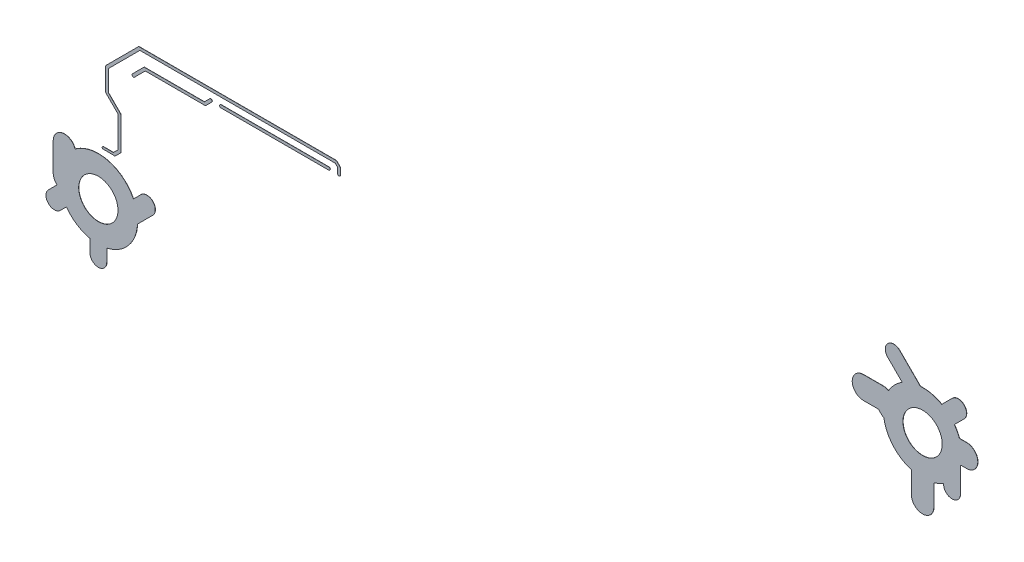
ISO-10303-21;
HEADER;
FILE_DESCRIPTION(('STEP AP214'),'2;1');
FILE_NAME('part.step','',(''),(''),'','','');
FILE_SCHEMA(('AUTOMOTIVE_DESIGN { 1 0 10303 214 1 1 1 1 }'));
ENDSEC;
DATA;
#1=APPLICATION_CONTEXT('core data for automotive mechanical design processes');
#2=APPLICATION_PROTOCOL_DEFINITION('international standard','automotive_design',2000,#1);
#3=PRODUCT_CONTEXT('',#1,'mechanical');
#4=PRODUCT('Part','Part','',(#3));
#5=PRODUCT_RELATED_PRODUCT_CATEGORY('part','',(#4));
#6=PRODUCT_DEFINITION_FORMATION('','',#4);
#7=PRODUCT_DEFINITION_CONTEXT('part definition',#1,'design');
#8=PRODUCT_DEFINITION('design','',#6,#7);
#9=PRODUCT_DEFINITION_SHAPE('','',#8);
#10=(LENGTH_UNIT() NAMED_UNIT(*) SI_UNIT(.MILLI.,.METRE.));
#11=(NAMED_UNIT(*) PLANE_ANGLE_UNIT() SI_UNIT($,.RADIAN.));
#12=(NAMED_UNIT(*) SI_UNIT($,.STERADIAN.) SOLID_ANGLE_UNIT());
#13=UNCERTAINTY_MEASURE_WITH_UNIT(LENGTH_MEASURE(1.E-05),#10,'distance_accuracy_value','');
#14=(GEOMETRIC_REPRESENTATION_CONTEXT(3) GLOBAL_UNCERTAINTY_ASSIGNED_CONTEXT((#13)) GLOBAL_UNIT_ASSIGNED_CONTEXT((#10,
#11,#12)) REPRESENTATION_CONTEXT('',''));
#15=CARTESIAN_POINT('',(0.,0.,0.));
#16=DIRECTION('',(0.,0.,1.));
#17=DIRECTION('',(1.,0.,0.));
#18=AXIS2_PLACEMENT_3D('',#15,#16,#17);
#19=CARTESIAN_POINT('',(0.,0.,1.545));
#20=DIRECTION('',(0.,0.,1.));
#21=DIRECTION('',(1.,0.,0.));
#22=AXIS2_PLACEMENT_3D('',#19,#20,#21);
#23=PLANE('',#22);
#24=CARTESIAN_POINT('',(102.94,-116.,1.545));
#25=DIRECTION('',(0.,0.,1.));
#26=DIRECTION('',(1.,0.,0.));
#27=AXIS2_PLACEMENT_3D('',#24,#25,#26);
#28=CIRCLE('',#27,3.50422);
#29=CARTESIAN_POINT('',(106.44422,-116.,1.545));
#30=VERTEX_POINT('',#29);
#31=EDGE_CURVE('P0_E28',#30,#30,#28,.T.);
#32=ORIENTED_EDGE('',*,*,#31,.F.);
#33=EDGE_LOOP('',(#32));
#34=FACE_BOUND('',#33,.T.);
#35=DIRECTION('',(0.372676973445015,-0.927961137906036,0.));
#36=VECTOR('',#35,1.);
#37=CARTESIAN_POINT('',(98.682745,-110.104423,1.545));
#38=LINE('',#37,#36);
#39=CARTESIAN_POINT('',(98.682745,-110.104423,1.545));
#40=VERTEX_POINT('',#39);
#41=CARTESIAN_POINT('',(98.788966,-110.368912,1.545));
#42=VERTEX_POINT('',#41);
#43=EDGE_CURVE('P0_E112',#40,#42,#38,.T.);
#44=ORIENTED_EDGE('',*,*,#43,.F.);
#45=CARTESIAN_POINT('',(96.888999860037,-110.9890007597,1.545));
#46=DIRECTION('',(0.,0.,-1.));
#47=DIRECTION('',(-0.999999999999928,3.79863619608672E-07,0.));
#48=AXIS2_PLACEMENT_3D('',#45,#46,#47);
#49=CIRCLE('',#48,1.999999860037);
#50=CARTESIAN_POINT('',(94.889,-110.989,1.545));
#51=VERTEX_POINT('',#50);
#52=EDGE_CURVE('P0_E124',#51,#40,#49,.T.);
#53=ORIENTED_EDGE('',*,*,#52,.F.);
#54=DIRECTION('',(0.,1.,0.));
#55=VECTOR('',#54,1.);
#56=CARTESIAN_POINT('',(94.889,-116.,1.545));
#57=LINE('',#56,#55);
#58=CARTESIAN_POINT('',(94.889,-116.,1.545));
#59=VERTEX_POINT('',#58);
#60=EDGE_CURVE('P0_E232',#59,#51,#57,.T.);
#61=ORIENTED_EDGE('',*,*,#60,.F.);
#62=DIRECTION('',(-0.0327179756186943,0.999464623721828,0.));
#63=VECTOR('',#62,1.);
#64=CARTESIAN_POINT('',(94.893282,-116.130806,1.545));
#65=LINE('',#64,#63);
#66=CARTESIAN_POINT('',(94.893282,-116.130806,1.545));
#67=VERTEX_POINT('',#66);
#68=EDGE_CURVE('P0_E405',#67,#59,#65,.T.);
#69=ORIENTED_EDGE('',*,*,#68,.F.);
#70=DIRECTION('',(-0.130524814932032,0.991445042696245,0.));
#71=VECTOR('',#70,1.);
#72=CARTESIAN_POINT('',(94.927429,-116.390181,1.545));
#73=LINE('',#72,#71);
#74=CARTESIAN_POINT('',(94.927429,-116.390181,1.545));
#75=VERTEX_POINT('',#74);
#76=EDGE_CURVE('P0_E393',#75,#67,#73,.T.);
#77=ORIENTED_EDGE('',*,*,#76,.F.);
#78=DIRECTION('',(-0.258821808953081,0.965925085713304,0.));
#79=VECTOR('',#78,1.);
#80=CARTESIAN_POINT('',(94.99514,-116.642879,1.545));
#81=LINE('',#80,#79);
#82=CARTESIAN_POINT('',(94.99514,-116.642879,1.545));
#83=VERTEX_POINT('',#82);
#84=EDGE_CURVE('P0_E257',#83,#75,#81,.T.);
#85=ORIENTED_EDGE('',*,*,#84,.F.);
#86=CARTESIAN_POINT('',(96.886184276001,-116.0013876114,1.545));
#87=DIRECTION('',(0.,0.,-1.));
#88=DIRECTION('',(-0.657634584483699,-0.753337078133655,0.));
#89=AXIS2_PLACEMENT_3D('',#86,#87,#88);
#90=CIRCLE('',#89,1.996887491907);
#91=CARTESIAN_POINT('',(95.572962,-117.505717,1.545));
#92=VERTEX_POINT('',#91);
#93=EDGE_CURVE('P0_E285',#92,#83,#90,.T.);
#94=ORIENTED_EDGE('',*,*,#93,.F.);
#95=DIRECTION('',(0.70710655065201,0.70710701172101,0.));
#96=VECTOR('',#95,1.);
#97=CARTESIAN_POINT('',(94.03934,-119.03934,1.545));
#98=LINE('',#97,#96);
#99=CARTESIAN_POINT('',(94.03934,-119.03934,1.545));
#100=VERTEX_POINT('',#99);
#101=EDGE_CURVE('P0_E373',#100,#92,#98,.T.);
#102=ORIENTED_EDGE('',*,*,#101,.F.);
#103=CARTESIAN_POINT('',(95.099999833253,-120.1000001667,1.545));
#104=DIRECTION('',(0.,0.,-1.));
#105=DIRECTION('',(0.707106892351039,-0.707106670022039,0.));
#106=AXIS2_PLACEMENT_3D('',#103,#104,#105);
#107=CIRCLE('',#106,1.499999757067);
#108=CARTESIAN_POINT('',(96.16066,-121.16066,1.545));
#109=VERTEX_POINT('',#108);
#110=EDGE_CURVE('P0_E328',#109,#100,#107,.T.);
#111=ORIENTED_EDGE('',*,*,#110,.F.);
#112=DIRECTION('',(-0.707106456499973,-0.707107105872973,0.));
#113=VECTOR('',#112,1.);
#114=CARTESIAN_POINT('',(97.249565,-120.071754,1.545));
#115=LINE('',#114,#113);
#116=CARTESIAN_POINT('',(97.249565,-120.071754,1.545));
#117=VERTEX_POINT('',#116);
#118=EDGE_CURVE('P0_E349',#117,#109,#115,.T.);
#119=ORIENTED_EDGE('',*,*,#118,.F.);
#120=DIRECTION('',(-0.599276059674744,0.800542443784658,0.));
#121=VECTOR('',#120,1.);
#122=CARTESIAN_POINT('',(97.489509,-120.392283,1.545));
#123=LINE('',#122,#121);
#124=CARTESIAN_POINT('',(97.489509,-120.392283,1.545));
#125=VERTEX_POINT('',#124);
#126=EDGE_CURVE('P0_E337',#125,#117,#123,.T.);
#127=ORIENTED_EDGE('',*,*,#126,.F.);
#128=CARTESIAN_POINT('',(102.93999894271,-116.0000012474,1.545));
#129=DIRECTION('',(0.,0.,-1.));
#130=DIRECTION('',(-0.247306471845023,-0.968937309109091,0.));
#131=AXIS2_PLACEMENT_3D('',#128,#129,#130);
#132=CIRCLE('',#131,6.999998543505);
#133=CARTESIAN_POINT('',(101.208854,-122.782561,1.545));
#134=VERTEX_POINT('',#133);
#135=EDGE_CURVE('P0_E186',#134,#125,#132,.T.);
#136=ORIENTED_EDGE('',*,*,#135,.F.);
#137=DIRECTION('',(-0.977147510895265,0.212562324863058,0.));
#138=VECTOR('',#137,1.);
#139=CARTESIAN_POINT('',(101.44,-122.832843,1.545));
#140=LINE('',#139,#138);
#141=CARTESIAN_POINT('',(101.44,-122.832843,1.545));
#142=VERTEX_POINT('',#141);
#143=EDGE_CURVE('P0_E206',#142,#134,#140,.T.);
#144=ORIENTED_EDGE('',*,*,#143,.F.);
#145=DIRECTION('',(0.,1.,0.));
#146=VECTOR('',#145,1.);
#147=CARTESIAN_POINT('',(101.44,-125.06,1.545));
#148=LINE('',#147,#146);
#149=CARTESIAN_POINT('',(101.44,-125.06,1.545));
#150=VERTEX_POINT('',#149);
#151=EDGE_CURVE('P0_E278',#150,#142,#148,.T.);
#152=ORIENTED_EDGE('',*,*,#151,.F.);
#153=CARTESIAN_POINT('',(102.94,-125.0600000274,1.545));
#154=DIRECTION('',(0.,0.,-1.));
#155=DIRECTION('',(1.,1.830018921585E-08,0.));
#156=AXIS2_PLACEMENT_3D('',#153,#154,#155);
#157=CIRCLE('',#156,1.5);
#158=CARTESIAN_POINT('',(104.44,-125.06,1.545));
#159=VERTEX_POINT('',#158);
#160=EDGE_CURVE('P0_E168',#159,#150,#157,.T.);
#161=ORIENTED_EDGE('',*,*,#160,.F.);
#162=DIRECTION('',(0.,-1.,0.));
#163=VECTOR('',#162,1.);
#164=CARTESIAN_POINT('',(104.44,-122.832843,1.545));
#165=LINE('',#164,#163);
#166=CARTESIAN_POINT('',(104.44,-122.832843,1.545));
#167=VERTEX_POINT('',#166);
#168=EDGE_CURVE('P0_E297',#167,#159,#165,.T.);
#169=ORIENTED_EDGE('',*,*,#168,.F.);
#170=DIRECTION('',(-0.977147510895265,-0.212562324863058,0.));
#171=VECTOR('',#170,1.);
#172=CARTESIAN_POINT('',(104.671146,-122.782561,1.545));
#173=LINE('',#172,#171);
#174=CARTESIAN_POINT('',(104.671146,-122.782561,1.545));
#175=VERTEX_POINT('',#174);
#176=EDGE_CURVE('P0_E245',#175,#167,#173,.T.);
#177=ORIENTED_EDGE('',*,*,#176,.F.);
#178=CARTESIAN_POINT('',(102.94000076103,-116.0000007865,1.545));
#179=DIRECTION('',(0.,0.,-1.));
#180=DIRECTION('',(0.994270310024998,-0.1068950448,0.));
#181=AXIS2_PLACEMENT_3D('',#178,#179,#180);
#182=CIRCLE('',#181,6.99999906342);
#183=CARTESIAN_POINT('',(109.899892,-116.748266,1.545));
#184=VERTEX_POINT('',#183);
#185=EDGE_CURVE('P0_E266',#184,#175,#182,.T.);
#186=ORIENTED_EDGE('',*,*,#185,.F.);
#187=DIRECTION('',(-0.0713392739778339,-0.997452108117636,0.));
#188=VECTOR('',#187,1.);
#189=CARTESIAN_POINT('',(109.925839,-116.38548,1.545));
#190=LINE('',#189,#188);
#191=CARTESIAN_POINT('',(109.925839,-116.38548,1.545));
#192=VERTEX_POINT('',#191);
#193=EDGE_CURVE('P0_E212',#192,#184,#190,.T.);
#194=ORIENTED_EDGE('',*,*,#193,.F.);
#195=DIRECTION('',(-0.707106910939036,-0.707106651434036,0.));
#196=VECTOR('',#195,1.);
#197=CARTESIAN_POINT('',(112.65066,-113.66066,1.545));
#198=LINE('',#197,#196);
#199=CARTESIAN_POINT('',(112.65066,-113.66066,1.545));
#200=VERTEX_POINT('',#199);
#201=EDGE_CURVE('P0_E165',#200,#192,#198,.T.);
#202=ORIENTED_EDGE('',*,*,#201,.F.);
#203=CARTESIAN_POINT('',(111.59000016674,-112.5999998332,1.545));
#204=DIRECTION('',(0.,0.,-1.));
#205=DIRECTION('',(-0.707106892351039,0.707106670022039,0.));
#206=AXIS2_PLACEMENT_3D('',#203,#204,#205);
#207=CIRCLE('',#206,1.499999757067);
#208=CARTESIAN_POINT('',(110.52934,-111.53934,1.545));
#209=VERTEX_POINT('',#208);
#210=EDGE_CURVE('P0_E221',#209,#200,#207,.T.);
#211=ORIENTED_EDGE('',*,*,#210,.F.);
#212=DIRECTION('',(0.707107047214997,0.707106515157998,0.));
#213=VECTOR('',#212,1.);
#214=CARTESIAN_POINT('',(109.200336,-112.868343,1.545));
#215=LINE('',#214,#213);
#216=CARTESIAN_POINT('',(109.200336,-112.868343,1.545));
#217=VERTEX_POINT('',#216);
#218=EDGE_CURVE('P0_E179',#217,#209,#215,.T.);
#219=ORIENTED_EDGE('',*,*,#218,.F.);
#220=CARTESIAN_POINT('',(102.93998209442,-115.999896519,1.545));
#221=DIRECTION('',(0.,0.,-1.));
#222=DIRECTION('',(-0.570327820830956,0.821417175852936,0.));
#223=AXIS2_PLACEMENT_3D('',#220,#221,#222);
#224=CIRCLE('',#223,6.999904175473);
#225=CARTESIAN_POINT('',(98.947742,-110.250055,1.545));
#226=VERTEX_POINT('',#225);
#227=EDGE_CURVE('P0_E148',#226,#217,#224,.T.);
#228=ORIENTED_EDGE('',*,*,#227,.F.);
#229=DIRECTION('',(0.800544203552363,0.599273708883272,0.));
#230=VECTOR('',#229,1.);
#231=CARTESIAN_POINT('',(98.788966,-110.368912,1.545));
#232=LINE('',#231,#230);
#233=EDGE_CURVE('P0_E145',#42,#226,#232,.T.);
#234=ORIENTED_EDGE('',*,*,#233,.F.);
#235=EDGE_LOOP('',(#44,#53,#61,#69,#77,#85,#94,#102,#111,#119,#127,#136,#144,#152,#161,#169,
#177,#186,#194,#202,#211,#219,#228,#234));
#236=FACE_BOUND('',#235,.T.);
#237=ADVANCED_FACE('P0_F17',(#34,#236),#23,.T.);
#238=CARTESIAN_POINT('',(0.,0.,1.51));
#239=DIRECTION('',(0.,0.,1.));
#240=DIRECTION('',(1.,0.,0.));
#241=AXIS2_PLACEMENT_3D('',#238,#239,#240);
#242=PLANE('',#241);
#243=CARTESIAN_POINT('',(102.94,-116.,1.51));
#244=DIRECTION('',(0.,0.,1.));
#245=DIRECTION('',(1.,0.,0.));
#246=AXIS2_PLACEMENT_3D('',#243,#244,#245);
#247=CIRCLE('',#246,3.50422);
#248=CARTESIAN_POINT('',(106.44422,-116.,1.51));
#249=VERTEX_POINT('',#248);
#250=EDGE_CURVE('P0_E11',#249,#249,#247,.T.);
#251=ORIENTED_EDGE('',*,*,#250,.T.);
#252=EDGE_LOOP('',(#251));
#253=FACE_BOUND('',#252,.T.);
#254=DIRECTION('',(0.800544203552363,0.599273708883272,0.));
#255=VECTOR('',#254,1.);
#256=CARTESIAN_POINT('',(98.788966,-110.368912,1.51));
#257=LINE('',#256,#255);
#258=CARTESIAN_POINT('',(98.788966,-110.368912,1.51));
#259=VERTEX_POINT('',#258);
#260=CARTESIAN_POINT('',(98.947742,-110.250055,1.51));
#261=VERTEX_POINT('',#260);
#262=EDGE_CURVE('P0_E156',#259,#261,#257,.T.);
#263=ORIENTED_EDGE('',*,*,#262,.T.);
#264=CARTESIAN_POINT('',(102.93998209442,-115.999896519,1.51));
#265=DIRECTION('',(0.,0.,-1.));
#266=DIRECTION('',(-0.570327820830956,0.821417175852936,0.));
#267=AXIS2_PLACEMENT_3D('',#264,#265,#266);
#268=CIRCLE('',#267,6.999904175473);
#269=CARTESIAN_POINT('',(109.200336,-112.868343,1.51));
#270=VERTEX_POINT('',#269);
#271=EDGE_CURVE('P0_E178',#261,#270,#268,.T.);
#272=ORIENTED_EDGE('',*,*,#271,.T.);
#273=DIRECTION('',(0.707107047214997,0.707106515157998,0.));
#274=VECTOR('',#273,1.);
#275=CARTESIAN_POINT('',(109.200336,-112.868343,1.51));
#276=LINE('',#275,#274);
#277=CARTESIAN_POINT('',(110.52934,-111.53934,1.51));
#278=VERTEX_POINT('',#277);
#279=EDGE_CURVE('P0_E217',#270,#278,#276,.T.);
#280=ORIENTED_EDGE('',*,*,#279,.T.);
#281=CARTESIAN_POINT('',(111.59000016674,-112.5999998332,1.51));
#282=DIRECTION('',(0.,0.,-1.));
#283=DIRECTION('',(-0.707106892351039,0.707106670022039,0.));
#284=AXIS2_PLACEMENT_3D('',#281,#282,#283);
#285=CIRCLE('',#284,1.499999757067);
#286=CARTESIAN_POINT('',(112.65066,-113.66066,1.51));
#287=VERTEX_POINT('',#286);
#288=EDGE_CURVE('P0_E162',#278,#287,#285,.T.);
#289=ORIENTED_EDGE('',*,*,#288,.T.);
#290=DIRECTION('',(-0.707106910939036,-0.707106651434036,0.));
#291=VECTOR('',#290,1.);
#292=CARTESIAN_POINT('',(112.65066,-113.66066,1.51));
#293=LINE('',#292,#291);
#294=CARTESIAN_POINT('',(109.925839,-116.38548,1.51));
#295=VERTEX_POINT('',#294);
#296=EDGE_CURVE('P0_E208',#287,#295,#293,.T.);
#297=ORIENTED_EDGE('',*,*,#296,.T.);
#298=DIRECTION('',(-0.0713392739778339,-0.997452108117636,0.));
#299=VECTOR('',#298,1.);
#300=CARTESIAN_POINT('',(109.925839,-116.38548,1.51));
#301=LINE('',#300,#299);
#302=CARTESIAN_POINT('',(109.899892,-116.748266,1.51));
#303=VERTEX_POINT('',#302);
#304=EDGE_CURVE('P0_E262',#295,#303,#301,.T.);
#305=ORIENTED_EDGE('',*,*,#304,.T.);
#306=CARTESIAN_POINT('',(102.94000076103,-116.0000007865,1.51));
#307=DIRECTION('',(0.,0.,-1.));
#308=DIRECTION('',(0.994270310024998,-0.1068950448,0.));
#309=AXIS2_PLACEMENT_3D('',#306,#307,#308);
#310=CIRCLE('',#309,6.99999906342);
#311=CARTESIAN_POINT('',(104.671146,-122.782561,1.51));
#312=VERTEX_POINT('',#311);
#313=EDGE_CURVE('P0_E274',#303,#312,#310,.T.);
#314=ORIENTED_EDGE('',*,*,#313,.T.);
#315=DIRECTION('',(-0.977147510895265,-0.212562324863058,0.));
#316=VECTOR('',#315,1.);
#317=CARTESIAN_POINT('',(104.671146,-122.782561,1.51));
#318=LINE('',#317,#316);
#319=CARTESIAN_POINT('',(104.44,-122.832843,1.51));
#320=VERTEX_POINT('',#319);
#321=EDGE_CURVE('P0_E244',#312,#320,#318,.T.);
#322=ORIENTED_EDGE('',*,*,#321,.T.);
#323=DIRECTION('',(0.,-1.,0.));
#324=VECTOR('',#323,1.);
#325=CARTESIAN_POINT('',(104.44,-122.832843,1.51));
#326=LINE('',#325,#324);
#327=CARTESIAN_POINT('',(104.44,-125.06,1.51));
#328=VERTEX_POINT('',#327);
#329=EDGE_CURVE('P0_E173',#320,#328,#326,.T.);
#330=ORIENTED_EDGE('',*,*,#329,.T.);
#331=CARTESIAN_POINT('',(102.94,-125.0600000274,1.51));
#332=DIRECTION('',(0.,0.,-1.));
#333=DIRECTION('',(1.,1.830018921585E-08,0.));
#334=AXIS2_PLACEMENT_3D('',#331,#332,#333);
#335=CIRCLE('',#334,1.5);
#336=CARTESIAN_POINT('',(101.44,-125.06,1.51));
#337=VERTEX_POINT('',#336);
#338=EDGE_CURVE('P0_E307',#328,#337,#335,.T.);
#339=ORIENTED_EDGE('',*,*,#338,.T.);
#340=DIRECTION('',(0.,1.,0.));
#341=VECTOR('',#340,1.);
#342=CARTESIAN_POINT('',(101.44,-125.06,1.51));
#343=LINE('',#342,#341);
#344=CARTESIAN_POINT('',(101.44,-122.832843,1.51));
#345=VERTEX_POINT('',#344);
#346=EDGE_CURVE('P0_E202',#337,#345,#343,.T.);
#347=ORIENTED_EDGE('',*,*,#346,.T.);
#348=DIRECTION('',(-0.977147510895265,0.212562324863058,0.));
#349=VECTOR('',#348,1.);
#350=CARTESIAN_POINT('',(101.44,-122.832843,1.51));
#351=LINE('',#350,#349);
#352=CARTESIAN_POINT('',(101.208854,-122.782561,1.51));
#353=VERTEX_POINT('',#352);
#354=EDGE_CURVE('P0_E191',#345,#353,#351,.T.);
#355=ORIENTED_EDGE('',*,*,#354,.T.);
#356=CARTESIAN_POINT('',(102.93999894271,-116.0000012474,1.51));
#357=DIRECTION('',(0.,0.,-1.));
#358=DIRECTION('',(-0.247306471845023,-0.968937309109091,0.));
#359=AXIS2_PLACEMENT_3D('',#356,#357,#358);
#360=CIRCLE('',#359,6.999998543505);
#361=CARTESIAN_POINT('',(97.489509,-120.392283,1.51));
#362=VERTEX_POINT('',#361);
#363=EDGE_CURVE('P0_E327',#353,#362,#360,.T.);
#364=ORIENTED_EDGE('',*,*,#363,.T.);
#365=DIRECTION('',(-0.599276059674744,0.800542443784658,0.));
#366=VECTOR('',#365,1.);
#367=CARTESIAN_POINT('',(97.489509,-120.392283,1.51));
#368=LINE('',#367,#366);
#369=CARTESIAN_POINT('',(97.249565,-120.071754,1.51));
#370=VERTEX_POINT('',#369);
#371=EDGE_CURVE('P0_E345',#362,#370,#368,.T.);
#372=ORIENTED_EDGE('',*,*,#371,.T.);
#373=DIRECTION('',(-0.707106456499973,-0.707107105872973,0.));
#374=VECTOR('',#373,1.);
#375=CARTESIAN_POINT('',(97.249565,-120.071754,1.51));
#376=LINE('',#375,#374);
#377=CARTESIAN_POINT('',(96.16066,-121.16066,1.51));
#378=VERTEX_POINT('',#377);
#379=EDGE_CURVE('P0_E333',#370,#378,#376,.T.);
#380=ORIENTED_EDGE('',*,*,#379,.T.);
#381=CARTESIAN_POINT('',(95.099999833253,-120.1000001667,1.51));
#382=DIRECTION('',(0.,0.,-1.));
#383=DIRECTION('',(0.707106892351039,-0.707106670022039,0.));
#384=AXIS2_PLACEMENT_3D('',#381,#382,#383);
#385=CIRCLE('',#384,1.499999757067);
#386=CARTESIAN_POINT('',(94.03934,-119.03934,1.51));
#387=VERTEX_POINT('',#386);
#388=EDGE_CURVE('P0_E369',#378,#387,#385,.T.);
#389=ORIENTED_EDGE('',*,*,#388,.T.);
#390=DIRECTION('',(0.70710655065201,0.70710701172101,0.));
#391=VECTOR('',#390,1.);
#392=CARTESIAN_POINT('',(94.03934,-119.03934,1.51));
#393=LINE('',#392,#391);
#394=CARTESIAN_POINT('',(95.572962,-117.505717,1.51));
#395=VERTEX_POINT('',#394);
#396=EDGE_CURVE('P0_E286',#387,#395,#393,.T.);
#397=ORIENTED_EDGE('',*,*,#396,.T.);
#398=CARTESIAN_POINT('',(96.886184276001,-116.0013876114,1.51));
#399=DIRECTION('',(0.,0.,-1.));
#400=DIRECTION('',(-0.657634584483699,-0.753337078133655,0.));
#401=AXIS2_PLACEMENT_3D('',#398,#399,#400);
#402=CIRCLE('',#401,1.996887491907);
#403=CARTESIAN_POINT('',(94.99514,-116.642879,1.51));
#404=VERTEX_POINT('',#403);
#405=EDGE_CURVE('P0_E253',#395,#404,#402,.T.);
#406=ORIENTED_EDGE('',*,*,#405,.T.);
#407=DIRECTION('',(-0.258821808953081,0.965925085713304,0.));
#408=VECTOR('',#407,1.);
#409=CARTESIAN_POINT('',(94.99514,-116.642879,1.51));
#410=LINE('',#409,#408);
#411=CARTESIAN_POINT('',(94.927429,-116.390181,1.51));
#412=VERTEX_POINT('',#411);
#413=EDGE_CURVE('P0_E389',#404,#412,#410,.T.);
#414=ORIENTED_EDGE('',*,*,#413,.T.);
#415=DIRECTION('',(-0.130524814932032,0.991445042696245,0.));
#416=VECTOR('',#415,1.);
#417=CARTESIAN_POINT('',(94.927429,-116.390181,1.51));
#418=LINE('',#417,#416);
#419=CARTESIAN_POINT('',(94.893282,-116.130806,1.51));
#420=VERTEX_POINT('',#419);
#421=EDGE_CURVE('P0_E401',#412,#420,#418,.T.);
#422=ORIENTED_EDGE('',*,*,#421,.T.);
#423=DIRECTION('',(-0.0327179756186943,0.999464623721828,0.));
#424=VECTOR('',#423,1.);
#425=CARTESIAN_POINT('',(94.893282,-116.130806,1.51));
#426=LINE('',#425,#424);
#427=CARTESIAN_POINT('',(94.889,-116.,1.51));
#428=VERTEX_POINT('',#427);
#429=EDGE_CURVE('P0_E236',#420,#428,#426,.T.);
#430=ORIENTED_EDGE('',*,*,#429,.T.);
#431=DIRECTION('',(0.,1.,0.));
#432=VECTOR('',#431,1.);
#433=CARTESIAN_POINT('',(94.889,-116.,1.51));
#434=LINE('',#433,#432);
#435=CARTESIAN_POINT('',(94.889,-110.989,1.51));
#436=VERTEX_POINT('',#435);
#437=EDGE_CURVE('P0_E117',#428,#436,#434,.T.);
#438=ORIENTED_EDGE('',*,*,#437,.T.);
#439=CARTESIAN_POINT('',(96.888999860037,-110.9890007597,1.51));
#440=DIRECTION('',(0.,0.,-1.));
#441=DIRECTION('',(-0.999999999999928,3.79863619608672E-07,0.));
#442=AXIS2_PLACEMENT_3D('',#439,#440,#441);
#443=CIRCLE('',#442,1.999999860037);
#444=CARTESIAN_POINT('',(98.682745,-110.104423,1.51));
#445=VERTEX_POINT('',#444);
#446=EDGE_CURVE('P0_E114',#436,#445,#443,.T.);
#447=ORIENTED_EDGE('',*,*,#446,.T.);
#448=DIRECTION('',(0.372676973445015,-0.927961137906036,0.));
#449=VECTOR('',#448,1.);
#450=CARTESIAN_POINT('',(98.682745,-110.104423,1.51));
#451=LINE('',#450,#449);
#452=EDGE_CURVE('P0_E98',#445,#259,#451,.T.);
#453=ORIENTED_EDGE('',*,*,#452,.T.);
#454=EDGE_LOOP('',(#263,#272,#280,#289,#297,#305,#314,#322,#330,#339,#347,#355,#364,#372,#380,
#389,#397,#406,#414,#422,#430,#438,#447,#453));
#455=FACE_BOUND('',#454,.T.);
#456=ADVANCED_FACE('P0_F19',(#253,#455),#242,.F.);
#457=CARTESIAN_POINT('',(102.94,-116.,1.51));
#458=DIRECTION('',(0.,0.,-1.));
#459=DIRECTION('',(1.,0.,0.));
#460=AXIS2_PLACEMENT_3D('',#457,#458,#459);
#461=CYLINDRICAL_SURFACE('',#460,3.50422);
#462=DIRECTION('',(0.,0.,1.));
#463=VECTOR('',#462,1.);
#464=CARTESIAN_POINT('',(106.44422,-116.,1.51));
#465=LINE('',#464,#463);
#466=EDGE_CURVE('P0_E21',#249,#30,#465,.T.);
#467=ORIENTED_EDGE('',*,*,#466,.T.);
#468=ORIENTED_EDGE('',*,*,#31,.T.);
#469=ORIENTED_EDGE('',*,*,#466,.F.);
#470=ORIENTED_EDGE('',*,*,#250,.F.);
#471=EDGE_LOOP('',(#467,#468,#469,#470));
#472=FACE_BOUND('',#471,.T.);
#473=ADVANCED_FACE('P0_F629',(#472),#461,.F.);
#474=CARTESIAN_POINT('',(98.682745,-110.104423,1.51));
#475=DIRECTION('',(0.927961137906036,0.372676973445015,0.));
#476=DIRECTION('',(0.,0.,-1.));
#477=AXIS2_PLACEMENT_3D('',#474,#475,#476);
#478=PLANE('',#477);
#479=DIRECTION('',(0.,0.,1.));
#480=VECTOR('',#479,1.);
#481=CARTESIAN_POINT('',(98.682745,-110.104423,1.51));
#482=LINE('',#481,#480);
#483=EDGE_CURVE('P0_E103',#445,#40,#482,.T.);
#484=ORIENTED_EDGE('',*,*,#483,.T.);
#485=ORIENTED_EDGE('',*,*,#43,.T.);
#486=DIRECTION('',(0.,0.,1.));
#487=VECTOR('',#486,1.);
#488=CARTESIAN_POINT('',(98.788966,-110.368912,1.51));
#489=LINE('',#488,#487);
#490=EDGE_CURVE('P0_E107',#259,#42,#489,.T.);
#491=ORIENTED_EDGE('',*,*,#490,.F.);
#492=ORIENTED_EDGE('',*,*,#452,.F.);
#493=EDGE_LOOP('',(#484,#485,#491,#492));
#494=FACE_BOUND('',#493,.T.);
#495=ADVANCED_FACE('P0_F100',(#494),#478,.T.);
#496=CARTESIAN_POINT('',(96.888999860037,-110.9890007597,1.51));
#497=DIRECTION('',(0.,0.,-1.));
#498=DIRECTION('',(-0.999999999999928,3.79863619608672E-07,0.));
#499=AXIS2_PLACEMENT_3D('',#496,#497,#498);
#500=CYLINDRICAL_SURFACE('',#499,1.999999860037);
#501=DIRECTION('',(0.,0.,1.));
#502=VECTOR('',#501,1.);
#503=CARTESIAN_POINT('',(94.889,-110.989,1.51));
#504=LINE('',#503,#502);
#505=EDGE_CURVE('P0_E201',#436,#51,#504,.T.);
#506=ORIENTED_EDGE('',*,*,#505,.T.);
#507=ORIENTED_EDGE('',*,*,#52,.T.);
#508=ORIENTED_EDGE('',*,*,#483,.F.);
#509=ORIENTED_EDGE('',*,*,#446,.F.);
#510=EDGE_LOOP('',(#506,#507,#508,#509));
#511=FACE_BOUND('',#510,.T.);
#512=ADVANCED_FACE('P0_F123',(#511),#500,.T.);
#513=CARTESIAN_POINT('',(94.889,-116.,1.51));
#514=DIRECTION('',(-1.,0.,0.));
#515=DIRECTION('',(0.,0.,1.));
#516=AXIS2_PLACEMENT_3D('',#513,#514,#515);
#517=PLANE('',#516);
#518=DIRECTION('',(0.,0.,1.));
#519=VECTOR('',#518,1.);
#520=CARTESIAN_POINT('',(94.889,-116.,1.51));
#521=LINE('',#520,#519);
#522=EDGE_CURVE('P0_E352',#428,#59,#521,.T.);
#523=ORIENTED_EDGE('',*,*,#522,.T.);
#524=ORIENTED_EDGE('',*,*,#60,.T.);
#525=ORIENTED_EDGE('',*,*,#505,.F.);
#526=ORIENTED_EDGE('',*,*,#437,.F.);
#527=EDGE_LOOP('',(#523,#524,#525,#526));
#528=FACE_BOUND('',#527,.T.);
#529=ADVANCED_FACE('P0_F415',(#528),#517,.T.);
#530=CARTESIAN_POINT('',(94.893282,-116.130806,1.51));
#531=DIRECTION('',(-0.999464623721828,-0.0327179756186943,0.));
#532=DIRECTION('',(-0.0327179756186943,0.999464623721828,0.));
#533=AXIS2_PLACEMENT_3D('',#530,#531,#532);
#534=PLANE('',#533);
#535=DIRECTION('',(0.,0.,1.));
#536=VECTOR('',#535,1.);
#537=CARTESIAN_POINT('',(94.893282,-116.130806,1.51));
#538=LINE('',#537,#536);
#539=EDGE_CURVE('P0_E397',#420,#67,#538,.T.);
#540=ORIENTED_EDGE('',*,*,#539,.T.);
#541=ORIENTED_EDGE('',*,*,#68,.T.);
#542=ORIENTED_EDGE('',*,*,#522,.F.);
#543=ORIENTED_EDGE('',*,*,#429,.F.);
#544=EDGE_LOOP('',(#540,#541,#542,#543));
#545=FACE_BOUND('',#544,.T.);
#546=ADVANCED_FACE('P0_F419',(#545),#534,.T.);
#547=CARTESIAN_POINT('',(94.927429,-116.390181,1.51));
#548=DIRECTION('',(-0.991445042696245,-0.130524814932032,0.));
#549=DIRECTION('',(-0.130524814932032,0.991445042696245,0.));
#550=AXIS2_PLACEMENT_3D('',#547,#548,#549);
#551=PLANE('',#550);
#552=DIRECTION('',(0.,0.,1.));
#553=VECTOR('',#552,1.);
#554=CARTESIAN_POINT('',(94.927429,-116.390181,1.51));
#555=LINE('',#554,#553);
#556=EDGE_CURVE('P0_E385',#412,#75,#555,.T.);
#557=ORIENTED_EDGE('',*,*,#556,.T.);
#558=ORIENTED_EDGE('',*,*,#76,.T.);
#559=ORIENTED_EDGE('',*,*,#539,.F.);
#560=ORIENTED_EDGE('',*,*,#421,.F.);
#561=EDGE_LOOP('',(#557,#558,#559,#560));
#562=FACE_BOUND('',#561,.T.);
#563=ADVANCED_FACE('P0_F421',(#562),#551,.T.);
#564=CARTESIAN_POINT('',(94.99514,-116.642879,1.51));
#565=DIRECTION('',(-0.965925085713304,-0.258821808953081,0.));
#566=DIRECTION('',(-0.258821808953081,0.965925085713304,0.));
#567=AXIS2_PLACEMENT_3D('',#564,#565,#566);
#568=PLANE('',#567);
#569=DIRECTION('',(0.,0.,1.));
#570=VECTOR('',#569,1.);
#571=CARTESIAN_POINT('',(94.99514,-116.642879,1.51));
#572=LINE('',#571,#570);
#573=EDGE_CURVE('P0_E258',#404,#83,#572,.T.);
#574=ORIENTED_EDGE('',*,*,#573,.T.);
#575=ORIENTED_EDGE('',*,*,#84,.T.);
#576=ORIENTED_EDGE('',*,*,#556,.F.);
#577=ORIENTED_EDGE('',*,*,#413,.F.);
#578=EDGE_LOOP('',(#574,#575,#576,#577));
#579=FACE_BOUND('',#578,.T.);
#580=ADVANCED_FACE('P0_F425',(#579),#568,.T.);
#581=CARTESIAN_POINT('',(96.886184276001,-116.0013876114,1.51));
#582=DIRECTION('',(0.,0.,-1.));
#583=DIRECTION('',(-0.657634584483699,-0.753337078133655,0.));
#584=AXIS2_PLACEMENT_3D('',#581,#582,#583);
#585=CYLINDRICAL_SURFACE('',#584,1.996887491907);
#586=DIRECTION('',(0.,0.,1.));
#587=VECTOR('',#586,1.);
#588=CARTESIAN_POINT('',(95.572962,-117.505717,1.51));
#589=LINE('',#588,#587);
#590=EDGE_CURVE('P0_E290',#395,#92,#589,.T.);
#591=ORIENTED_EDGE('',*,*,#590,.T.);
#592=ORIENTED_EDGE('',*,*,#93,.T.);
#593=ORIENTED_EDGE('',*,*,#573,.F.);
#594=ORIENTED_EDGE('',*,*,#405,.F.);
#595=EDGE_LOOP('',(#591,#592,#593,#594));
#596=FACE_BOUND('',#595,.T.);
#597=ADVANCED_FACE('P0_F432',(#596),#585,.T.);
#598=CARTESIAN_POINT('',(94.03934,-119.03934,1.51));
#599=DIRECTION('',(-0.70710701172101,0.70710655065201,0.));
#600=DIRECTION('',(0.,0.,1.));
#601=AXIS2_PLACEMENT_3D('',#598,#599,#600);
#602=PLANE('',#601);
#603=DIRECTION('',(0.,0.,1.));
#604=VECTOR('',#603,1.);
#605=CARTESIAN_POINT('',(94.03934,-119.03934,1.51));
#606=LINE('',#605,#604);
#607=EDGE_CURVE('P0_E332',#387,#100,#606,.T.);
#608=ORIENTED_EDGE('',*,*,#607,.T.);
#609=ORIENTED_EDGE('',*,*,#101,.T.);
#610=ORIENTED_EDGE('',*,*,#590,.F.);
#611=ORIENTED_EDGE('',*,*,#396,.F.);
#612=EDGE_LOOP('',(#608,#609,#610,#611));
#613=FACE_BOUND('',#612,.T.);
#614=ADVANCED_FACE('P0_F435',(#613),#602,.T.);
#615=CARTESIAN_POINT('',(95.099999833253,-120.1000001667,1.51));
#616=DIRECTION('',(0.,0.,-1.));
#617=DIRECTION('',(0.707106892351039,-0.707106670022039,0.));
#618=AXIS2_PLACEMENT_3D('',#615,#616,#617);
#619=CYLINDRICAL_SURFACE('',#618,1.499999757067);
#620=DIRECTION('',(0.,0.,1.));
#621=VECTOR('',#620,1.);
#622=CARTESIAN_POINT('',(96.16066,-121.16066,1.51));
#623=LINE('',#622,#621);
#624=EDGE_CURVE('P0_E356',#378,#109,#623,.T.);
#625=ORIENTED_EDGE('',*,*,#624,.T.);
#626=ORIENTED_EDGE('',*,*,#110,.T.);
#627=ORIENTED_EDGE('',*,*,#607,.F.);
#628=ORIENTED_EDGE('',*,*,#388,.F.);
#629=EDGE_LOOP('',(#625,#626,#627,#628));
#630=FACE_BOUND('',#629,.T.);
#631=ADVANCED_FACE('P0_F442',(#630),#619,.T.);
#632=CARTESIAN_POINT('',(97.249565,-120.071754,1.51));
#633=DIRECTION('',(0.707107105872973,-0.707106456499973,0.));
#634=DIRECTION('',(0.,0.,-1.));
#635=AXIS2_PLACEMENT_3D('',#632,#633,#634);
#636=PLANE('',#635);
#637=DIRECTION('',(0.,0.,1.));
#638=VECTOR('',#637,1.);
#639=CARTESIAN_POINT('',(97.249565,-120.071754,1.51));
#640=LINE('',#639,#638);
#641=EDGE_CURVE('P0_E341',#370,#117,#640,.T.);
#642=ORIENTED_EDGE('',*,*,#641,.T.);
#643=ORIENTED_EDGE('',*,*,#118,.T.);
#644=ORIENTED_EDGE('',*,*,#624,.F.);
#645=ORIENTED_EDGE('',*,*,#379,.F.);
#646=EDGE_LOOP('',(#642,#643,#644,#645));
#647=FACE_BOUND('',#646,.T.);
#648=ADVANCED_FACE('P0_F691',(#647),#636,.T.);
#649=CARTESIAN_POINT('',(97.489509,-120.392283,1.51));
#650=DIRECTION('',(-0.800542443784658,-0.599276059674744,0.));
#651=DIRECTION('',(-0.599276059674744,0.800542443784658,0.));
#652=AXIS2_PLACEMENT_3D('',#649,#650,#651);
#653=PLANE('',#652);
#654=DIRECTION('',(0.,0.,1.));
#655=VECTOR('',#654,1.);
#656=CARTESIAN_POINT('',(97.489509,-120.392283,1.51));
#657=LINE('',#656,#655);
#658=EDGE_CURVE('P0_E190',#362,#125,#657,.T.);
#659=ORIENTED_EDGE('',*,*,#658,.T.);
#660=ORIENTED_EDGE('',*,*,#126,.T.);
#661=ORIENTED_EDGE('',*,*,#641,.F.);
#662=ORIENTED_EDGE('',*,*,#371,.F.);
#663=EDGE_LOOP('',(#659,#660,#661,#662));
#664=FACE_BOUND('',#663,.T.);
#665=ADVANCED_FACE('P0_F540',(#664),#653,.T.);
#666=CARTESIAN_POINT('',(102.93999894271,-116.0000012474,1.51));
#667=DIRECTION('',(0.,0.,-1.));
#668=DIRECTION('',(-0.247306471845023,-0.968937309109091,0.));
#669=AXIS2_PLACEMENT_3D('',#666,#667,#668);
#670=CYLINDRICAL_SURFACE('',#669,6.999998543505);
#671=DIRECTION('',(0.,0.,1.));
#672=VECTOR('',#671,1.);
#673=CARTESIAN_POINT('',(101.208854,-122.782561,1.51));
#674=LINE('',#673,#672);
#675=EDGE_CURVE('P0_E317',#353,#134,#674,.T.);
#676=ORIENTED_EDGE('',*,*,#675,.T.);
#677=ORIENTED_EDGE('',*,*,#135,.T.);
#678=ORIENTED_EDGE('',*,*,#658,.F.);
#679=ORIENTED_EDGE('',*,*,#363,.F.);
#680=EDGE_LOOP('',(#676,#677,#678,#679));
#681=FACE_BOUND('',#680,.T.);
#682=ADVANCED_FACE('P0_F544',(#681),#670,.T.);
#683=CARTESIAN_POINT('',(101.44,-122.832843,1.51));
#684=DIRECTION('',(-0.212562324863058,-0.977147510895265,0.));
#685=DIRECTION('',(-0.977147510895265,0.212562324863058,0.));
#686=AXIS2_PLACEMENT_3D('',#683,#684,#685);
#687=PLANE('',#686);
#688=DIRECTION('',(0.,0.,1.));
#689=VECTOR('',#688,1.);
#690=CARTESIAN_POINT('',(101.44,-122.832843,1.51));
#691=LINE('',#690,#689);
#692=EDGE_CURVE('P0_E207',#345,#142,#691,.T.);
#693=ORIENTED_EDGE('',*,*,#692,.T.);
#694=ORIENTED_EDGE('',*,*,#143,.T.);
#695=ORIENTED_EDGE('',*,*,#675,.F.);
#696=ORIENTED_EDGE('',*,*,#354,.F.);
#697=EDGE_LOOP('',(#693,#694,#695,#696));
#698=FACE_BOUND('',#697,.T.);
#699=ADVANCED_FACE('P0_F547',(#698),#687,.T.);
#700=CARTESIAN_POINT('',(101.44,-125.06,1.51));
#701=DIRECTION('',(-1.,0.,0.));
#702=DIRECTION('',(0.,0.,1.));
#703=AXIS2_PLACEMENT_3D('',#700,#701,#702);
#704=PLANE('',#703);
#705=DIRECTION('',(0.,0.,1.));
#706=VECTOR('',#705,1.);
#707=CARTESIAN_POINT('',(101.44,-125.06,1.51));
#708=LINE('',#707,#706);
#709=EDGE_CURVE('P0_E172',#337,#150,#708,.T.);
#710=ORIENTED_EDGE('',*,*,#709,.T.);
#711=ORIENTED_EDGE('',*,*,#151,.T.);
#712=ORIENTED_EDGE('',*,*,#692,.F.);
#713=ORIENTED_EDGE('',*,*,#346,.F.);
#714=EDGE_LOOP('',(#710,#711,#712,#713));
#715=FACE_BOUND('',#714,.T.);
#716=ADVANCED_FACE('P0_F549',(#715),#704,.T.);
#717=CARTESIAN_POINT('',(102.94,-125.0600000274,1.51));
#718=DIRECTION('',(0.,0.,-1.));
#719=DIRECTION('',(1.,1.830018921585E-08,0.));
#720=AXIS2_PLACEMENT_3D('',#717,#718,#719);
#721=CYLINDRICAL_SURFACE('',#720,1.5);
#722=DIRECTION('',(0.,0.,1.));
#723=VECTOR('',#722,1.);
#724=CARTESIAN_POINT('',(104.44,-125.06,1.51));
#725=LINE('',#724,#723);
#726=EDGE_CURVE('P0_E228',#328,#159,#725,.T.);
#727=ORIENTED_EDGE('',*,*,#726,.T.);
#728=ORIENTED_EDGE('',*,*,#160,.T.);
#729=ORIENTED_EDGE('',*,*,#709,.F.);
#730=ORIENTED_EDGE('',*,*,#338,.F.);
#731=EDGE_LOOP('',(#727,#728,#729,#730));
#732=FACE_BOUND('',#731,.T.);
#733=ADVANCED_FACE('P0_F552',(#732),#721,.T.);
#734=CARTESIAN_POINT('',(104.44,-122.832843,1.51));
#735=DIRECTION('',(1.,0.,0.));
#736=DIRECTION('',(0.,1.,0.));
#737=AXIS2_PLACEMENT_3D('',#734,#735,#736);
#738=PLANE('',#737);
#739=DIRECTION('',(0.,0.,1.));
#740=VECTOR('',#739,1.);
#741=CARTESIAN_POINT('',(104.44,-122.832843,1.51));
#742=LINE('',#741,#740);
#743=EDGE_CURVE('P0_E240',#320,#167,#742,.T.);
#744=ORIENTED_EDGE('',*,*,#743,.T.);
#745=ORIENTED_EDGE('',*,*,#168,.T.);
#746=ORIENTED_EDGE('',*,*,#726,.F.);
#747=ORIENTED_EDGE('',*,*,#329,.F.);
#748=EDGE_LOOP('',(#744,#745,#746,#747));
#749=FACE_BOUND('',#748,.T.);
#750=ADVANCED_FACE('P0_F558',(#749),#738,.T.);
#751=CARTESIAN_POINT('',(104.671146,-122.782561,1.51));
#752=DIRECTION('',(0.212562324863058,-0.977147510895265,0.));
#753=DIRECTION('',(0.,0.,-1.));
#754=AXIS2_PLACEMENT_3D('',#751,#752,#753);
#755=PLANE('',#754);
#756=DIRECTION('',(0.,0.,1.));
#757=VECTOR('',#756,1.);
#758=CARTESIAN_POINT('',(104.671146,-122.782561,1.51));
#759=LINE('',#758,#757);
#760=EDGE_CURVE('P0_E270',#312,#175,#759,.T.);
#761=ORIENTED_EDGE('',*,*,#760,.T.);
#762=ORIENTED_EDGE('',*,*,#176,.T.);
#763=ORIENTED_EDGE('',*,*,#743,.F.);
#764=ORIENTED_EDGE('',*,*,#321,.F.);
#765=EDGE_LOOP('',(#761,#762,#763,#764));
#766=FACE_BOUND('',#765,.T.);
#767=ADVANCED_FACE('P0_F561',(#766),#755,.T.);
#768=CARTESIAN_POINT('',(102.94000076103,-116.0000007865,1.51));
#769=DIRECTION('',(0.,0.,-1.));
#770=DIRECTION('',(0.994270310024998,-0.1068950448,0.));
#771=AXIS2_PLACEMENT_3D('',#768,#769,#770);
#772=CYLINDRICAL_SURFACE('',#771,6.99999906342);
#773=DIRECTION('',(0.,0.,1.));
#774=VECTOR('',#773,1.);
#775=CARTESIAN_POINT('',(109.899892,-116.748266,1.51));
#776=LINE('',#775,#774);
#777=EDGE_CURVE('P0_E252',#303,#184,#776,.T.);
#778=ORIENTED_EDGE('',*,*,#777,.T.);
#779=ORIENTED_EDGE('',*,*,#185,.T.);
#780=ORIENTED_EDGE('',*,*,#760,.F.);
#781=ORIENTED_EDGE('',*,*,#313,.F.);
#782=EDGE_LOOP('',(#778,#779,#780,#781));
#783=FACE_BOUND('',#782,.T.);
#784=ADVANCED_FACE('P0_F566',(#783),#772,.T.);
#785=CARTESIAN_POINT('',(109.925839,-116.38548,1.51));
#786=DIRECTION('',(0.997452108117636,-0.0713392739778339,0.));
#787=DIRECTION('',(0.,0.,-1.));
#788=AXIS2_PLACEMENT_3D('',#785,#786,#787);
#789=PLANE('',#788);
#790=DIRECTION('',(0.,0.,1.));
#791=VECTOR('',#790,1.);
#792=CARTESIAN_POINT('',(109.925839,-116.38548,1.51));
#793=LINE('',#792,#791);
#794=EDGE_CURVE('P0_E213',#295,#192,#793,.T.);
#795=ORIENTED_EDGE('',*,*,#794,.T.);
#796=ORIENTED_EDGE('',*,*,#193,.T.);
#797=ORIENTED_EDGE('',*,*,#777,.F.);
#798=ORIENTED_EDGE('',*,*,#304,.F.);
#799=EDGE_LOOP('',(#795,#796,#797,#798));
#800=FACE_BOUND('',#799,.T.);
#801=ADVANCED_FACE('P0_F766',(#800),#789,.T.);
#802=CARTESIAN_POINT('',(112.65066,-113.66066,1.51));
#803=DIRECTION('',(0.707106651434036,-0.707106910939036,0.));
#804=DIRECTION('',(0.,0.,-1.));
#805=AXIS2_PLACEMENT_3D('',#802,#803,#804);
#806=PLANE('',#805);
#807=DIRECTION('',(0.,0.,1.));
#808=VECTOR('',#807,1.);
#809=CARTESIAN_POINT('',(112.65066,-113.66066,1.51));
#810=LINE('',#809,#808);
#811=EDGE_CURVE('P0_E166',#287,#200,#810,.T.);
#812=ORIENTED_EDGE('',*,*,#811,.T.);
#813=ORIENTED_EDGE('',*,*,#201,.T.);
#814=ORIENTED_EDGE('',*,*,#794,.F.);
#815=ORIENTED_EDGE('',*,*,#296,.F.);
#816=EDGE_LOOP('',(#812,#813,#814,#815));
#817=FACE_BOUND('',#816,.T.);
#818=ADVANCED_FACE('P0_F771',(#817),#806,.T.);
#819=CARTESIAN_POINT('',(111.59000016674,-112.5999998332,1.51));
#820=DIRECTION('',(0.,0.,-1.));
#821=DIRECTION('',(-0.707106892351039,0.707106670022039,0.));
#822=AXIS2_PLACEMENT_3D('',#819,#820,#821);
#823=CYLINDRICAL_SURFACE('',#822,1.499999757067);
#824=DIRECTION('',(0.,0.,1.));
#825=VECTOR('',#824,1.);
#826=CARTESIAN_POINT('',(110.52934,-111.53934,1.51));
#827=LINE('',#826,#825);
#828=EDGE_CURVE('P0_E183',#278,#209,#827,.T.);
#829=ORIENTED_EDGE('',*,*,#828,.T.);
#830=ORIENTED_EDGE('',*,*,#210,.T.);
#831=ORIENTED_EDGE('',*,*,#811,.F.);
#832=ORIENTED_EDGE('',*,*,#288,.F.);
#833=EDGE_LOOP('',(#829,#830,#831,#832));
#834=FACE_BOUND('',#833,.T.);
#835=ADVANCED_FACE('P0_F776',(#834),#823,.T.);
#836=CARTESIAN_POINT('',(109.200336,-112.868343,1.51));
#837=DIRECTION('',(-0.707106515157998,0.707107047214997,0.));
#838=DIRECTION('',(0.,0.,1.));
#839=AXIS2_PLACEMENT_3D('',#836,#837,#838);
#840=PLANE('',#839);
#841=DIRECTION('',(0.,0.,1.));
#842=VECTOR('',#841,1.);
#843=CARTESIAN_POINT('',(109.200336,-112.868343,1.51));
#844=LINE('',#843,#842);
#845=EDGE_CURVE('P0_E174',#270,#217,#844,.T.);
#846=ORIENTED_EDGE('',*,*,#845,.T.);
#847=ORIENTED_EDGE('',*,*,#218,.T.);
#848=ORIENTED_EDGE('',*,*,#828,.F.);
#849=ORIENTED_EDGE('',*,*,#279,.F.);
#850=EDGE_LOOP('',(#846,#847,#848,#849));
#851=FACE_BOUND('',#850,.T.);
#852=ADVANCED_FACE('P0_F785',(#851),#840,.T.);
#853=CARTESIAN_POINT('',(102.93998209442,-115.999896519,1.51));
#854=DIRECTION('',(0.,0.,-1.));
#855=DIRECTION('',(-0.570327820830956,0.821417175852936,0.));
#856=AXIS2_PLACEMENT_3D('',#853,#854,#855);
#857=CYLINDRICAL_SURFACE('',#856,6.999904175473);
#858=DIRECTION('',(0.,0.,1.));
#859=VECTOR('',#858,1.);
#860=CARTESIAN_POINT('',(98.947742,-110.250055,1.51));
#861=LINE('',#860,#859);
#862=EDGE_CURVE('P0_E153',#261,#226,#861,.T.);
#863=ORIENTED_EDGE('',*,*,#862,.T.);
#864=ORIENTED_EDGE('',*,*,#227,.T.);
#865=ORIENTED_EDGE('',*,*,#845,.F.);
#866=ORIENTED_EDGE('',*,*,#271,.F.);
#867=EDGE_LOOP('',(#863,#864,#865,#866));
#868=FACE_BOUND('',#867,.T.);
#869=ADVANCED_FACE('P0_F794',(#868),#857,.T.);
#870=CARTESIAN_POINT('',(98.788966,-110.368912,1.51));
#871=DIRECTION('',(-0.599273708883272,0.800544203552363,0.));
#872=DIRECTION('',(0.,0.,1.));
#873=AXIS2_PLACEMENT_3D('',#870,#871,#872);
#874=PLANE('',#873);
#875=ORIENTED_EDGE('',*,*,#490,.T.);
#876=ORIENTED_EDGE('',*,*,#233,.T.);
#877=ORIENTED_EDGE('',*,*,#862,.F.);
#878=ORIENTED_EDGE('',*,*,#262,.F.);
#879=EDGE_LOOP('',(#875,#876,#877,#878));
#880=FACE_BOUND('',#879,.T.);
#881=ADVANCED_FACE('P0_F155',(#880),#874,.T.);
#882=CLOSED_SHELL('',(#237,#456,#473,#495,#512,#529,#546,#563,#580,#597,#614,#631,#648,#665,
#682,#699,#716,#733,#750,#767,#784,#801,#818,#835,#852,#869,#881));
#883=MANIFOLD_SOLID_BREP('P0_B1',#882);
#884=CARTESIAN_POINT('',(0.,0.,1.545));
#885=DIRECTION('',(0.,0.,1.));
#886=DIRECTION('',(1.,0.,0.));
#887=AXIS2_PLACEMENT_3D('',#884,#885,#886);
#888=PLANE('',#887);
#889=DIRECTION('',(0.773014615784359,0.634388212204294,0.));
#890=VECTOR('',#889,1.);
#891=CARTESIAN_POINT('',(122.810723,-90.577224,1.545));
#892=LINE('',#891,#890);
#893=CARTESIAN_POINT('',(122.810723,-90.577224,1.545));
#894=VERTEX_POINT('',#893);
#895=CARTESIAN_POINT('',(122.848608,-90.546133,1.545));
#896=VERTEX_POINT('',#895);
#897=EDGE_CURVE('P1_E26',#894,#896,#892,.T.);
#898=ORIENTED_EDGE('',*,*,#897,.F.);
#899=DIRECTION('',(0.707107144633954,0.707106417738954,0.));
#900=VECTOR('',#899,1.);
#901=CARTESIAN_POINT('',(121.837946,-91.55,1.545));
#902=LINE('',#901,#900);
#903=CARTESIAN_POINT('',(121.837946,-91.55,1.545));
#904=VERTEX_POINT('',#903);
#905=EDGE_CURVE('P1_E245',#904,#894,#902,.T.);
#906=ORIENTED_EDGE('',*,*,#905,.F.);
#907=DIRECTION('',(1.,0.,0.));
#908=VECTOR('',#907,1.);
#909=CARTESIAN_POINT('',(111.2,-91.55,1.545));
#910=LINE('',#909,#908);
#911=CARTESIAN_POINT('',(111.2,-91.55,1.545));
#912=VERTEX_POINT('',#911);
#913=EDGE_CURVE('P1_E234',#912,#904,#910,.T.);
#914=ORIENTED_EDGE('',*,*,#913,.F.);
#915=CARTESIAN_POINT('',(111.20000227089,-91.8000069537,1.545));
#916=DIRECTION('',(0.,0.,-1.));
#917=DIRECTION('',(-0.707097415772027,0.707116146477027,0.));
#918=AXIS2_PLACEMENT_3D('',#915,#916,#917);
#919=CIRCLE('',#918,0.250006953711);
#920=CARTESIAN_POINT('',(111.023223,-91.623223,1.545));
#921=VERTEX_POINT('',#920);
#922=EDGE_CURVE('P1_E158',#921,#912,#919,.T.);
#923=ORIENTED_EDGE('',*,*,#922,.F.);
#924=DIRECTION('',(0.707106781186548,0.707106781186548,0.));
#925=VECTOR('',#924,1.);
#926=CARTESIAN_POINT('',(109.023223,-93.623223,1.545));
#927=LINE('',#926,#925);
#928=CARTESIAN_POINT('',(109.023223,-93.623223,1.545));
#929=VERTEX_POINT('',#928);
#930=EDGE_CURVE('P1_E216',#929,#921,#927,.T.);
#931=ORIENTED_EDGE('',*,*,#930,.F.);
#932=CARTESIAN_POINT('',(109.2000007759,-93.79999922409,1.545));
#933=DIRECTION('',(0.,0.,-1.));
#934=DIRECTION('',(0.707103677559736,-0.707109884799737,0.));
#935=AXIS2_PLACEMENT_3D('',#932,#933,#934);
#936=CIRCLE('',#935,0.250000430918);
#937=CARTESIAN_POINT('',(109.376777,-93.976777,1.545));
#938=VERTEX_POINT('',#937);
#939=EDGE_CURVE('P1_E204',#938,#929,#936,.T.);
#940=ORIENTED_EDGE('',*,*,#939,.F.);
#941=DIRECTION('',(-0.707106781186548,-0.707106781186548,0.));
#942=VECTOR('',#941,1.);
#943=CARTESIAN_POINT('',(111.303554,-92.05,1.545));
#944=LINE('',#943,#942);
#945=CARTESIAN_POINT('',(111.303554,-92.05,1.545));
#946=VERTEX_POINT('',#945);
#947=EDGE_CURVE('P1_E193',#946,#938,#944,.T.);
#948=ORIENTED_EDGE('',*,*,#947,.F.);
#949=DIRECTION('',(-1.,0.,0.));
#950=VECTOR('',#949,1.);
#951=CARTESIAN_POINT('',(121.9415,-92.05,1.545));
#952=LINE('',#951,#950);
#953=CARTESIAN_POINT('',(121.9415,-92.05,1.545));
#954=VERTEX_POINT('',#953);
#955=EDGE_CURVE('P1_E162',#954,#946,#952,.T.);
#956=ORIENTED_EDGE('',*,*,#955,.F.);
#957=CARTESIAN_POINT('',(121.9414977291,-91.7999930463,1.545));
#958=DIRECTION('',(0.,0.,-1.));
#959=DIRECTION('',(0.707097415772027,-0.707116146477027,0.));
#960=AXIS2_PLACEMENT_3D('',#957,#958,#959);
#961=CIRCLE('',#960,0.250006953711);
#962=CARTESIAN_POINT('',(122.118277,-91.976777,1.545));
#963=VERTEX_POINT('',#962);
#964=EDGE_CURVE('P1_E176',#963,#954,#961,.T.);
#965=ORIENTED_EDGE('',*,*,#964,.F.);
#966=DIRECTION('',(-0.707106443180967,-0.707107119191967,0.));
#967=VECTOR('',#966,1.);
#968=CARTESIAN_POINT('',(123.164276,-90.930777,1.545));
#969=LINE('',#968,#967);
#970=CARTESIAN_POINT('',(123.164276,-90.930777,1.545));
#971=VERTEX_POINT('',#970);
#972=EDGE_CURVE('P1_E141',#971,#963,#969,.T.);
#973=ORIENTED_EDGE('',*,*,#972,.F.);
#974=CARTESIAN_POINT('',(122.98749994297,-90.7540002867,1.545));
#975=DIRECTION('',(0.,0.,-1.));
#976=DIRECTION('',(-0.555568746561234,0.831470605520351,0.));
#977=AXIS2_PLACEMENT_3D('',#974,#975,#976);
#978=CIRCLE('',#977,0.249999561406);
#979=EDGE_CURVE('P1_E144',#896,#971,#978,.T.);
#980=ORIENTED_EDGE('',*,*,#979,.F.);
#981=EDGE_LOOP('',(#898,#906,#914,#923,#931,#940,#948,#956,#965,#973,#980));
#982=FACE_BOUND('',#981,.T.);
#983=ADVANCED_FACE('P1_F17',(#982),#888,.T.);
#984=CARTESIAN_POINT('',(0.,0.,1.51));
#985=DIRECTION('',(0.,0.,1.));
#986=DIRECTION('',(1.,0.,0.));
#987=AXIS2_PLACEMENT_3D('',#984,#985,#986);
#988=PLANE('',#987);
#989=CARTESIAN_POINT('',(122.98749994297,-90.7540002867,1.51));
#990=DIRECTION('',(0.,0.,-1.));
#991=DIRECTION('',(-0.555568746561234,0.831470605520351,0.));
#992=AXIS2_PLACEMENT_3D('',#989,#990,#991);
#993=CIRCLE('',#992,0.249999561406);
#994=CARTESIAN_POINT('',(122.848608,-90.546133,1.51));
#995=VERTEX_POINT('',#994);
#996=CARTESIAN_POINT('',(123.164276,-90.930777,1.51));
#997=VERTEX_POINT('',#996);
#998=EDGE_CURVE('P1_E128',#995,#997,#993,.T.);
#999=ORIENTED_EDGE('',*,*,#998,.T.);
#1000=DIRECTION('',(-0.707106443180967,-0.707107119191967,0.));
#1001=VECTOR('',#1000,1.);
#1002=CARTESIAN_POINT('',(123.164276,-90.930777,1.51));
#1003=LINE('',#1002,#1001);
#1004=CARTESIAN_POINT('',(122.118277,-91.976777,1.51));
#1005=VERTEX_POINT('',#1004);
#1006=EDGE_CURVE('P1_E175',#997,#1005,#1003,.T.);
#1007=ORIENTED_EDGE('',*,*,#1006,.T.);
#1008=CARTESIAN_POINT('',(121.9414977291,-91.7999930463,1.51));
#1009=DIRECTION('',(0.,0.,-1.));
#1010=DIRECTION('',(0.707097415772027,-0.707116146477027,0.));
#1011=AXIS2_PLACEMENT_3D('',#1008,#1009,#1010);
#1012=CIRCLE('',#1011,0.250006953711);
#1013=CARTESIAN_POINT('',(121.9415,-92.05,1.51));
#1014=VERTEX_POINT('',#1013);
#1015=EDGE_CURVE('P1_E166',#1005,#1014,#1012,.T.);
#1016=ORIENTED_EDGE('',*,*,#1015,.T.);
#1017=DIRECTION('',(-1.,0.,0.));
#1018=VECTOR('',#1017,1.);
#1019=CARTESIAN_POINT('',(121.9415,-92.05,1.51));
#1020=LINE('',#1019,#1018);
#1021=CARTESIAN_POINT('',(111.303554,-92.05,1.51));
#1022=VERTEX_POINT('',#1021);
#1023=EDGE_CURVE('P1_E189',#1014,#1022,#1020,.T.);
#1024=ORIENTED_EDGE('',*,*,#1023,.T.);
#1025=DIRECTION('',(-0.707106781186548,-0.707106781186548,0.));
#1026=VECTOR('',#1025,1.);
#1027=CARTESIAN_POINT('',(111.303554,-92.05,1.51));
#1028=LINE('',#1027,#1026);
#1029=CARTESIAN_POINT('',(109.376777,-93.976777,1.51));
#1030=VERTEX_POINT('',#1029);
#1031=EDGE_CURVE('P1_E153',#1022,#1030,#1028,.T.);
#1032=ORIENTED_EDGE('',*,*,#1031,.T.);
#1033=CARTESIAN_POINT('',(109.2000007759,-93.79999922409,1.51));
#1034=DIRECTION('',(0.,0.,-1.));
#1035=DIRECTION('',(0.707103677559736,-0.707109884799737,0.));
#1036=AXIS2_PLACEMENT_3D('',#1033,#1034,#1035);
#1037=CIRCLE('',#1036,0.250000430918);
#1038=CARTESIAN_POINT('',(109.023223,-93.623223,1.51));
#1039=VERTEX_POINT('',#1038);
#1040=EDGE_CURVE('P1_E212',#1030,#1039,#1037,.T.);
#1041=ORIENTED_EDGE('',*,*,#1040,.T.);
#1042=DIRECTION('',(0.707106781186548,0.707106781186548,0.));
#1043=VECTOR('',#1042,1.);
#1044=CARTESIAN_POINT('',(109.023223,-93.623223,1.51));
#1045=LINE('',#1044,#1043);
#1046=CARTESIAN_POINT('',(111.023223,-91.623223,1.51));
#1047=VERTEX_POINT('',#1046);
#1048=EDGE_CURVE('P1_E224',#1039,#1047,#1045,.T.);
#1049=ORIENTED_EDGE('',*,*,#1048,.T.);
#1050=CARTESIAN_POINT('',(111.20000227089,-91.8000069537,1.51));
#1051=DIRECTION('',(0.,0.,-1.));
#1052=DIRECTION('',(-0.707097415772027,0.707116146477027,0.));
#1053=AXIS2_PLACEMENT_3D('',#1050,#1051,#1052);
#1054=CIRCLE('',#1053,0.250006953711);
#1055=CARTESIAN_POINT('',(111.2,-91.55,1.51));
#1056=VERTEX_POINT('',#1055);
#1057=EDGE_CURVE('P1_E157',#1047,#1056,#1054,.T.);
#1058=ORIENTED_EDGE('',*,*,#1057,.T.);
#1059=DIRECTION('',(1.,0.,0.));
#1060=VECTOR('',#1059,1.);
#1061=CARTESIAN_POINT('',(111.2,-91.55,1.51));
#1062=LINE('',#1061,#1060);
#1063=CARTESIAN_POINT('',(121.837946,-91.55,1.51));
#1064=VERTEX_POINT('',#1063);
#1065=EDGE_CURVE('P1_E242',#1056,#1064,#1062,.T.);
#1066=ORIENTED_EDGE('',*,*,#1065,.T.);
#1067=DIRECTION('',(0.707107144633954,0.707106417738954,0.));
#1068=VECTOR('',#1067,1.);
#1069=CARTESIAN_POINT('',(121.837946,-91.55,1.51));
#1070=LINE('',#1069,#1068);
#1071=CARTESIAN_POINT('',(122.810723,-90.577224,1.51));
#1072=VERTEX_POINT('',#1071);
#1073=EDGE_CURVE('P1_E131',#1064,#1072,#1070,.T.);
#1074=ORIENTED_EDGE('',*,*,#1073,.T.);
#1075=DIRECTION('',(0.773014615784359,0.634388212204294,0.));
#1076=VECTOR('',#1075,1.);
#1077=CARTESIAN_POINT('',(122.810723,-90.577224,1.51));
#1078=LINE('',#1077,#1076);
#1079=EDGE_CURVE('P1_E11',#1072,#995,#1078,.T.);
#1080=ORIENTED_EDGE('',*,*,#1079,.T.);
#1081=EDGE_LOOP('',(#999,#1007,#1016,#1024,#1032,#1041,#1049,#1058,#1066,#1074,#1080));
#1082=FACE_BOUND('',#1081,.T.);
#1083=ADVANCED_FACE('P1_F126',(#1082),#988,.F.);
#1084=CARTESIAN_POINT('',(122.810723,-90.577224,1.51));
#1085=DIRECTION('',(-0.634388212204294,0.773014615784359,0.));
#1086=DIRECTION('',(0.,0.,1.));
#1087=AXIS2_PLACEMENT_3D('',#1084,#1085,#1086);
#1088=PLANE('',#1087);
#1089=DIRECTION('',(0.,0.,1.));
#1090=VECTOR('',#1089,1.);
#1091=CARTESIAN_POINT('',(122.810723,-90.577224,1.51));
#1092=LINE('',#1091,#1090);
#1093=EDGE_CURVE('P1_E249',#1072,#894,#1092,.T.);
#1094=ORIENTED_EDGE('',*,*,#1093,.T.);
#1095=ORIENTED_EDGE('',*,*,#897,.T.);
#1096=DIRECTION('',(0.,0.,1.));
#1097=VECTOR('',#1096,1.);
#1098=CARTESIAN_POINT('',(122.848608,-90.546133,1.51));
#1099=LINE('',#1098,#1097);
#1100=EDGE_CURVE('P1_E137',#995,#896,#1099,.T.);
#1101=ORIENTED_EDGE('',*,*,#1100,.F.);
#1102=ORIENTED_EDGE('',*,*,#1079,.F.);
#1103=EDGE_LOOP('',(#1094,#1095,#1101,#1102));
#1104=FACE_BOUND('',#1103,.T.);
#1105=ADVANCED_FACE('P1_F19',(#1104),#1088,.T.);
#1106=CARTESIAN_POINT('',(121.837946,-91.55,1.51));
#1107=DIRECTION('',(-0.707106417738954,0.707107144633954,0.));
#1108=DIRECTION('',(0.,0.,1.));
#1109=AXIS2_PLACEMENT_3D('',#1106,#1107,#1108);
#1110=PLANE('',#1109);
#1111=DIRECTION('',(0.,0.,1.));
#1112=VECTOR('',#1111,1.);
#1113=CARTESIAN_POINT('',(121.837946,-91.55,1.51));
#1114=LINE('',#1113,#1112);
#1115=EDGE_CURVE('P1_E238',#1064,#904,#1114,.T.);
#1116=ORIENTED_EDGE('',*,*,#1115,.T.);
#1117=ORIENTED_EDGE('',*,*,#905,.T.);
#1118=ORIENTED_EDGE('',*,*,#1093,.F.);
#1119=ORIENTED_EDGE('',*,*,#1073,.F.);
#1120=EDGE_LOOP('',(#1116,#1117,#1118,#1119));
#1121=FACE_BOUND('',#1120,.T.);
#1122=ADVANCED_FACE('P1_F373',(#1121),#1110,.T.);
#1123=CARTESIAN_POINT('',(111.2,-91.55,1.51));
#1124=DIRECTION('',(0.,1.,0.));
#1125=DIRECTION('',(1.,0.,0.));
#1126=AXIS2_PLACEMENT_3D('',#1123,#1124,#1125);
#1127=PLANE('',#1126);
#1128=DIRECTION('',(0.,0.,1.));
#1129=VECTOR('',#1128,1.);
#1130=CARTESIAN_POINT('',(111.2,-91.55,1.51));
#1131=LINE('',#1130,#1129);
#1132=EDGE_CURVE('P1_E154',#1056,#912,#1131,.T.);
#1133=ORIENTED_EDGE('',*,*,#1132,.T.);
#1134=ORIENTED_EDGE('',*,*,#913,.T.);
#1135=ORIENTED_EDGE('',*,*,#1115,.F.);
#1136=ORIENTED_EDGE('',*,*,#1065,.F.);
#1137=EDGE_LOOP('',(#1133,#1134,#1135,#1136));
#1138=FACE_BOUND('',#1137,.T.);
#1139=ADVANCED_FACE('P1_F371',(#1138),#1127,.T.);
#1140=CARTESIAN_POINT('',(111.20000227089,-91.8000069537,1.51));
#1141=DIRECTION('',(0.,0.,-1.));
#1142=DIRECTION('',(-0.707097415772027,0.707116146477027,0.));
#1143=AXIS2_PLACEMENT_3D('',#1140,#1141,#1142);
#1144=CYLINDRICAL_SURFACE('',#1143,0.250006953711);
#1145=DIRECTION('',(0.,0.,1.));
#1146=VECTOR('',#1145,1.);
#1147=CARTESIAN_POINT('',(111.023223,-91.623223,1.51));
#1148=LINE('',#1147,#1146);
#1149=EDGE_CURVE('P1_E220',#1047,#921,#1148,.T.);
#1150=ORIENTED_EDGE('',*,*,#1149,.T.);
#1151=ORIENTED_EDGE('',*,*,#922,.T.);
#1152=ORIENTED_EDGE('',*,*,#1132,.F.);
#1153=ORIENTED_EDGE('',*,*,#1057,.F.);
#1154=EDGE_LOOP('',(#1150,#1151,#1152,#1153));
#1155=FACE_BOUND('',#1154,.T.);
#1156=ADVANCED_FACE('P1_F369',(#1155),#1144,.T.);
#1157=CARTESIAN_POINT('',(109.023223,-93.623223,1.51));
#1158=DIRECTION('',(-0.707106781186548,0.707106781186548,0.));
#1159=DIRECTION('',(0.,0.,1.));
#1160=AXIS2_PLACEMENT_3D('',#1157,#1158,#1159);
#1161=PLANE('',#1160);
#1162=DIRECTION('',(0.,0.,1.));
#1163=VECTOR('',#1162,1.);
#1164=CARTESIAN_POINT('',(109.023223,-93.623223,1.51));
#1165=LINE('',#1164,#1163);
#1166=EDGE_CURVE('P1_E208',#1039,#929,#1165,.T.);
#1167=ORIENTED_EDGE('',*,*,#1166,.T.);
#1168=ORIENTED_EDGE('',*,*,#930,.T.);
#1169=ORIENTED_EDGE('',*,*,#1149,.F.);
#1170=ORIENTED_EDGE('',*,*,#1048,.F.);
#1171=EDGE_LOOP('',(#1167,#1168,#1169,#1170));
#1172=FACE_BOUND('',#1171,.T.);
#1173=ADVANCED_FACE('P1_F364',(#1172),#1161,.T.);
#1174=CARTESIAN_POINT('',(109.2000007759,-93.79999922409,1.51));
#1175=DIRECTION('',(0.,0.,-1.));
#1176=DIRECTION('',(0.707103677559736,-0.707109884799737,0.));
#1177=AXIS2_PLACEMENT_3D('',#1174,#1175,#1176);
#1178=CYLINDRICAL_SURFACE('',#1177,0.250000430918);
#1179=DIRECTION('',(0.,0.,1.));
#1180=VECTOR('',#1179,1.);
#1181=CARTESIAN_POINT('',(109.376777,-93.976777,1.51));
#1182=LINE('',#1181,#1180);
#1183=EDGE_CURVE('P1_E200',#1030,#938,#1182,.T.);
#1184=ORIENTED_EDGE('',*,*,#1183,.T.);
#1185=ORIENTED_EDGE('',*,*,#939,.T.);
#1186=ORIENTED_EDGE('',*,*,#1166,.F.);
#1187=ORIENTED_EDGE('',*,*,#1040,.F.);
#1188=EDGE_LOOP('',(#1184,#1185,#1186,#1187));
#1189=FACE_BOUND('',#1188,.T.);
#1190=ADVANCED_FACE('P1_F362',(#1189),#1178,.T.);
#1191=CARTESIAN_POINT('',(111.303554,-92.05,1.51));
#1192=DIRECTION('',(0.707106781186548,-0.707106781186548,0.));
#1193=DIRECTION('',(0.,0.,-1.));
#1194=AXIS2_PLACEMENT_3D('',#1191,#1192,#1193);
#1195=PLANE('',#1194);
#1196=DIRECTION('',(0.,0.,1.));
#1197=VECTOR('',#1196,1.);
#1198=CARTESIAN_POINT('',(111.303554,-92.05,1.51));
#1199=LINE('',#1198,#1197);
#1200=EDGE_CURVE('P1_E165',#1022,#946,#1199,.T.);
#1201=ORIENTED_EDGE('',*,*,#1200,.T.);
#1202=ORIENTED_EDGE('',*,*,#947,.T.);
#1203=ORIENTED_EDGE('',*,*,#1183,.F.);
#1204=ORIENTED_EDGE('',*,*,#1031,.F.);
#1205=EDGE_LOOP('',(#1201,#1202,#1203,#1204));
#1206=FACE_BOUND('',#1205,.T.);
#1207=ADVANCED_FACE('P1_F360',(#1206),#1195,.T.);
#1208=CARTESIAN_POINT('',(121.9415,-92.05,1.51));
#1209=DIRECTION('',(0.,-1.,0.));
#1210=DIRECTION('',(0.,0.,-1.));
#1211=AXIS2_PLACEMENT_3D('',#1208,#1209,#1210);
#1212=PLANE('',#1211);
#1213=DIRECTION('',(0.,0.,1.));
#1214=VECTOR('',#1213,1.);
#1215=CARTESIAN_POINT('',(121.9415,-92.05,1.51));
#1216=LINE('',#1215,#1214);
#1217=EDGE_CURVE('P1_E180',#1014,#954,#1216,.T.);
#1218=ORIENTED_EDGE('',*,*,#1217,.T.);
#1219=ORIENTED_EDGE('',*,*,#955,.T.);
#1220=ORIENTED_EDGE('',*,*,#1200,.F.);
#1221=ORIENTED_EDGE('',*,*,#1023,.F.);
#1222=EDGE_LOOP('',(#1218,#1219,#1220,#1221));
#1223=FACE_BOUND('',#1222,.T.);
#1224=ADVANCED_FACE('P1_F375',(#1223),#1212,.T.);
#1225=CARTESIAN_POINT('',(121.9414977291,-91.7999930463,1.51));
#1226=DIRECTION('',(0.,0.,-1.));
#1227=DIRECTION('',(0.707097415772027,-0.707116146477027,0.));
#1228=AXIS2_PLACEMENT_3D('',#1225,#1226,#1227);
#1229=CYLINDRICAL_SURFACE('',#1228,0.250006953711);
#1230=DIRECTION('',(0.,0.,1.));
#1231=VECTOR('',#1230,1.);
#1232=CARTESIAN_POINT('',(122.118277,-91.976777,1.51));
#1233=LINE('',#1232,#1231);
#1234=EDGE_CURVE('P1_E171',#1005,#963,#1233,.T.);
#1235=ORIENTED_EDGE('',*,*,#1234,.T.);
#1236=ORIENTED_EDGE('',*,*,#964,.T.);
#1237=ORIENTED_EDGE('',*,*,#1217,.F.);
#1238=ORIENTED_EDGE('',*,*,#1015,.F.);
#1239=EDGE_LOOP('',(#1235,#1236,#1237,#1238));
#1240=FACE_BOUND('',#1239,.T.);
#1241=ADVANCED_FACE('P1_F378',(#1240),#1229,.T.);
#1242=CARTESIAN_POINT('',(123.164276,-90.930777,1.51));
#1243=DIRECTION('',(0.707107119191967,-0.707106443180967,0.));
#1244=DIRECTION('',(0.,0.,-1.));
#1245=AXIS2_PLACEMENT_3D('',#1242,#1243,#1244);
#1246=PLANE('',#1245);
#1247=DIRECTION('',(0.,0.,1.));
#1248=VECTOR('',#1247,1.);
#1249=CARTESIAN_POINT('',(123.164276,-90.930777,1.51));
#1250=LINE('',#1249,#1248);
#1251=EDGE_CURVE('P1_E139',#997,#971,#1250,.T.);
#1252=ORIENTED_EDGE('',*,*,#1251,.T.);
#1253=ORIENTED_EDGE('',*,*,#972,.T.);
#1254=ORIENTED_EDGE('',*,*,#1234,.F.);
#1255=ORIENTED_EDGE('',*,*,#1006,.F.);
#1256=EDGE_LOOP('',(#1252,#1253,#1254,#1255));
#1257=FACE_BOUND('',#1256,.T.);
#1258=ADVANCED_FACE('P1_F381',(#1257),#1246,.T.);
#1259=CARTESIAN_POINT('',(122.98749994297,-90.7540002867,1.51));
#1260=DIRECTION('',(0.,0.,-1.));
#1261=DIRECTION('',(-0.555568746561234,0.831470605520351,0.));
#1262=AXIS2_PLACEMENT_3D('',#1259,#1260,#1261);
#1263=CYLINDRICAL_SURFACE('',#1262,0.249999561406);
#1264=ORIENTED_EDGE('',*,*,#1100,.T.);
#1265=ORIENTED_EDGE('',*,*,#979,.T.);
#1266=ORIENTED_EDGE('',*,*,#1251,.F.);
#1267=ORIENTED_EDGE('',*,*,#998,.F.);
#1268=EDGE_LOOP('',(#1264,#1265,#1266,#1267));
#1269=FACE_BOUND('',#1268,.T.);
#1270=ADVANCED_FACE('P1_F135',(#1269),#1263,.T.);
#1271=CLOSED_SHELL('',(#983,#1083,#1105,#1122,#1139,#1156,#1173,#1190,#1207,#1224,#1241,#1258,#1270));
#1272=MANIFOLD_SOLID_BREP('P1_B1',#1271);
#1273=CARTESIAN_POINT('',(0.,0.,1.545));
#1274=DIRECTION('',(0.,0.,1.));
#1275=DIRECTION('',(1.,0.,0.));
#1276=AXIS2_PLACEMENT_3D('',#1273,#1274,#1275);
#1277=PLANE('',#1276);
#1278=CARTESIAN_POINT('',(249.95,-78.62,1.545));
#1279=DIRECTION('',(0.,0.,1.));
#1280=DIRECTION('',(1.,0.,0.));
#1281=AXIS2_PLACEMENT_3D('',#1278,#1279,#1280);
#1282=CIRCLE('',#1281,3.50422);
#1283=CARTESIAN_POINT('',(253.45422,-78.62,1.545));
#1284=VERTEX_POINT('',#1283);
#1285=EDGE_CURVE('P2_E21',#1284,#1284,#1282,.T.);
#1286=ORIENTED_EDGE('',*,*,#1285,.F.);
#1287=EDGE_LOOP('',(#1286));
#1288=FACE_BOUND('',#1287,.T.);
#1289=DIRECTION('',(0.707106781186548,-0.707106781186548,0.));
#1290=VECTOR('',#1289,1.);
#1291=CARTESIAN_POINT('',(245.86066,-67.93934,1.545));
#1292=LINE('',#1291,#1290);
#1293=CARTESIAN_POINT('',(245.86066,-67.93934,1.545));
#1294=VERTEX_POINT('',#1293);
#1295=CARTESIAN_POINT('',(249.556084,-71.634764,1.545));
#1296=VERTEX_POINT('',#1295);
#1297=EDGE_CURVE('P2_E241',#1294,#1296,#1292,.T.);
#1298=ORIENTED_EDGE('',*,*,#1297,.F.);
#1299=CARTESIAN_POINT('',(244.7999997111,-68.9999997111,1.545));
#1300=DIRECTION('',(0.,0.,-1.));
#1301=DIRECTION('',(-0.707106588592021,-0.707106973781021,0.));
#1302=AXIS2_PLACEMENT_3D('',#1299,#1300,#1301);
#1303=CIRCLE('',#1302,1.499999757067);
#1304=CARTESIAN_POINT('',(243.73934,-70.06066,1.545));
#1305=VERTEX_POINT('',#1304);
#1306=EDGE_CURVE('P2_E111',#1305,#1294,#1303,.T.);
#1307=ORIENTED_EDGE('',*,*,#1306,.F.);
#1308=DIRECTION('',(-0.707106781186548,0.707106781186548,0.));
#1309=VECTOR('',#1308,1.);
#1310=CARTESIAN_POINT('',(246.317519,-72.638839,1.545));
#1311=LINE('',#1310,#1309);
#1312=CARTESIAN_POINT('',(246.317519,-72.638839,1.545));
#1313=VERTEX_POINT('',#1312);
#1314=EDGE_CURVE('P2_E343',#1313,#1305,#1311,.T.);
#1315=ORIENTED_EDGE('',*,*,#1314,.F.);
#1316=DIRECTION('',(0.841252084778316,0.540643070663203,0.));
#1317=VECTOR('',#1316,1.);
#1318=CARTESIAN_POINT('',(245.957742,-72.870055,1.545));
#1319=LINE('',#1318,#1317);
#1320=CARTESIAN_POINT('',(245.957742,-72.870055,1.545));
#1321=VERTEX_POINT('',#1320);
#1322=EDGE_CURVE('P2_E616',#1321,#1313,#1319,.T.);
#1323=ORIENTED_EDGE('',*,*,#1322,.F.);
#1324=CARTESIAN_POINT('',(249.94997416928,-78.61997841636,1.545));
#1325=DIRECTION('',(0.,0.,-1.));
#1326=DIRECTION('',(-0.860014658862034,0.51026932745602,0.));
#1327=AXIS2_PLACEMENT_3D('',#1324,#1325,#1326);
#1328=CIRCLE('',#1327,6.9999669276);
#1329=CARTESIAN_POINT('',(243.9299,-75.04811,1.545));
#1330=VERTEX_POINT('',#1329);
#1331=EDGE_CURVE('P2_E355',#1330,#1321,#1328,.T.);
#1332=ORIENTED_EDGE('',*,*,#1331,.F.);
#1333=DIRECTION('',(0.479249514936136,0.877678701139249,0.));
#1334=VECTOR('',#1333,1.);
#1335=CARTESIAN_POINT('',(243.870928,-75.156109,1.545));
#1336=LINE('',#1335,#1334);
#1337=CARTESIAN_POINT('',(243.870928,-75.156109,1.545));
#1338=VERTEX_POINT('',#1337);
#1339=EDGE_CURVE('P2_E397',#1338,#1330,#1336,.T.);
#1340=ORIENTED_EDGE('',*,*,#1339,.F.);
#1341=DIRECTION('',(0.866028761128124,-0.499994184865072,0.));
#1342=VECTOR('',#1341,1.);
#1343=CARTESIAN_POINT('',(243.784577,-75.106255,1.545));
#1344=LINE('',#1343,#1342);
#1345=CARTESIAN_POINT('',(243.784577,-75.106255,1.545));
#1346=VERTEX_POINT('',#1345);
#1347=EDGE_CURVE('P2_E690',#1346,#1338,#1344,.T.);
#1348=ORIENTED_EDGE('',*,*,#1347,.F.);
#1349=CARTESIAN_POINT('',(242.90000543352,-76.89997086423,1.545));
#1350=DIRECTION('',(0.,0.,-1.));
#1351=DIRECTION('',(-2.71680329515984E-06,0.99999999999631,0.));
#1352=AXIS2_PLACEMENT_3D('',#1349,#1350,#1351);
#1353=CIRCLE('',#1352,1.999970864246);
#1354=CARTESIAN_POINT('',(242.9,-74.9,1.545));
#1355=VERTEX_POINT('',#1354);
#1356=EDGE_CURVE('P2_E391',#1355,#1346,#1353,.T.);
#1357=ORIENTED_EDGE('',*,*,#1356,.F.);
#1358=DIRECTION('',(1.,0.,0.));
#1359=VECTOR('',#1358,1.);
#1360=CARTESIAN_POINT('',(239.4,-74.9,1.545));
#1361=LINE('',#1360,#1359);
#1362=CARTESIAN_POINT('',(239.4,-74.9,1.545));
#1363=VERTEX_POINT('',#1362);
#1364=EDGE_CURVE('P2_E292',#1363,#1355,#1361,.T.);
#1365=ORIENTED_EDGE('',*,*,#1364,.F.);
#1366=CARTESIAN_POINT('',(239.39999986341,-76.9,1.545));
#1367=DIRECTION('',(0.,0.,-1.));
#1368=DIRECTION('',(6.82912144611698E-08,-1.,0.));
#1369=AXIS2_PLACEMENT_3D('',#1366,#1367,#1368);
#1370=CIRCLE('',#1369,2.);
#1371=CARTESIAN_POINT('',(239.4,-78.9,1.545));
#1372=VERTEX_POINT('',#1371);
#1373=EDGE_CURVE('P2_E570',#1372,#1363,#1370,.T.);
#1374=ORIENTED_EDGE('',*,*,#1373,.F.);
#1375=DIRECTION('',(-1.,0.,0.));
#1376=VECTOR('',#1375,1.);
#1377=CARTESIAN_POINT('',(242.071572,-78.9,1.545));
#1378=LINE('',#1377,#1376);
#1379=CARTESIAN_POINT('',(242.071572,-78.9,1.545));
#1380=VERTEX_POINT('',#1379);
#1381=EDGE_CURVE('P2_E476',#1380,#1372,#1378,.T.);
#1382=ORIENTED_EDGE('',*,*,#1381,.F.);
#1383=DIRECTION('',(-0.707106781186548,0.707106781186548,0.));
#1384=VECTOR('',#1383,1.);
#1385=CARTESIAN_POINT('',(242.585786,-79.414214,1.545));
#1386=LINE('',#1385,#1384);
#1387=CARTESIAN_POINT('',(242.585786,-79.414214,1.545));
#1388=VERTEX_POINT('',#1387);
#1389=EDGE_CURVE('P2_E652',#1388,#1380,#1386,.T.);
#1390=ORIENTED_EDGE('',*,*,#1389,.F.);
#1391=DIRECTION('',(-0.729864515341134,0.683591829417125,0.));
#1392=VECTOR('',#1391,1.);
#1393=CARTESIAN_POINT('',(242.681308,-79.50368,1.545));
#1394=LINE('',#1393,#1392);
#1395=CARTESIAN_POINT('',(242.681308,-79.50368,1.545));
#1396=VERTEX_POINT('',#1395);
#1397=EDGE_CURVE('P2_E138',#1396,#1388,#1394,.T.);
#1398=ORIENTED_EDGE('',*,*,#1397,.F.);
#1399=DIRECTION('',(-0.793353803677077,0.608760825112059,0.));
#1400=VECTOR('',#1399,1.);
#1401=CARTESIAN_POINT('',(242.88886,-79.66294,1.545));
#1402=LINE('',#1401,#1400);
#1403=CARTESIAN_POINT('',(242.88886,-79.66294,1.545));
#1404=VERTEX_POINT('',#1403);
#1405=EDGE_CURVE('P2_E545',#1404,#1396,#1402,.T.);
#1406=ORIENTED_EDGE('',*,*,#1405,.F.);
#1407=DIRECTION('',(-0.866028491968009,0.499994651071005,0.));
#1408=VECTOR('',#1407,1.);
#1409=CARTESIAN_POINT('',(243.045476,-79.753361,1.545));
#1410=LINE('',#1409,#1408);
#1411=CARTESIAN_POINT('',(243.045476,-79.753361,1.545));
#1412=VERTEX_POINT('',#1411);
#1413=EDGE_CURVE('P2_E526',#1412,#1404,#1410,.T.);
#1414=ORIENTED_EDGE('',*,*,#1413,.F.);
#1415=DIRECTION('',(-0.142320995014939,0.989820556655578,0.));
#1416=VECTOR('',#1415,1.);
#1417=CARTESIAN_POINT('',(243.061222,-79.862872,1.545));
#1418=LINE('',#1417,#1416);
#1419=CARTESIAN_POINT('',(243.061222,-79.862872,1.545));
#1420=VERTEX_POINT('',#1419);
#1421=EDGE_CURVE('P2_E517',#1420,#1412,#1418,.T.);
#1422=ORIENTED_EDGE('',*,*,#1421,.F.);
#1423=CARTESIAN_POINT('',(249.94999461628,-78.62000473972,1.545));
#1424=DIRECTION('',(0.,0.,-1.));
#1425=DIRECTION('',(-0.315799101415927,-0.948826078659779,0.));
#1426=AXIS2_PLACEMENT_3D('',#1423,#1424,#1425);
#1427=CIRCLE('',#1426,6.999993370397);
#1428=CARTESIAN_POINT('',(247.739403,-85.261781,1.545));
#1429=VERTEX_POINT('',#1428);
#1430=EDGE_CURVE('P2_E441',#1429,#1420,#1427,.T.);
#1431=ORIENTED_EDGE('',*,*,#1430,.F.);
#1432=DIRECTION('',(-0.95949279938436,0.281733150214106,0.));
#1433=VECTOR('',#1432,1.);
#1434=CARTESIAN_POINT('',(247.95,-85.323618,1.545));
#1435=LINE('',#1434,#1433);
#1436=CARTESIAN_POINT('',(247.95,-85.323618,1.545));
#1437=VERTEX_POINT('',#1436);
#1438=EDGE_CURVE('P2_E302',#1437,#1429,#1435,.T.);
#1439=ORIENTED_EDGE('',*,*,#1438,.F.);
#1440=DIRECTION('',(0.,1.,0.));
#1441=VECTOR('',#1440,1.);
#1442=CARTESIAN_POINT('',(247.95,-89.15,1.545));
#1443=LINE('',#1442,#1441);
#1444=CARTESIAN_POINT('',(247.95,-89.15,1.545));
#1445=VERTEX_POINT('',#1444);
#1446=EDGE_CURVE('P2_E349',#1445,#1437,#1443,.T.);
#1447=ORIENTED_EDGE('',*,*,#1446,.F.);
#1448=CARTESIAN_POINT('',(249.95,-89.15000013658,1.545));
#1449=DIRECTION('',(0.,0.,-1.));
#1450=DIRECTION('',(1.,6.82912144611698E-08,0.));
#1451=AXIS2_PLACEMENT_3D('',#1448,#1449,#1450);
#1452=CIRCLE('',#1451,2.);
#1453=CARTESIAN_POINT('',(251.95,-89.15,1.545));
#1454=VERTEX_POINT('',#1453);
#1455=EDGE_CURVE('P2_E270',#1454,#1445,#1452,.T.);
#1456=ORIENTED_EDGE('',*,*,#1455,.F.);
#1457=DIRECTION('',(0.,-1.,0.));
#1458=VECTOR('',#1457,1.);
#1459=CARTESIAN_POINT('',(251.95,-85.323618,1.545));
#1460=LINE('',#1459,#1458);
#1461=CARTESIAN_POINT('',(251.95,-85.323618,1.545));
#1462=VERTEX_POINT('',#1461);
#1463=EDGE_CURVE('P2_E406',#1462,#1454,#1460,.T.);
#1464=ORIENTED_EDGE('',*,*,#1463,.F.);
#1465=DIRECTION('',(-0.95949279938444,-0.281733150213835,0.));
#1466=VECTOR('',#1465,1.);
#1467=CARTESIAN_POINT('',(252.160597,-85.261781,1.545));
#1468=LINE('',#1467,#1466);
#1469=CARTESIAN_POINT('',(252.160597,-85.261781,1.545));
#1470=VERTEX_POINT('',#1469);
#1471=EDGE_CURVE('P2_E589',#1470,#1462,#1468,.T.);
#1472=ORIENTED_EDGE('',*,*,#1471,.F.);
#1473=CARTESIAN_POINT('',(249.94999668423,-78.61998611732,1.545));
#1474=DIRECTION('',(0.,0.,-1.));
#1475=DIRECTION('',(0.51026946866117,-0.860014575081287,0.));
#1476=AXIS2_PLACEMENT_3D('',#1473,#1474,#1475);
#1477=CIRCLE('',#1476,7.000013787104);
#1478=CARTESIAN_POINT('',(253.52189,-84.6401,1.545));
#1479=VERTEX_POINT('',#1478);
#1480=EDGE_CURVE('P2_E576',#1479,#1470,#1477,.T.);
#1481=ORIENTED_EDGE('',*,*,#1480,.F.);
#1482=DIRECTION('',(-0.841252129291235,-0.540643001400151,0.));
#1483=VECTOR('',#1482,1.);
#1484=CARTESIAN_POINT('',(253.7,-84.525635,1.545));
#1485=LINE('',#1484,#1483);
#1486=CARTESIAN_POINT('',(253.7,-84.525635,1.545));
#1487=VERTEX_POINT('',#1486);
#1488=EDGE_CURVE('P2_E276',#1487,#1479,#1485,.T.);
#1489=ORIENTED_EDGE('',*,*,#1488,.F.);
#1490=DIRECTION('',(-0.0158307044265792,0.999874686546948,0.));
#1491=VECTOR('',#1490,1.);
#1492=CARTESIAN_POINT('',(253.704624,-84.817689,1.545));
#1493=LINE('',#1492,#1491);
#1494=CARTESIAN_POINT('',(253.704624,-84.817689,1.545));
#1495=VERTEX_POINT('',#1494);
#1496=EDGE_CURVE('P2_E450',#1495,#1487,#1493,.T.);
#1497=ORIENTED_EDGE('',*,*,#1496,.F.);
#1498=CARTESIAN_POINT('',(255.19999998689,-84.70000001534,1.545));
#1499=DIRECTION('',(0.,0.,-1.));
#1500=DIRECTION('',(1.,1.022639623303E-08,0.));
#1501=AXIS2_PLACEMENT_3D('',#1498,#1499,#1500);
#1502=CIRCLE('',#1501,1.500000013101);
#1503=CARTESIAN_POINT('',(256.7,-84.7,1.545));
#1504=VERTEX_POINT('',#1503);
#1505=EDGE_CURVE('P2_E496',#1504,#1495,#1502,.T.);
#1506=ORIENTED_EDGE('',*,*,#1505,.F.);
#1507=DIRECTION('',(0.,-1.,0.));
#1508=VECTOR('',#1507,1.);
#1509=CARTESIAN_POINT('',(256.7,-80.462038,1.545));
#1510=LINE('',#1509,#1508);
#1511=CARTESIAN_POINT('',(256.7,-80.462038,1.545));
#1512=VERTEX_POINT('',#1511);
#1513=EDGE_CURVE('P2_E553',#1512,#1504,#1510,.T.);
#1514=ORIENTED_EDGE('',*,*,#1513,.F.);
#1515=DIRECTION('',(-0.281733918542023,-0.959492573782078,0.));
#1516=VECTOR('',#1515,1.);
#1517=CARTESIAN_POINT('',(256.732561,-80.351146,1.545));
#1518=LINE('',#1517,#1516);
#1519=CARTESIAN_POINT('',(256.732561,-80.351146,1.545));
#1520=VERTEX_POINT('',#1519);
#1521=EDGE_CURVE('P2_E530',#1520,#1512,#1518,.T.);
#1522=ORIENTED_EDGE('',*,*,#1521,.F.);
#1523=DIRECTION('',(-0.212566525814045,-0.977146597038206,0.));
#1524=VECTOR('',#1523,1.);
#1525=CARTESIAN_POINT('',(256.765441,-80.2,1.545));
#1526=LINE('',#1525,#1524);
#1527=CARTESIAN_POINT('',(256.765441,-80.2,1.545));
#1528=VERTEX_POINT('',#1527);
#1529=EDGE_CURVE('P2_E379',#1528,#1520,#1526,.T.);
#1530=ORIENTED_EDGE('',*,*,#1529,.F.);
#1531=DIRECTION('',(-1.,0.,0.));
#1532=VECTOR('',#1531,1.);
#1533=CARTESIAN_POINT('',(257.8,-80.2,1.545));
#1534=LINE('',#1533,#1532);
#1535=CARTESIAN_POINT('',(257.8,-80.2,1.545));
#1536=VERTEX_POINT('',#1535);
#1537=EDGE_CURVE('P2_E460',#1536,#1528,#1534,.T.);
#1538=ORIENTED_EDGE('',*,*,#1537,.F.);
#1539=CARTESIAN_POINT('',(257.80000013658,-78.2,1.545));
#1540=DIRECTION('',(0.,0.,-1.));
#1541=DIRECTION('',(-6.82912286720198E-08,1.,0.));
#1542=AXIS2_PLACEMENT_3D('',#1539,#1540,#1541);
#1543=CIRCLE('',#1542,2.);
#1544=CARTESIAN_POINT('',(257.8,-76.2,1.545));
#1545=VERTEX_POINT('',#1544);
#1546=EDGE_CURVE('P2_E430',#1545,#1536,#1543,.T.);
#1547=ORIENTED_EDGE('',*,*,#1546,.F.);
#1548=DIRECTION('',(1.,0.,0.));
#1549=VECTOR('',#1548,1.);
#1550=CARTESIAN_POINT('',(256.513678,-76.2,1.545));
#1551=LINE('',#1550,#1549);
#1552=CARTESIAN_POINT('',(256.513678,-76.2,1.545));
#1553=VERTEX_POINT('',#1552);
#1554=EDGE_CURVE('P2_E368',#1553,#1545,#1551,.T.);
#1555=ORIENTED_EDGE('',*,*,#1554,.F.);
#1556=DIRECTION('',(0.349462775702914,-0.936950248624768,0.));
#1557=VECTOR('',#1556,1.);
#1558=CARTESIAN_POINT('',(256.417157,-75.941216,1.545));
#1559=LINE('',#1558,#1557);
#1560=CARTESIAN_POINT('',(256.417157,-75.941216,1.545));
#1561=VERTEX_POINT('',#1560);
#1562=EDGE_CURVE('P2_E478',#1561,#1553,#1559,.T.);
#1563=ORIENTED_EDGE('',*,*,#1562,.F.);
#1564=CARTESIAN_POINT('',(249.9500851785,-78.61995803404,1.545));
#1565=DIRECTION('',(0.,0.,-1.));
#1566=DIRECTION('',(0.821419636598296,0.570324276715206,0.));
#1567=AXIS2_PLACEMENT_3D('',#1564,#1565,#1566);
#1568=CIRCLE('',#1567,6.999905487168);
#1569=CARTESIAN_POINT('',(255.699945,-74.627742,1.545));
#1570=VERTEX_POINT('',#1569);
#1571=EDGE_CURVE('P2_E425',#1570,#1561,#1568,.T.);
#1572=ORIENTED_EDGE('',*,*,#1571,.F.);
#1573=DIRECTION('',(0.599275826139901,-0.800542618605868,0.));
#1574=VECTOR('',#1573,1.);
#1575=CARTESIAN_POINT('',(255.608952,-74.506189,1.545));
#1576=LINE('',#1575,#1574);
#1577=CARTESIAN_POINT('',(255.608952,-74.506189,1.545));
#1578=VERTEX_POINT('',#1577);
#1579=EDGE_CURVE('P2_E445',#1578,#1570,#1576,.T.);
#1580=ORIENTED_EDGE('',*,*,#1579,.F.);
#1581=DIRECTION('',(-0.734327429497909,-0.678795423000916,0.));
#1582=VECTOR('',#1581,1.);
#1583=CARTESIAN_POINT('',(255.69066,-74.43066,1.545));
#1584=LINE('',#1583,#1582);
#1585=CARTESIAN_POINT('',(255.69066,-74.43066,1.545));
#1586=VERTEX_POINT('',#1585);
#1587=EDGE_CURVE('P2_E415',#1586,#1578,#1584,.T.);
#1588=ORIENTED_EDGE('',*,*,#1587,.F.);
#1589=DIRECTION('',(-0.707106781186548,-0.707106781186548,0.));
#1590=VECTOR('',#1589,1.);
#1591=CARTESIAN_POINT('',(257.36066,-72.76066,1.545));
#1592=LINE('',#1591,#1590);
#1593=CARTESIAN_POINT('',(257.36066,-72.76066,1.545));
#1594=VERTEX_POINT('',#1593);
#1595=EDGE_CURVE('P2_E398',#1594,#1586,#1592,.T.);
#1596=ORIENTED_EDGE('',*,*,#1595,.F.);
#1597=CARTESIAN_POINT('',(256.30000016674,-71.69999983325,1.545));
#1598=DIRECTION('',(0.,0.,-1.));
#1599=DIRECTION('',(-0.707106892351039,0.707106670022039,0.));
#1600=AXIS2_PLACEMENT_3D('',#1597,#1598,#1599);
#1601=CIRCLE('',#1600,1.499999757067);
#1602=CARTESIAN_POINT('',(255.23934,-70.63934,1.545));
#1603=VERTEX_POINT('',#1602);
#1604=EDGE_CURVE('P2_E331',#1603,#1594,#1601,.T.);
#1605=ORIENTED_EDGE('',*,*,#1604,.F.);
#1606=DIRECTION('',(0.707106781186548,0.707106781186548,0.));
#1607=VECTOR('',#1606,1.);
#1608=CARTESIAN_POINT('',(253.56934,-72.30934,1.545));
#1609=LINE('',#1608,#1607);
#1610=CARTESIAN_POINT('',(253.56934,-72.30934,1.545));
#1611=VERTEX_POINT('',#1610);
#1612=EDGE_CURVE('P2_E339',#1611,#1603,#1609,.T.);
#1613=ORIENTED_EDGE('',*,*,#1612,.F.);
#1614=DIRECTION('',(0.678802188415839,0.734321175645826,0.));
#1615=VECTOR('',#1614,1.);
#1616=CARTESIAN_POINT('',(253.489391,-72.395828,1.545));
#1617=LINE('',#1616,#1615);
#1618=CARTESIAN_POINT('',(253.489391,-72.395828,1.545));
#1619=VERTEX_POINT('',#1618);
#1620=EDGE_CURVE('P2_E321',#1619,#1611,#1617,.T.);
#1621=ORIENTED_EDGE('',*,*,#1620,.F.);
#1622=DIRECTION('',(0.587788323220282,0.809014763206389,0.));
#1623=VECTOR('',#1622,1.);
#1624=CARTESIAN_POINT('',(253.392468,-72.52923,1.545));
#1625=LINE('',#1624,#1623);
#1626=CARTESIAN_POINT('',(253.392468,-72.52923,1.545));
#1627=VERTEX_POINT('',#1626);
#1628=EDGE_CURVE('P2_E311',#1627,#1619,#1625,.T.);
#1629=ORIENTED_EDGE('',*,*,#1628,.F.);
#1630=DIRECTION('',(0.877679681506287,-0.479247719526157,0.));
#1631=VECTOR('',#1630,1.);
#1632=CARTESIAN_POINT('',(253.08332,-72.360423,1.545));
#1633=LINE('',#1632,#1631);
#1634=CARTESIAN_POINT('',(253.08332,-72.360423,1.545));
#1635=VERTEX_POINT('',#1634);
#1636=EDGE_CURVE('P2_E287',#1635,#1627,#1633,.T.);
#1637=ORIENTED_EDGE('',*,*,#1636,.F.);
#1638=CARTESIAN_POINT('',(249.94999544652,-78.62001789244,1.545));
#1639=DIRECTION('',(0.,0.,-1.));
#1640=DIRECTION('',(-0.0356915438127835,0.999362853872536,0.));
#1641=AXIS2_PLACEMENT_3D('',#1638,#1639,#1640);
#1642=CIRCLE('',#1641,7.000017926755);
#1643=CARTESIAN_POINT('',(249.700154,-71.62446,1.545));
#1644=VERTEX_POINT('',#1643);
#1645=EDGE_CURVE('P2_E298',#1644,#1635,#1642,.T.);
#1646=ORIENTED_EDGE('',*,*,#1645,.F.);
#1647=DIRECTION('',(0.997452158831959,0.0713385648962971,0.));
#1648=VECTOR('',#1647,1.);
#1649=CARTESIAN_POINT('',(249.556084,-71.634764,1.545));
#1650=LINE('',#1649,#1648);
#1651=EDGE_CURVE('P2_E245',#1296,#1644,#1650,.T.);
#1652=ORIENTED_EDGE('',*,*,#1651,.F.);
#1653=EDGE_LOOP('',(#1298,#1307,#1315,#1323,#1332,#1340,#1348,#1357,#1365,#1374,#1382,#1390,
#1398,#1406,#1414,#1422,#1431,#1439,#1447,#1456,#1464,#1472,#1481,#1489,#1497,#1506,#1514,#1522,
#1530,#1538,#1547,#1555,#1563,#1572,#1580,#1588,#1596,#1605,#1613,#1621,#1629,#1637,#1646,#1652));
#1654=FACE_BOUND('',#1653,.T.);
#1655=ADVANCED_FACE('P2_F17',(#1288,#1654),#1277,.T.);
#1656=CARTESIAN_POINT('',(0.,0.,1.51));
#1657=DIRECTION('',(0.,0.,1.));
#1658=DIRECTION('',(1.,0.,0.));
#1659=AXIS2_PLACEMENT_3D('',#1656,#1657,#1658);
#1660=PLANE('',#1659);
#1661=CARTESIAN_POINT('',(249.95,-78.62,1.51));
#1662=DIRECTION('',(0.,0.,1.));
#1663=DIRECTION('',(1.,0.,0.));
#1664=AXIS2_PLACEMENT_3D('',#1661,#1662,#1663);
#1665=CIRCLE('',#1664,3.50422);
#1666=CARTESIAN_POINT('',(253.45422,-78.62,1.51));
#1667=VERTEX_POINT('',#1666);
#1668=EDGE_CURVE('P2_E11',#1667,#1667,#1665,.T.);
#1669=ORIENTED_EDGE('',*,*,#1668,.T.);
#1670=EDGE_LOOP('',(#1669));
#1671=FACE_BOUND('',#1670,.T.);
#1672=DIRECTION('',(0.997452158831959,0.0713385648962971,0.));
#1673=VECTOR('',#1672,1.);
#1674=CARTESIAN_POINT('',(249.556084,-71.634764,1.51));
#1675=LINE('',#1674,#1673);
#1676=CARTESIAN_POINT('',(249.556084,-71.634764,1.51));
#1677=VERTEX_POINT('',#1676);
#1678=CARTESIAN_POINT('',(249.700154,-71.62446,1.51));
#1679=VERTEX_POINT('',#1678);
#1680=EDGE_CURVE('P2_E1557',#1677,#1679,#1675,.T.);
#1681=ORIENTED_EDGE('',*,*,#1680,.T.);
#1682=CARTESIAN_POINT('',(249.94999544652,-78.62001789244,1.51));
#1683=DIRECTION('',(0.,0.,-1.));
#1684=DIRECTION('',(-0.0356915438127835,0.999362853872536,0.));
#1685=AXIS2_PLACEMENT_3D('',#1682,#1683,#1684);
#1686=CIRCLE('',#1685,7.000017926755);
#1687=CARTESIAN_POINT('',(253.08332,-72.360423,1.51));
#1688=VERTEX_POINT('',#1687);
#1689=EDGE_CURVE('P2_E268',#1679,#1688,#1686,.T.);
#1690=ORIENTED_EDGE('',*,*,#1689,.T.);
#1691=DIRECTION('',(0.877679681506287,-0.479247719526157,0.));
#1692=VECTOR('',#1691,1.);
#1693=CARTESIAN_POINT('',(253.08332,-72.360423,1.51));
#1694=LINE('',#1693,#1692);
#1695=CARTESIAN_POINT('',(253.392468,-72.52923,1.51));
#1696=VERTEX_POINT('',#1695);
#1697=EDGE_CURVE('P2_E286',#1688,#1696,#1694,.T.);
#1698=ORIENTED_EDGE('',*,*,#1697,.T.);
#1699=DIRECTION('',(0.587788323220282,0.809014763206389,0.));
#1700=VECTOR('',#1699,1.);
#1701=CARTESIAN_POINT('',(253.392468,-72.52923,1.51));
#1702=LINE('',#1701,#1700);
#1703=CARTESIAN_POINT('',(253.489391,-72.395828,1.51));
#1704=VERTEX_POINT('',#1703);
#1705=EDGE_CURVE('P2_E332',#1696,#1704,#1702,.T.);
#1706=ORIENTED_EDGE('',*,*,#1705,.T.);
#1707=DIRECTION('',(0.678802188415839,0.734321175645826,0.));
#1708=VECTOR('',#1707,1.);
#1709=CARTESIAN_POINT('',(253.489391,-72.395828,1.51));
#1710=LINE('',#1709,#1708);
#1711=CARTESIAN_POINT('',(253.56934,-72.30934,1.51));
#1712=VERTEX_POINT('',#1711);
#1713=EDGE_CURVE('P2_E320',#1704,#1712,#1710,.T.);
#1714=ORIENTED_EDGE('',*,*,#1713,.T.);
#1715=DIRECTION('',(0.707106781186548,0.707106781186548,0.));
#1716=VECTOR('',#1715,1.);
#1717=CARTESIAN_POINT('',(253.56934,-72.30934,1.51));
#1718=LINE('',#1717,#1716);
#1719=CARTESIAN_POINT('',(255.23934,-70.63934,1.51));
#1720=VERTEX_POINT('',#1719);
#1721=EDGE_CURVE('P2_E373',#1712,#1720,#1718,.T.);
#1722=ORIENTED_EDGE('',*,*,#1721,.T.);
#1723=CARTESIAN_POINT('',(256.30000016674,-71.69999983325,1.51));
#1724=DIRECTION('',(0.,0.,-1.));
#1725=DIRECTION('',(-0.707106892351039,0.707106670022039,0.));
#1726=AXIS2_PLACEMENT_3D('',#1723,#1724,#1725);
#1727=CIRCLE('',#1726,1.499999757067);
#1728=CARTESIAN_POINT('',(257.36066,-72.76066,1.51));
#1729=VERTEX_POINT('',#1728);
#1730=EDGE_CURVE('P2_E330',#1720,#1729,#1727,.T.);
#1731=ORIENTED_EDGE('',*,*,#1730,.T.);
#1732=DIRECTION('',(-0.707106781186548,-0.707106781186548,0.));
#1733=VECTOR('',#1732,1.);
#1734=CARTESIAN_POINT('',(257.36066,-72.76066,1.51));
#1735=LINE('',#1734,#1733);
#1736=CARTESIAN_POINT('',(255.69066,-74.43066,1.51));
#1737=VERTEX_POINT('',#1736);
#1738=EDGE_CURVE('P2_E414',#1729,#1737,#1735,.T.);
#1739=ORIENTED_EDGE('',*,*,#1738,.T.);
#1740=DIRECTION('',(-0.734327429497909,-0.678795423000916,0.));
#1741=VECTOR('',#1740,1.);
#1742=CARTESIAN_POINT('',(255.69066,-74.43066,1.51));
#1743=LINE('',#1742,#1741);
#1744=CARTESIAN_POINT('',(255.608952,-74.506189,1.51));
#1745=VERTEX_POINT('',#1744);
#1746=EDGE_CURVE('P2_E435',#1737,#1745,#1743,.T.);
#1747=ORIENTED_EDGE('',*,*,#1746,.T.);
#1748=DIRECTION('',(0.599275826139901,-0.800542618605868,0.));
#1749=VECTOR('',#1748,1.);
#1750=CARTESIAN_POINT('',(255.608952,-74.506189,1.51));
#1751=LINE('',#1750,#1749);
#1752=CARTESIAN_POINT('',(255.699945,-74.627742,1.51));
#1753=VERTEX_POINT('',#1752);
#1754=EDGE_CURVE('P2_E464',#1745,#1753,#1751,.T.);
#1755=ORIENTED_EDGE('',*,*,#1754,.T.);
#1756=CARTESIAN_POINT('',(249.9500851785,-78.61995803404,1.51));
#1757=DIRECTION('',(0.,0.,-1.));
#1758=DIRECTION('',(0.821419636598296,0.570324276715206,0.));
#1759=AXIS2_PLACEMENT_3D('',#1756,#1757,#1758);
#1760=CIRCLE('',#1759,6.999905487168);
#1761=CARTESIAN_POINT('',(256.417157,-75.941216,1.51));
#1762=VERTEX_POINT('',#1761);
#1763=EDGE_CURVE('P2_E424',#1753,#1762,#1760,.T.);
#1764=ORIENTED_EDGE('',*,*,#1763,.T.);
#1765=DIRECTION('',(0.349462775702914,-0.936950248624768,0.));
#1766=VECTOR('',#1765,1.);
#1767=CARTESIAN_POINT('',(256.417157,-75.941216,1.51));
#1768=LINE('',#1767,#1766);
#1769=CARTESIAN_POINT('',(256.513678,-76.2,1.51));
#1770=VERTEX_POINT('',#1769);
#1771=EDGE_CURVE('P2_E364',#1762,#1770,#1768,.T.);
#1772=ORIENTED_EDGE('',*,*,#1771,.T.);
#1773=DIRECTION('',(1.,0.,0.));
#1774=VECTOR('',#1773,1.);
#1775=CARTESIAN_POINT('',(256.513678,-76.2,1.51));
#1776=LINE('',#1775,#1774);
#1777=CARTESIAN_POINT('',(257.8,-76.2,1.51));
#1778=VERTEX_POINT('',#1777);
#1779=EDGE_CURVE('P2_E426',#1770,#1778,#1776,.T.);
#1780=ORIENTED_EDGE('',*,*,#1779,.T.);
#1781=CARTESIAN_POINT('',(257.80000013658,-78.2,1.51));
#1782=DIRECTION('',(0.,0.,-1.));
#1783=DIRECTION('',(-6.82912286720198E-08,1.,0.));
#1784=AXIS2_PLACEMENT_3D('',#1781,#1782,#1783);
#1785=CIRCLE('',#1784,2.);
#1786=CARTESIAN_POINT('',(257.8,-80.2,1.51));
#1787=VERTEX_POINT('',#1786);
#1788=EDGE_CURVE('P2_E456',#1778,#1787,#1785,.T.);
#1789=ORIENTED_EDGE('',*,*,#1788,.T.);
#1790=DIRECTION('',(-1.,0.,0.));
#1791=VECTOR('',#1790,1.);
#1792=CARTESIAN_POINT('',(257.8,-80.2,1.51));
#1793=LINE('',#1792,#1791);
#1794=CARTESIAN_POINT('',(256.765441,-80.2,1.51));
#1795=VERTEX_POINT('',#1794);
#1796=EDGE_CURVE('P2_E489',#1787,#1795,#1793,.T.);
#1797=ORIENTED_EDGE('',*,*,#1796,.T.);
#1798=DIRECTION('',(-0.212566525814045,-0.977146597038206,0.));
#1799=VECTOR('',#1798,1.);
#1800=CARTESIAN_POINT('',(256.765441,-80.2,1.51));
#1801=LINE('',#1800,#1799);
#1802=CARTESIAN_POINT('',(256.732561,-80.351146,1.51));
#1803=VERTEX_POINT('',#1802);
#1804=EDGE_CURVE('P2_E378',#1795,#1803,#1801,.T.);
#1805=ORIENTED_EDGE('',*,*,#1804,.T.);
#1806=DIRECTION('',(-0.281733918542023,-0.959492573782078,0.));
#1807=VECTOR('',#1806,1.);
#1808=CARTESIAN_POINT('',(256.732561,-80.351146,1.51));
#1809=LINE('',#1808,#1807);
#1810=CARTESIAN_POINT('',(256.7,-80.462038,1.51));
#1811=VERTEX_POINT('',#1810);
#1812=EDGE_CURVE('P2_E549',#1803,#1811,#1809,.T.);
#1813=ORIENTED_EDGE('',*,*,#1812,.T.);
#1814=DIRECTION('',(0.,-1.,0.));
#1815=VECTOR('',#1814,1.);
#1816=CARTESIAN_POINT('',(256.7,-80.462038,1.51));
#1817=LINE('',#1816,#1815);
#1818=CARTESIAN_POINT('',(256.7,-84.7,1.51));
#1819=VERTEX_POINT('',#1818);
#1820=EDGE_CURVE('P2_E500',#1811,#1819,#1817,.T.);
#1821=ORIENTED_EDGE('',*,*,#1820,.T.);
#1822=CARTESIAN_POINT('',(255.19999998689,-84.70000001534,1.51));
#1823=DIRECTION('',(0.,0.,-1.));
#1824=DIRECTION('',(1.,1.022639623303E-08,0.));
#1825=AXIS2_PLACEMENT_3D('',#1822,#1823,#1824);
#1826=CIRCLE('',#1825,1.500000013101);
#1827=CARTESIAN_POINT('',(253.704624,-84.817689,1.51));
#1828=VERTEX_POINT('',#1827);
#1829=EDGE_CURVE('P2_E446',#1819,#1828,#1826,.T.);
#1830=ORIENTED_EDGE('',*,*,#1829,.T.);
#1831=DIRECTION('',(-0.0158307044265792,0.999874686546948,0.));
#1832=VECTOR('',#1831,1.);
#1833=CARTESIAN_POINT('',(253.704624,-84.817689,1.51));
#1834=LINE('',#1833,#1832);
#1835=CARTESIAN_POINT('',(253.7,-84.525635,1.51));
#1836=VERTEX_POINT('',#1835);
#1837=EDGE_CURVE('P2_E281',#1828,#1836,#1834,.T.);
#1838=ORIENTED_EDGE('',*,*,#1837,.T.);
#1839=DIRECTION('',(-0.841252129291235,-0.540643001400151,0.));
#1840=VECTOR('',#1839,1.);
#1841=CARTESIAN_POINT('',(253.7,-84.525635,1.51));
#1842=LINE('',#1841,#1840);
#1843=CARTESIAN_POINT('',(253.52189,-84.6401,1.51));
#1844=VERTEX_POINT('',#1843);
#1845=EDGE_CURVE('P2_E575',#1836,#1844,#1842,.T.);
#1846=ORIENTED_EDGE('',*,*,#1845,.T.);
#1847=CARTESIAN_POINT('',(249.94999668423,-78.61998611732,1.51));
#1848=DIRECTION('',(0.,0.,-1.));
#1849=DIRECTION('',(0.51026946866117,-0.860014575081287,0.));
#1850=AXIS2_PLACEMENT_3D('',#1847,#1848,#1849);
#1851=CIRCLE('',#1850,7.000013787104);
#1852=CARTESIAN_POINT('',(252.160597,-85.261781,1.51));
#1853=VERTEX_POINT('',#1852);
#1854=EDGE_CURVE('P2_E588',#1844,#1853,#1851,.T.);
#1855=ORIENTED_EDGE('',*,*,#1854,.T.);
#1856=DIRECTION('',(-0.95949279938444,-0.281733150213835,0.));
#1857=VECTOR('',#1856,1.);
#1858=CARTESIAN_POINT('',(252.160597,-85.261781,1.51));
#1859=LINE('',#1858,#1857);
#1860=CARTESIAN_POINT('',(251.95,-85.323618,1.51));
#1861=VERTEX_POINT('',#1860);
#1862=EDGE_CURVE('P2_E410',#1853,#1861,#1859,.T.);
#1863=ORIENTED_EDGE('',*,*,#1862,.T.);
#1864=DIRECTION('',(0.,-1.,0.));
#1865=VECTOR('',#1864,1.);
#1866=CARTESIAN_POINT('',(251.95,-85.323618,1.51));
#1867=LINE('',#1866,#1865);
#1868=CARTESIAN_POINT('',(251.95,-89.15,1.51));
#1869=VERTEX_POINT('',#1868);
#1870=EDGE_CURVE('P2_E275',#1861,#1869,#1867,.T.);
#1871=ORIENTED_EDGE('',*,*,#1870,.T.);
#1872=CARTESIAN_POINT('',(249.95,-89.15000013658,1.51));
#1873=DIRECTION('',(0.,0.,-1.));
#1874=DIRECTION('',(1.,6.82912144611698E-08,0.));
#1875=AXIS2_PLACEMENT_3D('',#1872,#1873,#1874);
#1876=CIRCLE('',#1875,2.);
#1877=CARTESIAN_POINT('',(247.95,-89.15,1.51));
#1878=VERTEX_POINT('',#1877);
#1879=EDGE_CURVE('P2_E612',#1869,#1878,#1876,.T.);
#1880=ORIENTED_EDGE('',*,*,#1879,.T.);
#1881=DIRECTION('',(0.,1.,0.));
#1882=VECTOR('',#1881,1.);
#1883=CARTESIAN_POINT('',(247.95,-89.15,1.51));
#1884=LINE('',#1883,#1882);
#1885=CARTESIAN_POINT('',(247.95,-85.323618,1.51));
#1886=VERTEX_POINT('',#1885);
#1887=EDGE_CURVE('P2_E307',#1878,#1886,#1884,.T.);
#1888=ORIENTED_EDGE('',*,*,#1887,.T.);
#1889=DIRECTION('',(-0.95949279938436,0.281733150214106,0.));
#1890=VECTOR('',#1889,1.);
#1891=CARTESIAN_POINT('',(247.95,-85.323618,1.51));
#1892=LINE('',#1891,#1890);
#1893=CARTESIAN_POINT('',(247.739403,-85.261781,1.51));
#1894=VERTEX_POINT('',#1893);
#1895=EDGE_CURVE('P2_E535',#1886,#1894,#1892,.T.);
#1896=ORIENTED_EDGE('',*,*,#1895,.T.);
#1897=CARTESIAN_POINT('',(249.94999461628,-78.62000473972,1.51));
#1898=DIRECTION('',(0.,0.,-1.));
#1899=DIRECTION('',(-0.315799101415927,-0.948826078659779,0.));
#1900=AXIS2_PLACEMENT_3D('',#1897,#1898,#1899);
#1901=CIRCLE('',#1900,6.999993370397);
#1902=CARTESIAN_POINT('',(243.061222,-79.862872,1.51));
#1903=VERTEX_POINT('',#1902);
#1904=EDGE_CURVE('P2_E440',#1894,#1903,#1901,.T.);
#1905=ORIENTED_EDGE('',*,*,#1904,.T.);
#1906=DIRECTION('',(-0.142320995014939,0.989820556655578,0.));
#1907=VECTOR('',#1906,1.);
#1908=CARTESIAN_POINT('',(243.061222,-79.862872,1.51));
#1909=LINE('',#1908,#1907);
#1910=CARTESIAN_POINT('',(243.045476,-79.753361,1.51));
#1911=VERTEX_POINT('',#1910);
#1912=EDGE_CURVE('P2_E620',#1903,#1911,#1909,.T.);
#1913=ORIENTED_EDGE('',*,*,#1912,.T.);
#1914=DIRECTION('',(-0.866028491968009,0.499994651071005,0.));
#1915=VECTOR('',#1914,1.);
#1916=CARTESIAN_POINT('',(243.045476,-79.753361,1.51));
#1917=LINE('',#1916,#1915);
#1918=CARTESIAN_POINT('',(242.88886,-79.66294,1.51));
#1919=VERTEX_POINT('',#1918);
#1920=EDGE_CURVE('P2_E525',#1911,#1919,#1917,.T.);
#1921=ORIENTED_EDGE('',*,*,#1920,.T.);
#1922=DIRECTION('',(-0.793353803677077,0.608760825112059,0.));
#1923=VECTOR('',#1922,1.);
#1924=CARTESIAN_POINT('',(242.88886,-79.66294,1.51));
#1925=LINE('',#1924,#1923);
#1926=CARTESIAN_POINT('',(242.681308,-79.50368,1.51));
#1927=VERTEX_POINT('',#1926);
#1928=EDGE_CURVE('P2_E149',#1919,#1927,#1925,.T.);
#1929=ORIENTED_EDGE('',*,*,#1928,.T.);
#1930=DIRECTION('',(-0.729864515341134,0.683591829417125,0.));
#1931=VECTOR('',#1930,1.);
#1932=CARTESIAN_POINT('',(242.681308,-79.50368,1.51));
#1933=LINE('',#1932,#1931);
#1934=CARTESIAN_POINT('',(242.585786,-79.414214,1.51));
#1935=VERTEX_POINT('',#1934);
#1936=EDGE_CURVE('P2_E127',#1927,#1935,#1933,.T.);
#1937=ORIENTED_EDGE('',*,*,#1936,.T.);
#1938=DIRECTION('',(-0.707106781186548,0.707106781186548,0.));
#1939=VECTOR('',#1938,1.);
#1940=CARTESIAN_POINT('',(242.585786,-79.414214,1.51));
#1941=LINE('',#1940,#1939);
#1942=CARTESIAN_POINT('',(242.071572,-78.9,1.51));
#1943=VERTEX_POINT('',#1942);
#1944=EDGE_CURVE('P2_E472',#1935,#1943,#1941,.T.);
#1945=ORIENTED_EDGE('',*,*,#1944,.T.);
#1946=DIRECTION('',(-1.,0.,0.));
#1947=VECTOR('',#1946,1.);
#1948=CARTESIAN_POINT('',(242.071572,-78.9,1.51));
#1949=LINE('',#1948,#1947);
#1950=CARTESIAN_POINT('',(239.4,-78.9,1.51));
#1951=VERTEX_POINT('',#1950);
#1952=EDGE_CURVE('P2_E566',#1943,#1951,#1949,.T.);
#1953=ORIENTED_EDGE('',*,*,#1952,.T.);
#1954=CARTESIAN_POINT('',(239.39999986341,-76.9,1.51));
#1955=DIRECTION('',(0.,0.,-1.));
#1956=DIRECTION('',(6.82912144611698E-08,-1.,0.));
#1957=AXIS2_PLACEMENT_3D('',#1954,#1955,#1956);
#1958=CIRCLE('',#1957,2.);
#1959=CARTESIAN_POINT('',(239.4,-74.9,1.51));
#1960=VERTEX_POINT('',#1959);
#1961=EDGE_CURVE('P2_E288',#1951,#1960,#1958,.T.);
#1962=ORIENTED_EDGE('',*,*,#1961,.T.);
#1963=DIRECTION('',(1.,0.,0.));
#1964=VECTOR('',#1963,1.);
#1965=CARTESIAN_POINT('',(239.4,-74.9,1.51));
#1966=LINE('',#1965,#1964);
#1967=CARTESIAN_POINT('',(242.9,-74.9,1.51));
#1968=VERTEX_POINT('',#1967);
#1969=EDGE_CURVE('P2_E584',#1960,#1968,#1966,.T.);
#1970=ORIENTED_EDGE('',*,*,#1969,.T.);
#1971=CARTESIAN_POINT('',(242.90000543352,-76.89997086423,1.51));
#1972=DIRECTION('',(0.,0.,-1.));
#1973=DIRECTION('',(-2.71680329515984E-06,0.99999999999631,0.));
#1974=AXIS2_PLACEMENT_3D('',#1971,#1972,#1973);
#1975=CIRCLE('',#1974,1.999970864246);
#1976=CARTESIAN_POINT('',(243.784577,-75.106255,1.51));
#1977=VERTEX_POINT('',#1976);
#1978=EDGE_CURVE('P2_E390',#1968,#1977,#1975,.T.);
#1979=ORIENTED_EDGE('',*,*,#1978,.T.);
#1980=DIRECTION('',(0.866028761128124,-0.499994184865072,0.));
#1981=VECTOR('',#1980,1.);
#1982=CARTESIAN_POINT('',(243.784577,-75.106255,1.51));
#1983=LINE('',#1982,#1981);
#1984=CARTESIAN_POINT('',(243.870928,-75.156109,1.51));
#1985=VERTEX_POINT('',#1984);
#1986=EDGE_CURVE('P2_E673',#1977,#1985,#1983,.T.);
#1987=ORIENTED_EDGE('',*,*,#1986,.T.);
#1988=DIRECTION('',(0.479249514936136,0.877678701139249,0.));
#1989=VECTOR('',#1988,1.);
#1990=CARTESIAN_POINT('',(243.870928,-75.156109,1.51));
#1991=LINE('',#1990,#1989);
#1992=CARTESIAN_POINT('',(243.9299,-75.04811,1.51));
#1993=VERTEX_POINT('',#1992);
#1994=EDGE_CURVE('P2_E396',#1985,#1993,#1991,.T.);
#1995=ORIENTED_EDGE('',*,*,#1994,.T.);
#1996=CARTESIAN_POINT('',(249.94997416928,-78.61997841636,1.51));
#1997=DIRECTION('',(0.,0.,-1.));
#1998=DIRECTION('',(-0.860014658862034,0.51026932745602,0.));
#1999=AXIS2_PLACEMENT_3D('',#1996,#1997,#1998);
#2000=CIRCLE('',#1999,6.9999669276);
#2001=CARTESIAN_POINT('',(245.957742,-72.870055,1.51));
#2002=VERTEX_POINT('',#2001);
#2003=EDGE_CURVE('P2_E354',#1993,#2002,#2000,.T.);
#2004=ORIENTED_EDGE('',*,*,#2003,.T.);
#2005=DIRECTION('',(0.841252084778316,0.540643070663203,0.));
#2006=VECTOR('',#2005,1.);
#2007=CARTESIAN_POINT('',(245.957742,-72.870055,1.51));
#2008=LINE('',#2007,#2006);
#2009=CARTESIAN_POINT('',(246.317519,-72.638839,1.51));
#2010=VERTEX_POINT('',#2009);
#2011=EDGE_CURVE('P2_E340',#2002,#2010,#2008,.T.);
#2012=ORIENTED_EDGE('',*,*,#2011,.T.);
#2013=DIRECTION('',(-0.707106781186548,0.707106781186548,0.));
#2014=VECTOR('',#2013,1.);
#2015=CARTESIAN_POINT('',(246.317519,-72.638839,1.51));
#2016=LINE('',#2015,#2014);
#2017=CARTESIAN_POINT('',(243.73934,-70.06066,1.51));
#2018=VERTEX_POINT('',#2017);
#2019=EDGE_CURVE('P2_E99',#2010,#2018,#2016,.T.);
#2020=ORIENTED_EDGE('',*,*,#2019,.T.);
#2021=CARTESIAN_POINT('',(244.7999997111,-68.9999997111,1.51));
#2022=DIRECTION('',(0.,0.,-1.));
#2023=DIRECTION('',(-0.707106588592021,-0.707106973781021,0.));
#2024=AXIS2_PLACEMENT_3D('',#2021,#2022,#2023);
#2025=CIRCLE('',#2024,1.499999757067);
#2026=CARTESIAN_POINT('',(245.86066,-67.93934,1.51));
#2027=VERTEX_POINT('',#2026);
#2028=EDGE_CURVE('P2_E248',#2018,#2027,#2025,.T.);
#2029=ORIENTED_EDGE('',*,*,#2028,.T.);
#2030=DIRECTION('',(0.707106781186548,-0.707106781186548,0.));
#2031=VECTOR('',#2030,1.);
#2032=CARTESIAN_POINT('',(245.86066,-67.93934,1.51));
#2033=LINE('',#2032,#2031);
#2034=EDGE_CURVE('P2_E235',#2027,#1677,#2033,.T.);
#2035=ORIENTED_EDGE('',*,*,#2034,.T.);
#2036=EDGE_LOOP('',(#1681,#1690,#1698,#1706,#1714,#1722,#1731,#1739,#1747,#1755,#1764,#1772,
#1780,#1789,#1797,#1805,#1813,#1821,#1830,#1838,#1846,#1855,#1863,#1871,#1880,#1888,#1896,#1905,
#1913,#1921,#1929,#1937,#1945,#1953,#1962,#1970,#1979,#1987,#1995,#2004,#2012,#2020,#2029,#2035));
#2037=FACE_BOUND('',#2036,.T.);
#2038=ADVANCED_FACE('P2_F19',(#1671,#2037),#1660,.F.);
#2039=CARTESIAN_POINT('',(249.95,-78.62,1.51));
#2040=DIRECTION('',(0.,0.,-1.));
#2041=DIRECTION('',(1.,0.,0.));
#2042=AXIS2_PLACEMENT_3D('',#2039,#2040,#2041);
#2043=CYLINDRICAL_SURFACE('',#2042,3.50422);
#2044=DIRECTION('',(0.,0.,1.));
#2045=VECTOR('',#2044,1.);
#2046=CARTESIAN_POINT('',(253.45422,-78.62,1.51));
#2047=LINE('',#2046,#2045);
#2048=EDGE_CURVE('P2_E710',#1667,#1284,#2047,.T.);
#2049=ORIENTED_EDGE('',*,*,#2048,.T.);
#2050=ORIENTED_EDGE('',*,*,#1285,.T.);
#2051=ORIENTED_EDGE('',*,*,#2048,.F.);
#2052=ORIENTED_EDGE('',*,*,#1668,.F.);
#2053=EDGE_LOOP('',(#2049,#2050,#2051,#2052));
#2054=FACE_BOUND('',#2053,.T.);
#2055=ADVANCED_FACE('P2_F1159',(#2054),#2043,.F.);
#2056=CARTESIAN_POINT('',(245.86066,-67.93934,1.51));
#2057=DIRECTION('',(0.707106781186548,0.707106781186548,0.));
#2058=DIRECTION('',(0.,0.,-1.));
#2059=AXIS2_PLACEMENT_3D('',#2056,#2057,#2058);
#2060=PLANE('',#2059);
#2061=DIRECTION('',(0.,0.,1.));
#2062=VECTOR('',#2061,1.);
#2063=CARTESIAN_POINT('',(245.86066,-67.93934,1.51));
#2064=LINE('',#2063,#2062);
#2065=EDGE_CURVE('P2_E251',#2027,#1294,#2064,.T.);
#2066=ORIENTED_EDGE('',*,*,#2065,.T.);
#2067=ORIENTED_EDGE('',*,*,#1297,.T.);
#2068=DIRECTION('',(0.,0.,1.));
#2069=VECTOR('',#2068,1.);
#2070=CARTESIAN_POINT('',(249.556084,-71.634764,1.51));
#2071=LINE('',#2070,#2069);
#2072=EDGE_CURVE('P2_E1553',#1677,#1296,#2071,.T.);
#2073=ORIENTED_EDGE('',*,*,#2072,.F.);
#2074=ORIENTED_EDGE('',*,*,#2034,.F.);
#2075=EDGE_LOOP('',(#2066,#2067,#2073,#2074));
#2076=FACE_BOUND('',#2075,.T.);
#2077=ADVANCED_FACE('P2_F252',(#2076),#2060,.T.);
#2078=CARTESIAN_POINT('',(244.7999997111,-68.9999997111,1.51));
#2079=DIRECTION('',(0.,0.,-1.));
#2080=DIRECTION('',(-0.707106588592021,-0.707106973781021,0.));
#2081=AXIS2_PLACEMENT_3D('',#2078,#2079,#2080);
#2082=CYLINDRICAL_SURFACE('',#2081,1.499999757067);
#2083=DIRECTION('',(0.,0.,1.));
#2084=VECTOR('',#2083,1.);
#2085=CARTESIAN_POINT('',(243.73934,-70.06066,1.51));
#2086=LINE('',#2085,#2084);
#2087=EDGE_CURVE('P2_E257',#2018,#1305,#2086,.T.);
#2088=ORIENTED_EDGE('',*,*,#2087,.T.);
#2089=ORIENTED_EDGE('',*,*,#1306,.T.);
#2090=ORIENTED_EDGE('',*,*,#2065,.F.);
#2091=ORIENTED_EDGE('',*,*,#2028,.F.);
#2092=EDGE_LOOP('',(#2088,#2089,#2090,#2091));
#2093=FACE_BOUND('',#2092,.T.);
#2094=ADVANCED_FACE('P2_F256',(#2093),#2082,.T.);
#2095=CARTESIAN_POINT('',(246.317519,-72.638839,1.51));
#2096=DIRECTION('',(-0.707106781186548,-0.707106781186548,0.));
#2097=DIRECTION('',(-0.707106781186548,0.707106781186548,0.));
#2098=AXIS2_PLACEMENT_3D('',#2095,#2096,#2097);
#2099=PLANE('',#2098);
#2100=DIRECTION('',(0.,0.,1.));
#2101=VECTOR('',#2100,1.);
#2102=CARTESIAN_POINT('',(246.317519,-72.638839,1.51));
#2103=LINE('',#2102,#2101);
#2104=EDGE_CURVE('P2_E344',#2010,#1313,#2103,.T.);
#2105=ORIENTED_EDGE('',*,*,#2104,.T.);
#2106=ORIENTED_EDGE('',*,*,#1314,.T.);
#2107=ORIENTED_EDGE('',*,*,#2087,.F.);
#2108=ORIENTED_EDGE('',*,*,#2019,.F.);
#2109=EDGE_LOOP('',(#2105,#2106,#2107,#2108));
#2110=FACE_BOUND('',#2109,.T.);
#2111=ADVANCED_FACE('P2_F1134',(#2110),#2099,.T.);
#2112=CARTESIAN_POINT('',(245.957742,-72.870055,1.51));
#2113=DIRECTION('',(-0.540643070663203,0.841252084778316,0.));
#2114=DIRECTION('',(0.,0.,1.));
#2115=AXIS2_PLACEMENT_3D('',#2112,#2113,#2114);
#2116=PLANE('',#2115);
#2117=DIRECTION('',(0.,0.,1.));
#2118=VECTOR('',#2117,1.);
#2119=CARTESIAN_POINT('',(245.957742,-72.870055,1.51));
#2120=LINE('',#2119,#2118);
#2121=EDGE_CURVE('P2_E350',#2002,#1321,#2120,.T.);
#2122=ORIENTED_EDGE('',*,*,#2121,.T.);
#2123=ORIENTED_EDGE('',*,*,#1322,.T.);
#2124=ORIENTED_EDGE('',*,*,#2104,.F.);
#2125=ORIENTED_EDGE('',*,*,#2011,.F.);
#2126=EDGE_LOOP('',(#2122,#2123,#2124,#2125));
#2127=FACE_BOUND('',#2126,.T.);
#2128=ADVANCED_FACE('P2_F1124',(#2127),#2116,.T.);
#2129=CARTESIAN_POINT('',(249.94997416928,-78.61997841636,1.51));
#2130=DIRECTION('',(0.,0.,-1.));
#2131=DIRECTION('',(-0.860014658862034,0.51026932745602,0.));
#2132=AXIS2_PLACEMENT_3D('',#2129,#2130,#2131);
#2133=CYLINDRICAL_SURFACE('',#2132,6.9999669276);
#2134=DIRECTION('',(0.,0.,1.));
#2135=VECTOR('',#2134,1.);
#2136=CARTESIAN_POINT('',(243.9299,-75.04811,1.51));
#2137=LINE('',#2136,#2135);
#2138=EDGE_CURVE('P2_E392',#1993,#1330,#2137,.T.);
#2139=ORIENTED_EDGE('',*,*,#2138,.T.);
#2140=ORIENTED_EDGE('',*,*,#1331,.T.);
#2141=ORIENTED_EDGE('',*,*,#2121,.F.);
#2142=ORIENTED_EDGE('',*,*,#2003,.F.);
#2143=EDGE_LOOP('',(#2139,#2140,#2141,#2142));
#2144=FACE_BOUND('',#2143,.T.);
#2145=ADVANCED_FACE('P2_F1115',(#2144),#2133,.T.);
#2146=CARTESIAN_POINT('',(243.870928,-75.156109,1.51));
#2147=DIRECTION('',(-0.877678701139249,0.479249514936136,0.));
#2148=DIRECTION('',(0.,0.,1.));
#2149=AXIS2_PLACEMENT_3D('',#2146,#2147,#2148);
#2150=PLANE('',#2149);
#2151=DIRECTION('',(0.,0.,1.));
#2152=VECTOR('',#2151,1.);
#2153=CARTESIAN_POINT('',(243.870928,-75.156109,1.51));
#2154=LINE('',#2153,#2152);
#2155=EDGE_CURVE('P2_E677',#1985,#1338,#2154,.T.);
#2156=ORIENTED_EDGE('',*,*,#2155,.T.);
#2157=ORIENTED_EDGE('',*,*,#1339,.T.);
#2158=ORIENTED_EDGE('',*,*,#2138,.F.);
#2159=ORIENTED_EDGE('',*,*,#1994,.F.);
#2160=EDGE_LOOP('',(#2156,#2157,#2158,#2159));
#2161=FACE_BOUND('',#2160,.T.);
#2162=ADVANCED_FACE('P2_F1105',(#2161),#2150,.T.);
#2163=CARTESIAN_POINT('',(243.784577,-75.106255,1.51));
#2164=DIRECTION('',(0.499994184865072,0.866028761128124,0.));
#2165=DIRECTION('',(0.,0.,-1.));
#2166=AXIS2_PLACEMENT_3D('',#2163,#2164,#2165);
#2167=PLANE('',#2166);
#2168=DIRECTION('',(0.,0.,1.));
#2169=VECTOR('',#2168,1.);
#2170=CARTESIAN_POINT('',(243.784577,-75.106255,1.51));
#2171=LINE('',#2170,#2169);
#2172=EDGE_CURVE('P2_E386',#1977,#1346,#2171,.T.);
#2173=ORIENTED_EDGE('',*,*,#2172,.T.);
#2174=ORIENTED_EDGE('',*,*,#1347,.T.);
#2175=ORIENTED_EDGE('',*,*,#2155,.F.);
#2176=ORIENTED_EDGE('',*,*,#1986,.F.);
#2177=EDGE_LOOP('',(#2173,#2174,#2175,#2176));
#2178=FACE_BOUND('',#2177,.T.);
#2179=ADVANCED_FACE('P2_F1095',(#2178),#2167,.T.);
#2180=CARTESIAN_POINT('',(242.90000543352,-76.89997086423,1.51));
#2181=DIRECTION('',(0.,0.,-1.));
#2182=DIRECTION('',(-2.71680329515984E-06,0.99999999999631,0.));
#2183=AXIS2_PLACEMENT_3D('',#2180,#2181,#2182);
#2184=CYLINDRICAL_SURFACE('',#2183,1.999970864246);
#2185=DIRECTION('',(0.,0.,1.));
#2186=VECTOR('',#2185,1.);
#2187=CARTESIAN_POINT('',(242.9,-74.9,1.51));
#2188=LINE('',#2187,#2186);
#2189=EDGE_CURVE('P2_E624',#1968,#1355,#2188,.T.);
#2190=ORIENTED_EDGE('',*,*,#2189,.T.);
#2191=ORIENTED_EDGE('',*,*,#1356,.T.);
#2192=ORIENTED_EDGE('',*,*,#2172,.F.);
#2193=ORIENTED_EDGE('',*,*,#1978,.F.);
#2194=EDGE_LOOP('',(#2190,#2191,#2192,#2193));
#2195=FACE_BOUND('',#2194,.T.);
#2196=ADVANCED_FACE('P2_F1085',(#2195),#2184,.T.);
#2197=CARTESIAN_POINT('',(239.4,-74.9,1.51));
#2198=DIRECTION('',(0.,1.,0.));
#2199=DIRECTION('',(1.,0.,0.));
#2200=AXIS2_PLACEMENT_3D('',#2197,#2198,#2199);
#2201=PLANE('',#2200);
#2202=DIRECTION('',(0.,0.,1.));
#2203=VECTOR('',#2202,1.);
#2204=CARTESIAN_POINT('',(239.4,-74.9,1.51));
#2205=LINE('',#2204,#2203);
#2206=EDGE_CURVE('P2_E293',#1960,#1363,#2205,.T.);
#2207=ORIENTED_EDGE('',*,*,#2206,.T.);
#2208=ORIENTED_EDGE('',*,*,#1364,.T.);
#2209=ORIENTED_EDGE('',*,*,#2189,.F.);
#2210=ORIENTED_EDGE('',*,*,#1969,.F.);
#2211=EDGE_LOOP('',(#2207,#2208,#2209,#2210));
#2212=FACE_BOUND('',#2211,.T.);
#2213=ADVANCED_FACE('P2_F1075',(#2212),#2201,.T.);
#2214=CARTESIAN_POINT('',(239.39999986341,-76.9,1.51));
#2215=DIRECTION('',(0.,0.,-1.));
#2216=DIRECTION('',(6.82912144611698E-08,-1.,0.));
#2217=AXIS2_PLACEMENT_3D('',#2214,#2215,#2216);
#2218=CYLINDRICAL_SURFACE('',#2217,2.);
#2219=DIRECTION('',(0.,0.,1.));
#2220=VECTOR('',#2219,1.);
#2221=CARTESIAN_POINT('',(239.4,-78.9,1.51));
#2222=LINE('',#2221,#2220);
#2223=EDGE_CURVE('P2_E571',#1951,#1372,#2222,.T.);
#2224=ORIENTED_EDGE('',*,*,#2223,.T.);
#2225=ORIENTED_EDGE('',*,*,#1373,.T.);
#2226=ORIENTED_EDGE('',*,*,#2206,.F.);
#2227=ORIENTED_EDGE('',*,*,#1961,.F.);
#2228=EDGE_LOOP('',(#2224,#2225,#2226,#2227));
#2229=FACE_BOUND('',#2228,.T.);
#2230=ADVANCED_FACE('P2_F1065',(#2229),#2218,.T.);
#2231=CARTESIAN_POINT('',(242.071572,-78.9,1.51));
#2232=DIRECTION('',(0.,-1.,0.));
#2233=DIRECTION('',(0.,0.,-1.));
#2234=AXIS2_PLACEMENT_3D('',#2231,#2232,#2233);
#2235=PLANE('',#2234);
#2236=DIRECTION('',(0.,0.,1.));
#2237=VECTOR('',#2236,1.);
#2238=CARTESIAN_POINT('',(242.071572,-78.9,1.51));
#2239=LINE('',#2238,#2237);
#2240=EDGE_CURVE('P2_E477',#1943,#1380,#2239,.T.);
#2241=ORIENTED_EDGE('',*,*,#2240,.T.);
#2242=ORIENTED_EDGE('',*,*,#1381,.T.);
#2243=ORIENTED_EDGE('',*,*,#2223,.F.);
#2244=ORIENTED_EDGE('',*,*,#1952,.F.);
#2245=EDGE_LOOP('',(#2241,#2242,#2243,#2244));
#2246=FACE_BOUND('',#2245,.T.);
#2247=ADVANCED_FACE('P2_F1055',(#2246),#2235,.T.);
#2248=CARTESIAN_POINT('',(242.585786,-79.414214,1.51));
#2249=DIRECTION('',(-0.707106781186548,-0.707106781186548,0.));
#2250=DIRECTION('',(-0.707106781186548,0.707106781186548,0.));
#2251=AXIS2_PLACEMENT_3D('',#2248,#2249,#2250);
#2252=PLANE('',#2251);
#2253=DIRECTION('',(0.,0.,1.));
#2254=VECTOR('',#2253,1.);
#2255=CARTESIAN_POINT('',(242.585786,-79.414214,1.51));
#2256=LINE('',#2255,#2254);
#2257=EDGE_CURVE('P2_E653',#1935,#1388,#2256,.T.);
#2258=ORIENTED_EDGE('',*,*,#2257,.T.);
#2259=ORIENTED_EDGE('',*,*,#1389,.T.);
#2260=ORIENTED_EDGE('',*,*,#2240,.F.);
#2261=ORIENTED_EDGE('',*,*,#1944,.F.);
#2262=EDGE_LOOP('',(#2258,#2259,#2260,#2261));
#2263=FACE_BOUND('',#2262,.T.);
#2264=ADVANCED_FACE('P2_F1046',(#2263),#2252,.T.);
#2265=CARTESIAN_POINT('',(242.681308,-79.50368,1.51));
#2266=DIRECTION('',(-0.683591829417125,-0.729864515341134,0.));
#2267=DIRECTION('',(-0.729864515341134,0.683591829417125,0.));
#2268=AXIS2_PLACEMENT_3D('',#2265,#2266,#2267);
#2269=PLANE('',#2268);
#2270=DIRECTION('',(0.,0.,1.));
#2271=VECTOR('',#2270,1.);
#2272=CARTESIAN_POINT('',(242.681308,-79.50368,1.51));
#2273=LINE('',#2272,#2271);
#2274=EDGE_CURVE('P2_E542',#1927,#1396,#2273,.T.);
#2275=ORIENTED_EDGE('',*,*,#2274,.T.);
#2276=ORIENTED_EDGE('',*,*,#1397,.T.);
#2277=ORIENTED_EDGE('',*,*,#2257,.F.);
#2278=ORIENTED_EDGE('',*,*,#1936,.F.);
#2279=EDGE_LOOP('',(#2275,#2276,#2277,#2278));
#2280=FACE_BOUND('',#2279,.T.);
#2281=ADVANCED_FACE('P2_F1037',(#2280),#2269,.T.);
#2282=CARTESIAN_POINT('',(242.88886,-79.66294,1.51));
#2283=DIRECTION('',(-0.608760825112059,-0.793353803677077,0.));
#2284=DIRECTION('',(-0.793353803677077,0.608760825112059,0.));
#2285=AXIS2_PLACEMENT_3D('',#2282,#2283,#2284);
#2286=PLANE('',#2285);
#2287=DIRECTION('',(0.,0.,1.));
#2288=VECTOR('',#2287,1.);
#2289=CARTESIAN_POINT('',(242.88886,-79.66294,1.51));
#2290=LINE('',#2289,#2288);
#2291=EDGE_CURVE('P2_E522',#1919,#1404,#2290,.T.);
#2292=ORIENTED_EDGE('',*,*,#2291,.T.);
#2293=ORIENTED_EDGE('',*,*,#1405,.T.);
#2294=ORIENTED_EDGE('',*,*,#2274,.F.);
#2295=ORIENTED_EDGE('',*,*,#1928,.F.);
#2296=EDGE_LOOP('',(#2292,#2293,#2294,#2295));
#2297=FACE_BOUND('',#2296,.T.);
#2298=ADVANCED_FACE('P2_F1026',(#2297),#2286,.T.);
#2299=CARTESIAN_POINT('',(243.045476,-79.753361,1.51));
#2300=DIRECTION('',(-0.499994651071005,-0.866028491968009,0.));
#2301=DIRECTION('',(-0.866028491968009,0.499994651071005,0.));
#2302=AXIS2_PLACEMENT_3D('',#2299,#2300,#2301);
#2303=PLANE('',#2302);
#2304=DIRECTION('',(0.,0.,1.));
#2305=VECTOR('',#2304,1.);
#2306=CARTESIAN_POINT('',(243.045476,-79.753361,1.51));
#2307=LINE('',#2306,#2305);
#2308=EDGE_CURVE('P2_E521',#1911,#1412,#2307,.T.);
#2309=ORIENTED_EDGE('',*,*,#2308,.T.);
#2310=ORIENTED_EDGE('',*,*,#1413,.T.);
#2311=ORIENTED_EDGE('',*,*,#2291,.F.);
#2312=ORIENTED_EDGE('',*,*,#1920,.F.);
#2313=EDGE_LOOP('',(#2309,#2310,#2311,#2312));
#2314=FACE_BOUND('',#2313,.T.);
#2315=ADVANCED_FACE('P2_F1016',(#2314),#2303,.T.);
#2316=CARTESIAN_POINT('',(243.061222,-79.862872,1.51));
#2317=DIRECTION('',(-0.989820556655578,-0.142320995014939,0.));
#2318=DIRECTION('',(-0.142320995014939,0.989820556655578,0.));
#2319=AXIS2_PLACEMENT_3D('',#2316,#2317,#2318);
#2320=PLANE('',#2319);
#2321=DIRECTION('',(0.,0.,1.));
#2322=VECTOR('',#2321,1.);
#2323=CARTESIAN_POINT('',(243.061222,-79.862872,1.51));
#2324=LINE('',#2323,#2322);
#2325=EDGE_CURVE('P2_E436',#1903,#1420,#2324,.T.);
#2326=ORIENTED_EDGE('',*,*,#2325,.T.);
#2327=ORIENTED_EDGE('',*,*,#1421,.T.);
#2328=ORIENTED_EDGE('',*,*,#2308,.F.);
#2329=ORIENTED_EDGE('',*,*,#1912,.F.);
#2330=EDGE_LOOP('',(#2326,#2327,#2328,#2329));
#2331=FACE_BOUND('',#2330,.T.);
#2332=ADVANCED_FACE('P2_F1006',(#2331),#2320,.T.);
#2333=CARTESIAN_POINT('',(249.94999461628,-78.62000473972,1.51));
#2334=DIRECTION('',(0.,0.,-1.));
#2335=DIRECTION('',(-0.315799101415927,-0.948826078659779,0.));
#2336=AXIS2_PLACEMENT_3D('',#2333,#2334,#2335);
#2337=CYLINDRICAL_SURFACE('',#2336,6.999993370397);
#2338=DIRECTION('',(0.,0.,1.));
#2339=VECTOR('',#2338,1.);
#2340=CARTESIAN_POINT('',(247.739403,-85.261781,1.51));
#2341=LINE('',#2340,#2339);
#2342=EDGE_CURVE('P2_E306',#1894,#1429,#2341,.T.);
#2343=ORIENTED_EDGE('',*,*,#2342,.T.);
#2344=ORIENTED_EDGE('',*,*,#1430,.T.);
#2345=ORIENTED_EDGE('',*,*,#2325,.F.);
#2346=ORIENTED_EDGE('',*,*,#1904,.F.);
#2347=EDGE_LOOP('',(#2343,#2344,#2345,#2346));
#2348=FACE_BOUND('',#2347,.T.);
#2349=ADVANCED_FACE('P2_F996',(#2348),#2337,.T.);
#2350=CARTESIAN_POINT('',(247.95,-85.323618,1.51));
#2351=DIRECTION('',(-0.281733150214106,-0.95949279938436,0.));
#2352=DIRECTION('',(-0.95949279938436,0.281733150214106,0.));
#2353=AXIS2_PLACEMENT_3D('',#2350,#2351,#2352);
#2354=PLANE('',#2353);
#2355=DIRECTION('',(0.,0.,1.));
#2356=VECTOR('',#2355,1.);
#2357=CARTESIAN_POINT('',(247.95,-85.323618,1.51));
#2358=LINE('',#2357,#2356);
#2359=EDGE_CURVE('P2_E345',#1886,#1437,#2358,.T.);
#2360=ORIENTED_EDGE('',*,*,#2359,.T.);
#2361=ORIENTED_EDGE('',*,*,#1438,.T.);
#2362=ORIENTED_EDGE('',*,*,#2342,.F.);
#2363=ORIENTED_EDGE('',*,*,#1895,.F.);
#2364=EDGE_LOOP('',(#2360,#2361,#2362,#2363));
#2365=FACE_BOUND('',#2364,.T.);
#2366=ADVANCED_FACE('P2_F986',(#2365),#2354,.T.);
#2367=CARTESIAN_POINT('',(247.95,-89.15,1.51));
#2368=DIRECTION('',(-1.,0.,0.));
#2369=DIRECTION('',(0.,0.,1.));
#2370=AXIS2_PLACEMENT_3D('',#2367,#2368,#2369);
#2371=PLANE('',#2370);
#2372=DIRECTION('',(0.,0.,1.));
#2373=VECTOR('',#2372,1.);
#2374=CARTESIAN_POINT('',(247.95,-89.15,1.51));
#2375=LINE('',#2374,#2373);
#2376=EDGE_CURVE('P2_E274',#1878,#1445,#2375,.T.);
#2377=ORIENTED_EDGE('',*,*,#2376,.T.);
#2378=ORIENTED_EDGE('',*,*,#1446,.T.);
#2379=ORIENTED_EDGE('',*,*,#2359,.F.);
#2380=ORIENTED_EDGE('',*,*,#1887,.F.);
#2381=EDGE_LOOP('',(#2377,#2378,#2379,#2380));
#2382=FACE_BOUND('',#2381,.T.);
#2383=ADVANCED_FACE('P2_F975',(#2382),#2371,.T.);
#2384=CARTESIAN_POINT('',(249.95,-89.15000013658,1.51));
#2385=DIRECTION('',(0.,0.,-1.));
#2386=DIRECTION('',(1.,6.82912144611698E-08,0.));
#2387=AXIS2_PLACEMENT_3D('',#2384,#2385,#2386);
#2388=CYLINDRICAL_SURFACE('',#2387,2.);
#2389=DIRECTION('',(0.,0.,1.));
#2390=VECTOR('',#2389,1.);
#2391=CARTESIAN_POINT('',(251.95,-89.15,1.51));
#2392=LINE('',#2391,#2390);
#2393=EDGE_CURVE('P2_E325',#1869,#1454,#2392,.T.);
#2394=ORIENTED_EDGE('',*,*,#2393,.T.);
#2395=ORIENTED_EDGE('',*,*,#1455,.T.);
#2396=ORIENTED_EDGE('',*,*,#2376,.F.);
#2397=ORIENTED_EDGE('',*,*,#1879,.F.);
#2398=EDGE_LOOP('',(#2394,#2395,#2396,#2397));
#2399=FACE_BOUND('',#2398,.T.);
#2400=ADVANCED_FACE('P2_F965',(#2399),#2388,.T.);
#2401=CARTESIAN_POINT('',(251.95,-85.323618,1.51));
#2402=DIRECTION('',(1.,0.,0.));
#2403=DIRECTION('',(0.,1.,0.));
#2404=AXIS2_PLACEMENT_3D('',#2401,#2402,#2403);
#2405=PLANE('',#2404);
#2406=DIRECTION('',(0.,0.,1.));
#2407=VECTOR('',#2406,1.);
#2408=CARTESIAN_POINT('',(251.95,-85.323618,1.51));
#2409=LINE('',#2408,#2407);
#2410=EDGE_CURVE('P2_E593',#1861,#1462,#2409,.T.);
#2411=ORIENTED_EDGE('',*,*,#2410,.T.);
#2412=ORIENTED_EDGE('',*,*,#1463,.T.);
#2413=ORIENTED_EDGE('',*,*,#2393,.F.);
#2414=ORIENTED_EDGE('',*,*,#1870,.F.);
#2415=EDGE_LOOP('',(#2411,#2412,#2413,#2414));
#2416=FACE_BOUND('',#2415,.T.);
#2417=ADVANCED_FACE('P2_F955',(#2416),#2405,.T.);
#2418=CARTESIAN_POINT('',(252.160597,-85.261781,1.51));
#2419=DIRECTION('',(0.281733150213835,-0.95949279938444,0.));
#2420=DIRECTION('',(0.,0.,-1.));
#2421=AXIS2_PLACEMENT_3D('',#2418,#2419,#2420);
#2422=PLANE('',#2421);
#2423=DIRECTION('',(0.,0.,1.));
#2424=VECTOR('',#2423,1.);
#2425=CARTESIAN_POINT('',(252.160597,-85.261781,1.51));
#2426=LINE('',#2425,#2424);
#2427=EDGE_CURVE('P2_E580',#1853,#1470,#2426,.T.);
#2428=ORIENTED_EDGE('',*,*,#2427,.T.);
#2429=ORIENTED_EDGE('',*,*,#1471,.T.);
#2430=ORIENTED_EDGE('',*,*,#2410,.F.);
#2431=ORIENTED_EDGE('',*,*,#1862,.F.);
#2432=EDGE_LOOP('',(#2428,#2429,#2430,#2431));
#2433=FACE_BOUND('',#2432,.T.);
#2434=ADVANCED_FACE('P2_F945',(#2433),#2422,.T.);
#2435=CARTESIAN_POINT('',(249.94999668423,-78.61998611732,1.51));
#2436=DIRECTION('',(0.,0.,-1.));
#2437=DIRECTION('',(0.51026946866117,-0.860014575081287,0.));
#2438=AXIS2_PLACEMENT_3D('',#2435,#2436,#2437);
#2439=CYLINDRICAL_SURFACE('',#2438,7.000013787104);
#2440=DIRECTION('',(0.,0.,1.));
#2441=VECTOR('',#2440,1.);
#2442=CARTESIAN_POINT('',(253.52189,-84.6401,1.51));
#2443=LINE('',#2442,#2441);
#2444=EDGE_CURVE('P2_E280',#1844,#1479,#2443,.T.);
#2445=ORIENTED_EDGE('',*,*,#2444,.T.);
#2446=ORIENTED_EDGE('',*,*,#1480,.T.);
#2447=ORIENTED_EDGE('',*,*,#2427,.F.);
#2448=ORIENTED_EDGE('',*,*,#1854,.F.);
#2449=EDGE_LOOP('',(#2445,#2446,#2447,#2448));
#2450=FACE_BOUND('',#2449,.T.);
#2451=ADVANCED_FACE('P2_F935',(#2450),#2439,.T.);
#2452=CARTESIAN_POINT('',(253.7,-84.525635,1.51));
#2453=DIRECTION('',(0.540643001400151,-0.841252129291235,0.));
#2454=DIRECTION('',(0.,0.,-1.));
#2455=AXIS2_PLACEMENT_3D('',#2452,#2453,#2454);
#2456=PLANE('',#2455);
#2457=DIRECTION('',(0.,0.,1.));
#2458=VECTOR('',#2457,1.);
#2459=CARTESIAN_POINT('',(253.7,-84.525635,1.51));
#2460=LINE('',#2459,#2458);
#2461=EDGE_CURVE('P2_E363',#1836,#1487,#2460,.T.);
#2462=ORIENTED_EDGE('',*,*,#2461,.T.);
#2463=ORIENTED_EDGE('',*,*,#1488,.T.);
#2464=ORIENTED_EDGE('',*,*,#2444,.F.);
#2465=ORIENTED_EDGE('',*,*,#1845,.F.);
#2466=EDGE_LOOP('',(#2462,#2463,#2464,#2465));
#2467=FACE_BOUND('',#2466,.T.);
#2468=ADVANCED_FACE('P2_F925',(#2467),#2456,.T.);
#2469=CARTESIAN_POINT('',(253.704624,-84.817689,1.51));
#2470=DIRECTION('',(-0.999874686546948,-0.0158307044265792,0.));
#2471=DIRECTION('',(-0.0158307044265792,0.999874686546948,0.));
#2472=AXIS2_PLACEMENT_3D('',#2469,#2470,#2471);
#2473=PLANE('',#2472);
#2474=DIRECTION('',(0.,0.,1.));
#2475=VECTOR('',#2474,1.);
#2476=CARTESIAN_POINT('',(253.704624,-84.817689,1.51));
#2477=LINE('',#2476,#2475);
#2478=EDGE_CURVE('P2_E451',#1828,#1495,#2477,.T.);
#2479=ORIENTED_EDGE('',*,*,#2478,.T.);
#2480=ORIENTED_EDGE('',*,*,#1496,.T.);
#2481=ORIENTED_EDGE('',*,*,#2461,.F.);
#2482=ORIENTED_EDGE('',*,*,#1837,.F.);
#2483=EDGE_LOOP('',(#2479,#2480,#2481,#2482));
#2484=FACE_BOUND('',#2483,.T.);
#2485=ADVANCED_FACE('P2_F915',(#2484),#2473,.T.);
#2486=CARTESIAN_POINT('',(255.19999998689,-84.70000001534,1.51));
#2487=DIRECTION('',(0.,0.,-1.));
#2488=DIRECTION('',(1.,1.022639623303E-08,0.));
#2489=AXIS2_PLACEMENT_3D('',#2486,#2487,#2488);
#2490=CYLINDRICAL_SURFACE('',#2489,1.500000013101);
#2491=DIRECTION('',(0.,0.,1.));
#2492=VECTOR('',#2491,1.);
#2493=CARTESIAN_POINT('',(256.7,-84.7,1.51));
#2494=LINE('',#2493,#2492);
#2495=EDGE_CURVE('P2_E513',#1819,#1504,#2494,.T.);
#2496=ORIENTED_EDGE('',*,*,#2495,.T.);
#2497=ORIENTED_EDGE('',*,*,#1505,.T.);
#2498=ORIENTED_EDGE('',*,*,#2478,.F.);
#2499=ORIENTED_EDGE('',*,*,#1829,.F.);
#2500=EDGE_LOOP('',(#2496,#2497,#2498,#2499));
#2501=FACE_BOUND('',#2500,.T.);
#2502=ADVANCED_FACE('P2_F905',(#2501),#2490,.T.);
#2503=CARTESIAN_POINT('',(256.7,-80.462038,1.51));
#2504=DIRECTION('',(1.,0.,0.));
#2505=DIRECTION('',(0.,1.,0.));
#2506=AXIS2_PLACEMENT_3D('',#2503,#2504,#2505);
#2507=PLANE('',#2506);
#2508=DIRECTION('',(0.,0.,1.));
#2509=VECTOR('',#2508,1.);
#2510=CARTESIAN_POINT('',(256.7,-80.462038,1.51));
#2511=LINE('',#2510,#2509);
#2512=EDGE_CURVE('P2_E534',#1811,#1512,#2511,.T.);
#2513=ORIENTED_EDGE('',*,*,#2512,.T.);
#2514=ORIENTED_EDGE('',*,*,#1513,.T.);
#2515=ORIENTED_EDGE('',*,*,#2495,.F.);
#2516=ORIENTED_EDGE('',*,*,#1820,.F.);
#2517=EDGE_LOOP('',(#2513,#2514,#2515,#2516));
#2518=FACE_BOUND('',#2517,.T.);
#2519=ADVANCED_FACE('P2_F896',(#2518),#2507,.T.);
#2520=CARTESIAN_POINT('',(256.732561,-80.351146,1.51));
#2521=DIRECTION('',(0.959492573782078,-0.281733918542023,0.));
#2522=DIRECTION('',(0.,0.,-1.));
#2523=AXIS2_PLACEMENT_3D('',#2520,#2521,#2522);
#2524=PLANE('',#2523);
#2525=DIRECTION('',(0.,0.,1.));
#2526=VECTOR('',#2525,1.);
#2527=CARTESIAN_POINT('',(256.732561,-80.351146,1.51));
#2528=LINE('',#2527,#2526);
#2529=EDGE_CURVE('P2_E374',#1803,#1520,#2528,.T.);
#2530=ORIENTED_EDGE('',*,*,#2529,.T.);
#2531=ORIENTED_EDGE('',*,*,#1521,.T.);
#2532=ORIENTED_EDGE('',*,*,#2512,.F.);
#2533=ORIENTED_EDGE('',*,*,#1812,.F.);
#2534=EDGE_LOOP('',(#2530,#2531,#2532,#2533));
#2535=FACE_BOUND('',#2534,.T.);
#2536=ADVANCED_FACE('P2_F887',(#2535),#2524,.T.);
#2537=CARTESIAN_POINT('',(256.765441,-80.2,1.51));
#2538=DIRECTION('',(0.977146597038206,-0.212566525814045,0.));
#2539=DIRECTION('',(0.,0.,-1.));
#2540=AXIS2_PLACEMENT_3D('',#2537,#2538,#2539);
#2541=PLANE('',#2540);
#2542=DIRECTION('',(0.,0.,1.));
#2543=VECTOR('',#2542,1.);
#2544=CARTESIAN_POINT('',(256.765441,-80.2,1.51));
#2545=LINE('',#2544,#2543);
#2546=EDGE_CURVE('P2_E485',#1795,#1528,#2545,.T.);
#2547=ORIENTED_EDGE('',*,*,#2546,.T.);
#2548=ORIENTED_EDGE('',*,*,#1529,.T.);
#2549=ORIENTED_EDGE('',*,*,#2529,.F.);
#2550=ORIENTED_EDGE('',*,*,#1804,.F.);
#2551=EDGE_LOOP('',(#2547,#2548,#2549,#2550));
#2552=FACE_BOUND('',#2551,.T.);
#2553=ADVANCED_FACE('P2_F878',(#2552),#2541,.T.);
#2554=CARTESIAN_POINT('',(257.8,-80.2,1.51));
#2555=DIRECTION('',(0.,-1.,0.));
#2556=DIRECTION('',(0.,0.,-1.));
#2557=AXIS2_PLACEMENT_3D('',#2554,#2555,#2556);
#2558=PLANE('',#2557);
#2559=DIRECTION('',(0.,0.,1.));
#2560=VECTOR('',#2559,1.);
#2561=CARTESIAN_POINT('',(257.8,-80.2,1.51));
#2562=LINE('',#2561,#2560);
#2563=EDGE_CURVE('P2_E461',#1787,#1536,#2562,.T.);
#2564=ORIENTED_EDGE('',*,*,#2563,.T.);
#2565=ORIENTED_EDGE('',*,*,#1537,.T.);
#2566=ORIENTED_EDGE('',*,*,#2546,.F.);
#2567=ORIENTED_EDGE('',*,*,#1796,.F.);
#2568=EDGE_LOOP('',(#2564,#2565,#2566,#2567));
#2569=FACE_BOUND('',#2568,.T.);
#2570=ADVANCED_FACE('P2_F869',(#2569),#2558,.T.);
#2571=CARTESIAN_POINT('',(257.80000013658,-78.2,1.51));
#2572=DIRECTION('',(0.,0.,-1.));
#2573=DIRECTION('',(-6.82912286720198E-08,1.,0.));
#2574=AXIS2_PLACEMENT_3D('',#2571,#2572,#2573);
#2575=CYLINDRICAL_SURFACE('',#2574,2.);
#2576=DIRECTION('',(0.,0.,1.));
#2577=VECTOR('',#2576,1.);
#2578=CARTESIAN_POINT('',(257.8,-76.2,1.51));
#2579=LINE('',#2578,#2577);
#2580=EDGE_CURVE('P2_E431',#1778,#1545,#2579,.T.);
#2581=ORIENTED_EDGE('',*,*,#2580,.T.);
#2582=ORIENTED_EDGE('',*,*,#1546,.T.);
#2583=ORIENTED_EDGE('',*,*,#2563,.F.);
#2584=ORIENTED_EDGE('',*,*,#1788,.F.);
#2585=EDGE_LOOP('',(#2581,#2582,#2583,#2584));
#2586=FACE_BOUND('',#2585,.T.);
#2587=ADVANCED_FACE('P2_F860',(#2586),#2575,.T.);
#2588=CARTESIAN_POINT('',(256.513678,-76.2,1.51));
#2589=DIRECTION('',(0.,1.,0.));
#2590=DIRECTION('',(1.,0.,0.));
#2591=AXIS2_PLACEMENT_3D('',#2588,#2589,#2590);
#2592=PLANE('',#2591);
#2593=DIRECTION('',(0.,0.,1.));
#2594=VECTOR('',#2593,1.);
#2595=CARTESIAN_POINT('',(256.513678,-76.2,1.51));
#2596=LINE('',#2595,#2594);
#2597=EDGE_CURVE('P2_E369',#1770,#1553,#2596,.T.);
#2598=ORIENTED_EDGE('',*,*,#2597,.T.);
#2599=ORIENTED_EDGE('',*,*,#1554,.T.);
#2600=ORIENTED_EDGE('',*,*,#2580,.F.);
#2601=ORIENTED_EDGE('',*,*,#1779,.F.);
#2602=EDGE_LOOP('',(#2598,#2599,#2600,#2601));
#2603=FACE_BOUND('',#2602,.T.);
#2604=ADVANCED_FACE('P2_F849',(#2603),#2592,.T.);
#2605=CARTESIAN_POINT('',(256.417157,-75.941216,1.51));
#2606=DIRECTION('',(0.936950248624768,0.349462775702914,0.));
#2607=DIRECTION('',(0.,0.,-1.));
#2608=AXIS2_PLACEMENT_3D('',#2605,#2606,#2607);
#2609=PLANE('',#2608);
#2610=DIRECTION('',(0.,0.,1.));
#2611=VECTOR('',#2610,1.);
#2612=CARTESIAN_POINT('',(256.417157,-75.941216,1.51));
#2613=LINE('',#2612,#2611);
#2614=EDGE_CURVE('P2_E420',#1762,#1561,#2613,.T.);
#2615=ORIENTED_EDGE('',*,*,#2614,.T.);
#2616=ORIENTED_EDGE('',*,*,#1562,.T.);
#2617=ORIENTED_EDGE('',*,*,#2597,.F.);
#2618=ORIENTED_EDGE('',*,*,#1771,.F.);
#2619=EDGE_LOOP('',(#2615,#2616,#2617,#2618));
#2620=FACE_BOUND('',#2619,.T.);
#2621=ADVANCED_FACE('P2_F838',(#2620),#2609,.T.);
#2622=CARTESIAN_POINT('',(249.9500851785,-78.61995803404,1.51));
#2623=DIRECTION('',(0.,0.,-1.));
#2624=DIRECTION('',(0.821419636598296,0.570324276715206,0.));
#2625=AXIS2_PLACEMENT_3D('',#2622,#2623,#2624);
#2626=CYLINDRICAL_SURFACE('',#2625,6.999905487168);
#2627=DIRECTION('',(0.,0.,1.));
#2628=VECTOR('',#2627,1.);
#2629=CARTESIAN_POINT('',(255.699945,-74.627742,1.51));
#2630=LINE('',#2629,#2628);
#2631=EDGE_CURVE('P2_E455',#1753,#1570,#2630,.T.);
#2632=ORIENTED_EDGE('',*,*,#2631,.T.);
#2633=ORIENTED_EDGE('',*,*,#1571,.T.);
#2634=ORIENTED_EDGE('',*,*,#2614,.F.);
#2635=ORIENTED_EDGE('',*,*,#1763,.F.);
#2636=EDGE_LOOP('',(#2632,#2633,#2634,#2635));
#2637=FACE_BOUND('',#2636,.T.);
#2638=ADVANCED_FACE('P2_F828',(#2637),#2626,.T.);
#2639=CARTESIAN_POINT('',(255.608952,-74.506189,1.51));
#2640=DIRECTION('',(0.800542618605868,0.599275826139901,0.));
#2641=DIRECTION('',(0.,0.,-1.));
#2642=AXIS2_PLACEMENT_3D('',#2639,#2640,#2641);
#2643=PLANE('',#2642);
#2644=DIRECTION('',(0.,0.,1.));
#2645=VECTOR('',#2644,1.);
#2646=CARTESIAN_POINT('',(255.608952,-74.506189,1.51));
#2647=LINE('',#2646,#2645);
#2648=EDGE_CURVE('P2_E419',#1745,#1578,#2647,.T.);
#2649=ORIENTED_EDGE('',*,*,#2648,.T.);
#2650=ORIENTED_EDGE('',*,*,#1579,.T.);
#2651=ORIENTED_EDGE('',*,*,#2631,.F.);
#2652=ORIENTED_EDGE('',*,*,#1754,.F.);
#2653=EDGE_LOOP('',(#2649,#2650,#2651,#2652));
#2654=FACE_BOUND('',#2653,.T.);
#2655=ADVANCED_FACE('P2_F818',(#2654),#2643,.T.);
#2656=CARTESIAN_POINT('',(255.69066,-74.43066,1.51));
#2657=DIRECTION('',(0.678795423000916,-0.734327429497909,0.));
#2658=DIRECTION('',(0.,0.,-1.));
#2659=AXIS2_PLACEMENT_3D('',#2656,#2657,#2658);
#2660=PLANE('',#2659);
#2661=DIRECTION('',(0.,0.,1.));
#2662=VECTOR('',#2661,1.);
#2663=CARTESIAN_POINT('',(255.69066,-74.43066,1.51));
#2664=LINE('',#2663,#2662);
#2665=EDGE_CURVE('P2_E402',#1737,#1586,#2664,.T.);
#2666=ORIENTED_EDGE('',*,*,#2665,.T.);
#2667=ORIENTED_EDGE('',*,*,#1587,.T.);
#2668=ORIENTED_EDGE('',*,*,#2648,.F.);
#2669=ORIENTED_EDGE('',*,*,#1746,.F.);
#2670=EDGE_LOOP('',(#2666,#2667,#2668,#2669));
#2671=FACE_BOUND('',#2670,.T.);
#2672=ADVANCED_FACE('P2_F808',(#2671),#2660,.T.);
#2673=CARTESIAN_POINT('',(257.36066,-72.76066,1.51));
#2674=DIRECTION('',(0.707106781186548,-0.707106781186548,0.));
#2675=DIRECTION('',(0.,0.,-1.));
#2676=AXIS2_PLACEMENT_3D('',#2673,#2674,#2675);
#2677=PLANE('',#2676);
#2678=DIRECTION('',(0.,0.,1.));
#2679=VECTOR('',#2678,1.);
#2680=CARTESIAN_POINT('',(257.36066,-72.76066,1.51));
#2681=LINE('',#2680,#2679);
#2682=EDGE_CURVE('P2_E326',#1729,#1594,#2681,.T.);
#2683=ORIENTED_EDGE('',*,*,#2682,.T.);
#2684=ORIENTED_EDGE('',*,*,#1595,.T.);
#2685=ORIENTED_EDGE('',*,*,#2665,.F.);
#2686=ORIENTED_EDGE('',*,*,#1738,.F.);
#2687=EDGE_LOOP('',(#2683,#2684,#2685,#2686));
#2688=FACE_BOUND('',#2687,.T.);
#2689=ADVANCED_FACE('P2_F796',(#2688),#2677,.T.);
#2690=CARTESIAN_POINT('',(256.30000016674,-71.69999983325,1.51));
#2691=DIRECTION('',(0.,0.,-1.));
#2692=DIRECTION('',(-0.707106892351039,0.707106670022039,0.));
#2693=AXIS2_PLACEMENT_3D('',#2690,#2691,#2692);
#2694=CYLINDRICAL_SURFACE('',#2693,1.499999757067);
#2695=DIRECTION('',(0.,0.,1.));
#2696=VECTOR('',#2695,1.);
#2697=CARTESIAN_POINT('',(255.23934,-70.63934,1.51));
#2698=LINE('',#2697,#2696);
#2699=EDGE_CURVE('P2_E359',#1720,#1603,#2698,.T.);
#2700=ORIENTED_EDGE('',*,*,#2699,.T.);
#2701=ORIENTED_EDGE('',*,*,#1604,.T.);
#2702=ORIENTED_EDGE('',*,*,#2682,.F.);
#2703=ORIENTED_EDGE('',*,*,#1730,.F.);
#2704=EDGE_LOOP('',(#2700,#2701,#2702,#2703));
#2705=FACE_BOUND('',#2704,.T.);
#2706=ADVANCED_FACE('P2_F785',(#2705),#2694,.T.);
#2707=CARTESIAN_POINT('',(253.56934,-72.30934,1.51));
#2708=DIRECTION('',(-0.707106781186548,0.707106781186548,0.));
#2709=DIRECTION('',(0.,0.,1.));
#2710=AXIS2_PLACEMENT_3D('',#2707,#2708,#2709);
#2711=PLANE('',#2710);
#2712=DIRECTION('',(0.,0.,1.));
#2713=VECTOR('',#2712,1.);
#2714=CARTESIAN_POINT('',(253.56934,-72.30934,1.51));
#2715=LINE('',#2714,#2713);
#2716=EDGE_CURVE('P2_E316',#1712,#1611,#2715,.T.);
#2717=ORIENTED_EDGE('',*,*,#2716,.T.);
#2718=ORIENTED_EDGE('',*,*,#1612,.T.);
#2719=ORIENTED_EDGE('',*,*,#2699,.F.);
#2720=ORIENTED_EDGE('',*,*,#1721,.F.);
#2721=EDGE_LOOP('',(#2717,#2718,#2719,#2720));
#2722=FACE_BOUND('',#2721,.T.);
#2723=ADVANCED_FACE('P2_F775',(#2722),#2711,.T.);
#2724=CARTESIAN_POINT('',(253.489391,-72.395828,1.51));
#2725=DIRECTION('',(-0.734321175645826,0.678802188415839,0.));
#2726=DIRECTION('',(0.,0.,1.));
#2727=AXIS2_PLACEMENT_3D('',#2724,#2725,#2726);
#2728=PLANE('',#2727);
#2729=DIRECTION('',(0.,0.,1.));
#2730=VECTOR('',#2729,1.);
#2731=CARTESIAN_POINT('',(253.489391,-72.395828,1.51));
#2732=LINE('',#2731,#2730);
#2733=EDGE_CURVE('P2_E315',#1704,#1619,#2732,.T.);
#2734=ORIENTED_EDGE('',*,*,#2733,.T.);
#2735=ORIENTED_EDGE('',*,*,#1620,.T.);
#2736=ORIENTED_EDGE('',*,*,#2716,.F.);
#2737=ORIENTED_EDGE('',*,*,#1713,.F.);
#2738=EDGE_LOOP('',(#2734,#2735,#2736,#2737));
#2739=FACE_BOUND('',#2738,.T.);
#2740=ADVANCED_FACE('P2_F765',(#2739),#2728,.T.);
#2741=CARTESIAN_POINT('',(253.392468,-72.52923,1.51));
#2742=DIRECTION('',(-0.809014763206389,0.587788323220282,0.));
#2743=DIRECTION('',(0.,0.,1.));
#2744=AXIS2_PLACEMENT_3D('',#2741,#2742,#2743);
#2745=PLANE('',#2744);
#2746=DIRECTION('',(0.,0.,1.));
#2747=VECTOR('',#2746,1.);
#2748=CARTESIAN_POINT('',(253.392468,-72.52923,1.51));
#2749=LINE('',#2748,#2747);
#2750=EDGE_CURVE('P2_E282',#1696,#1627,#2749,.T.);
#2751=ORIENTED_EDGE('',*,*,#2750,.T.);
#2752=ORIENTED_EDGE('',*,*,#1628,.T.);
#2753=ORIENTED_EDGE('',*,*,#2733,.F.);
#2754=ORIENTED_EDGE('',*,*,#1705,.F.);
#2755=EDGE_LOOP('',(#2751,#2752,#2753,#2754));
#2756=FACE_BOUND('',#2755,.T.);
#2757=ADVANCED_FACE('P2_F755',(#2756),#2745,.T.);
#2758=CARTESIAN_POINT('',(253.08332,-72.360423,1.51));
#2759=DIRECTION('',(0.479247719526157,0.877679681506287,0.));
#2760=DIRECTION('',(0.,0.,-1.));
#2761=AXIS2_PLACEMENT_3D('',#2758,#2759,#2760);
#2762=PLANE('',#2761);
#2763=DIRECTION('',(0.,0.,1.));
#2764=VECTOR('',#2763,1.);
#2765=CARTESIAN_POINT('',(253.08332,-72.360423,1.51));
#2766=LINE('',#2765,#2764);
#2767=EDGE_CURVE('P2_E294',#1688,#1635,#2766,.T.);
#2768=ORIENTED_EDGE('',*,*,#2767,.T.);
#2769=ORIENTED_EDGE('',*,*,#1636,.T.);
#2770=ORIENTED_EDGE('',*,*,#2750,.F.);
#2771=ORIENTED_EDGE('',*,*,#1697,.F.);
#2772=EDGE_LOOP('',(#2768,#2769,#2770,#2771));
#2773=FACE_BOUND('',#2772,.T.);
#2774=ADVANCED_FACE('P2_F745',(#2773),#2762,.T.);
#2775=CARTESIAN_POINT('',(249.94999544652,-78.62001789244,1.51));
#2776=DIRECTION('',(0.,0.,-1.));
#2777=DIRECTION('',(-0.0356915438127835,0.999362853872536,0.));
#2778=AXIS2_PLACEMENT_3D('',#2775,#2776,#2777);
#2779=CYLINDRICAL_SURFACE('',#2778,7.000017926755);
#2780=DIRECTION('',(0.,0.,1.));
#2781=VECTOR('',#2780,1.);
#2782=CARTESIAN_POINT('',(249.700154,-71.62446,1.51));
#2783=LINE('',#2782,#2781);
#2784=EDGE_CURVE('P2_E1552',#1679,#1644,#2783,.T.);
#2785=ORIENTED_EDGE('',*,*,#2784,.T.);
#2786=ORIENTED_EDGE('',*,*,#1645,.T.);
#2787=ORIENTED_EDGE('',*,*,#2767,.F.);
#2788=ORIENTED_EDGE('',*,*,#1689,.F.);
#2789=EDGE_LOOP('',(#2785,#2786,#2787,#2788));
#2790=FACE_BOUND('',#2789,.T.);
#2791=ADVANCED_FACE('P2_F733',(#2790),#2779,.T.);
#2792=CARTESIAN_POINT('',(249.556084,-71.634764,1.51));
#2793=DIRECTION('',(-0.0713385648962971,0.997452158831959,0.));
#2794=DIRECTION('',(0.,0.,1.));
#2795=AXIS2_PLACEMENT_3D('',#2792,#2793,#2794);
#2796=PLANE('',#2795);
#2797=ORIENTED_EDGE('',*,*,#2072,.T.);
#2798=ORIENTED_EDGE('',*,*,#1651,.T.);
#2799=ORIENTED_EDGE('',*,*,#2784,.F.);
#2800=ORIENTED_EDGE('',*,*,#1680,.F.);
#2801=EDGE_LOOP('',(#2797,#2798,#2799,#2800));
#2802=FACE_BOUND('',#2801,.T.);
#2803=ADVANCED_FACE('P2_F727',(#2802),#2796,.T.);
#2804=CLOSED_SHELL('',(#1655,#2038,#2055,#2077,#2094,#2111,#2128,#2145,#2162,#2179,#2196,#2213,
#2230,#2247,#2264,#2281,#2298,#2315,#2332,#2349,#2366,#2383,#2400,#2417,#2434,#2451,#2468,#2485,
#2502,#2519,#2536,#2553,#2570,#2587,#2604,#2621,#2638,#2655,#2672,#2689,#2706,#2723,#2740,#2757,
#2774,#2791,#2803));
#2805=MANIFOLD_SOLID_BREP('P2_B1',#2804);
#2806=CARTESIAN_POINT('',(0.,0.,1.545));
#2807=DIRECTION('',(0.,0.,1.));
#2808=DIRECTION('',(1.,0.,0.));
#2809=AXIS2_PLACEMENT_3D('',#2806,#2807,#2808);
#2810=PLANE('',#2809);
#2811=DIRECTION('',(0.707106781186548,0.707106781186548,0.));
#2812=VECTOR('',#2811,1.);
#2813=CARTESIAN_POINT('',(104.323223,-94.663223,1.545));
#2814=LINE('',#2813,#2812);
#2815=CARTESIAN_POINT('',(104.323223,-94.663223,1.545));
#2816=VERTEX_POINT('',#2815);
#2817=CARTESIAN_POINT('',(110.063223,-88.923223,1.545));
#2818=VERTEX_POINT('',#2817);
#2819=EDGE_CURVE('P3_E25',#2816,#2818,#2814,.T.);
#2820=ORIENTED_EDGE('',*,*,#2819,.F.);
#2821=CARTESIAN_POINT('',(104.50000569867,-94.84000175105,1.545));
#2822=DIRECTION('',(0.,0.,-1.));
#2823=DIRECTION('',(-0.999999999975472,7.0040393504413E-06,0.));
#2824=AXIS2_PLACEMENT_3D('',#2821,#2822,#2823);
#2825=CIRCLE('',#2824,0.250005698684);
#2826=CARTESIAN_POINT('',(104.25,-94.84,1.545));
#2827=VERTEX_POINT('',#2826);
#2828=EDGE_CURVE('P3_E327',#2827,#2816,#2825,.T.);
#2829=ORIENTED_EDGE('',*,*,#2828,.F.);
#2830=DIRECTION('',(0.,1.,0.));
#2831=VECTOR('',#2830,1.);
#2832=CARTESIAN_POINT('',(104.25,-98.82,1.545));
#2833=LINE('',#2832,#2831);
#2834=CARTESIAN_POINT('',(104.25,-98.82,1.545));
#2835=VERTEX_POINT('',#2834);
#2836=EDGE_CURVE('P3_E333',#2835,#2827,#2833,.T.);
#2837=ORIENTED_EDGE('',*,*,#2836,.F.);
#2838=CARTESIAN_POINT('',(104.5000069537,-98.8199977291,1.545));
#2839=DIRECTION('',(0.,0.,-1.));
#2840=DIRECTION('',(-0.707116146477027,-0.707097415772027,0.));
#2841=AXIS2_PLACEMENT_3D('',#2838,#2839,#2840);
#2842=CIRCLE('',#2841,0.250006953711);
#2843=CARTESIAN_POINT('',(104.323223,-98.996777,1.545));
#2844=VERTEX_POINT('',#2843);
#2845=EDGE_CURVE('P3_E346',#2844,#2835,#2842,.T.);
#2846=ORIENTED_EDGE('',*,*,#2845,.F.);
#2847=DIRECTION('',(-0.707106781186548,0.707106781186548,0.));
#2848=VECTOR('',#2847,1.);
#2849=CARTESIAN_POINT('',(106.45,-101.123554,1.545));
#2850=LINE('',#2849,#2848);
#2851=CARTESIAN_POINT('',(106.45,-101.123554,1.545));
#2852=VERTEX_POINT('',#2851);
#2853=EDGE_CURVE('P3_E364',#2852,#2844,#2850,.T.);
#2854=ORIENTED_EDGE('',*,*,#2853,.F.);
#2855=DIRECTION('',(0.,1.,0.));
#2856=VECTOR('',#2855,1.);
#2857=CARTESIAN_POINT('',(106.45,-106.656446,1.545));
#2858=LINE('',#2857,#2856);
#2859=CARTESIAN_POINT('',(106.45,-106.656446,1.545));
#2860=VERTEX_POINT('',#2859);
#2861=EDGE_CURVE('P3_E357',#2860,#2852,#2858,.T.);
#2862=ORIENTED_EDGE('',*,*,#2861,.F.);
#2863=DIRECTION('',(0.707106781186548,0.707106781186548,0.));
#2864=VECTOR('',#2863,1.);
#2865=CARTESIAN_POINT('',(105.626446,-107.48,1.545));
#2866=LINE('',#2865,#2864);
#2867=CARTESIAN_POINT('',(105.626446,-107.48,1.545));
#2868=VERTEX_POINT('',#2867);
#2869=EDGE_CURVE('P3_E319',#2868,#2860,#2866,.T.);
#2870=ORIENTED_EDGE('',*,*,#2869,.F.);
#2871=DIRECTION('',(1.,0.,0.));
#2872=VECTOR('',#2871,1.);
#2873=CARTESIAN_POINT('',(103.82,-107.48,1.545));
#2874=LINE('',#2873,#2872);
#2875=CARTESIAN_POINT('',(103.82,-107.48,1.545));
#2876=VERTEX_POINT('',#2875);
#2877=EDGE_CURVE('P3_E323',#2876,#2868,#2874,.T.);
#2878=ORIENTED_EDGE('',*,*,#2877,.F.);
#2879=CARTESIAN_POINT('',(103.82000006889,-107.68,1.545));
#2880=DIRECTION('',(0.,0.,-1.));
#2881=DIRECTION('',(-3.4445619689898E-07,-0.999999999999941,0.));
#2882=AXIS2_PLACEMENT_3D('',#2879,#2880,#2881);
#2883=CIRCLE('',#2882,0.2);
#2884=CARTESIAN_POINT('',(103.82,-107.88,1.545));
#2885=VERTEX_POINT('',#2884);
#2886=EDGE_CURVE('P3_E282',#2885,#2876,#2883,.T.);
#2887=ORIENTED_EDGE('',*,*,#2886,.F.);
#2888=DIRECTION('',(-1.,0.,0.));
#2889=VECTOR('',#2888,1.);
#2890=CARTESIAN_POINT('',(105.633241,-107.88,1.545));
#2891=LINE('',#2890,#2889);
#2892=CARTESIAN_POINT('',(105.633241,-107.88,1.545));
#2893=VERTEX_POINT('',#2892);
#2894=EDGE_CURVE('P3_E294',#2893,#2885,#2891,.T.);
#2895=ORIENTED_EDGE('',*,*,#2894,.F.);
#2896=DIRECTION('',(-0.707106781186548,0.707106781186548,0.));
#2897=VECTOR('',#2896,1.);
#2898=CARTESIAN_POINT('',(105.641108,-107.887867,1.545));
#2899=LINE('',#2898,#2897);
#2900=CARTESIAN_POINT('',(105.641108,-107.887867,1.545));
#2901=VERTEX_POINT('',#2900);
#2902=EDGE_CURVE('P3_E297',#2901,#2893,#2899,.T.);
#2903=ORIENTED_EDGE('',*,*,#2902,.F.);
#2904=CARTESIAN_POINT('',(105.78000066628,-107.679998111,1.545));
#2905=DIRECTION('',(0.,0.,-1.));
#2906=DIRECTION('',(0.70710167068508,-0.70711189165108,0.));
#2907=AXIS2_PLACEMENT_3D('',#2904,#2905,#2906);
#2908=CIRCLE('',#2907,0.250001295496);
#2909=CARTESIAN_POINT('',(105.956777,-107.856777,1.545));
#2910=VERTEX_POINT('',#2909);
#2911=EDGE_CURVE('P3_E449',#2910,#2901,#2908,.T.);
#2912=ORIENTED_EDGE('',*,*,#2911,.F.);
#2913=DIRECTION('',(-0.707106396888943,-0.707107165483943,0.));
#2914=VECTOR('',#2913,1.);
#2915=CARTESIAN_POINT('',(106.876776,-106.936777,1.545));
#2916=LINE('',#2915,#2914);
#2917=CARTESIAN_POINT('',(106.876776,-106.936777,1.545));
#2918=VERTEX_POINT('',#2917);
#2919=EDGE_CURVE('P3_E500',#2918,#2910,#2916,.T.);
#2920=ORIENTED_EDGE('',*,*,#2919,.F.);
#2921=CARTESIAN_POINT('',(106.69999746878,-106.7599985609,1.545));
#2922=DIRECTION('',(0.,0.,-1.));
#2923=DIRECTION('',(0.999999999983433,-5.75619826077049E-06,0.));
#2924=AXIS2_PLACEMENT_3D('',#2921,#2922,#2923);
#2925=CIRCLE('',#2924,0.250002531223);
#2926=CARTESIAN_POINT('',(106.95,-106.76,1.545));
#2927=VERTEX_POINT('',#2926);
#2928=EDGE_CURVE('P3_E547',#2927,#2918,#2925,.T.);
#2929=ORIENTED_EDGE('',*,*,#2928,.F.);
#2930=DIRECTION('',(0.,-1.,0.));
#2931=VECTOR('',#2930,1.);
#2932=CARTESIAN_POINT('',(106.95,-101.02,1.545));
#2933=LINE('',#2932,#2931);
#2934=CARTESIAN_POINT('',(106.95,-101.02,1.545));
#2935=VERTEX_POINT('',#2934);
#2936=EDGE_CURVE('P3_E538',#2935,#2927,#2933,.T.);
#2937=ORIENTED_EDGE('',*,*,#2936,.F.);
#2938=CARTESIAN_POINT('',(106.6999975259,-101.0200004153,1.545));
#2939=DIRECTION('',(0.,0.,-1.));
#2940=DIRECTION('',(0.70711089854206,0.70710266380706,0.));
#2941=AXIS2_PLACEMENT_3D('',#2938,#2939,#2940);
#2942=CIRCLE('',#2941,0.250002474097);
#2943=CARTESIAN_POINT('',(106.876777,-100.843223,1.545));
#2944=VERTEX_POINT('',#2943);
#2945=EDGE_CURVE('P3_E529',#2944,#2935,#2942,.T.);
#2946=ORIENTED_EDGE('',*,*,#2945,.F.);
#2947=DIRECTION('',(0.707106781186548,-0.707106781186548,0.));
#2948=VECTOR('',#2947,1.);
#2949=CARTESIAN_POINT('',(104.75,-98.716446,1.545));
#2950=LINE('',#2949,#2948);
#2951=CARTESIAN_POINT('',(104.75,-98.716446,1.545));
#2952=VERTEX_POINT('',#2951);
#2953=EDGE_CURVE('P3_E517',#2952,#2944,#2950,.T.);
#2954=ORIENTED_EDGE('',*,*,#2953,.F.);
#2955=DIRECTION('',(0.,-1.,0.));
#2956=VECTOR('',#2955,1.);
#2957=CARTESIAN_POINT('',(104.75,-94.943554,1.545));
#2958=LINE('',#2957,#2956);
#2959=CARTESIAN_POINT('',(104.75,-94.943554,1.545));
#2960=VERTEX_POINT('',#2959);
#2961=EDGE_CURVE('P3_E505',#2960,#2952,#2958,.T.);
#2962=ORIENTED_EDGE('',*,*,#2961,.F.);
#2963=DIRECTION('',(-0.707106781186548,-0.707106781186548,0.));
#2964=VECTOR('',#2963,1.);
#2965=CARTESIAN_POINT('',(110.343554,-89.35,1.545));
#2966=LINE('',#2965,#2964);
#2967=CARTESIAN_POINT('',(110.343554,-89.35,1.545));
#2968=VERTEX_POINT('',#2967);
#2969=EDGE_CURVE('P3_E487',#2968,#2960,#2966,.T.);
#2970=ORIENTED_EDGE('',*,*,#2969,.F.);
#2971=DIRECTION('',(-1.,0.,0.));
#2972=VECTOR('',#2971,1.);
#2973=CARTESIAN_POINT('',(145.196446,-89.35,1.545));
#2974=LINE('',#2973,#2972);
#2975=CARTESIAN_POINT('',(145.196446,-89.35,1.545));
#2976=VERTEX_POINT('',#2975);
#2977=EDGE_CURVE('P3_E475',#2976,#2968,#2974,.T.);
#2978=ORIENTED_EDGE('',*,*,#2977,.F.);
#2979=DIRECTION('',(-0.707106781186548,0.707106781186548,0.));
#2980=VECTOR('',#2979,1.);
#2981=CARTESIAN_POINT('',(145.6025,-89.756054,1.545));
#2982=LINE('',#2981,#2980);
#2983=CARTESIAN_POINT('',(145.6025,-89.756054,1.545));
#2984=VERTEX_POINT('',#2983);
#2985=EDGE_CURVE('P3_E409',#2984,#2976,#2982,.T.);
#2986=ORIENTED_EDGE('',*,*,#2985,.F.);
#2987=DIRECTION('',(0.,1.,0.));
#2988=VECTOR('',#2987,1.);
#2989=CARTESIAN_POINT('',(145.6025,-90.754,1.545));
#2990=LINE('',#2989,#2988);
#2991=CARTESIAN_POINT('',(145.6025,-90.754,1.545));
#2992=VERTEX_POINT('',#2991);
#2993=EDGE_CURVE('P3_E462',#2992,#2984,#2990,.T.);
#2994=ORIENTED_EDGE('',*,*,#2993,.F.);
#2995=CARTESIAN_POINT('',(145.8525,-90.75399976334,1.545));
#2996=DIRECTION('',(0.,0.,-1.));
#2997=DIRECTION('',(0.999999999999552,-9.46630450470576E-07,0.));
#2998=AXIS2_PLACEMENT_3D('',#2995,#2996,#2997);
#2999=CIRCLE('',#2998,0.25);
#3000=CARTESIAN_POINT('',(146.1025,-90.754,1.545));
#3001=VERTEX_POINT('',#3000);
#3002=EDGE_CURVE('P3_E443',#3001,#2992,#2999,.T.);
#3003=ORIENTED_EDGE('',*,*,#3002,.F.);
#3004=DIRECTION('',(0.,-1.,0.));
#3005=VECTOR('',#3004,1.);
#3006=CARTESIAN_POINT('',(146.1025,-89.6525,1.545));
#3007=LINE('',#3006,#3005);
#3008=CARTESIAN_POINT('',(146.1025,-89.6525,1.545));
#3009=VERTEX_POINT('',#3008);
#3010=EDGE_CURVE('P3_E438',#3009,#3001,#3007,.T.);
#3011=ORIENTED_EDGE('',*,*,#3010,.F.);
#3012=CARTESIAN_POINT('',(145.8524930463,-89.65250227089,1.545));
#3013=DIRECTION('',(0.,0.,-1.));
#3014=DIRECTION('',(0.707116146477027,0.707097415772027,0.));
#3015=AXIS2_PLACEMENT_3D('',#3012,#3013,#3014);
#3016=CIRCLE('',#3015,0.25000695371);
#3017=CARTESIAN_POINT('',(146.029277,-89.475723,1.545));
#3018=VERTEX_POINT('',#3017);
#3019=EDGE_CURVE('P3_E421',#3018,#3009,#3016,.T.);
#3020=ORIENTED_EDGE('',*,*,#3019,.F.);
#3021=DIRECTION('',(0.707106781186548,-0.707106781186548,0.));
#3022=VECTOR('',#3021,1.);
#3023=CARTESIAN_POINT('',(145.476777,-88.923223,1.545));
#3024=LINE('',#3023,#3022);
#3025=CARTESIAN_POINT('',(145.476777,-88.923223,1.545));
#3026=VERTEX_POINT('',#3025);
#3027=EDGE_CURVE('P3_E403',#3026,#3018,#3024,.T.);
#3028=ORIENTED_EDGE('',*,*,#3027,.F.);
#3029=CARTESIAN_POINT('',(145.29999824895,-89.10000569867,1.545));
#3030=DIRECTION('',(0.,0.,-1.));
#3031=DIRECTION('',(7.0040396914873E-06,0.999999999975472,0.));
#3032=AXIS2_PLACEMENT_3D('',#3029,#3030,#3031);
#3033=CIRCLE('',#3032,0.250005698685);
#3034=CARTESIAN_POINT('',(145.3,-88.85,1.545));
#3035=VERTEX_POINT('',#3034);
#3036=EDGE_CURVE('P3_E597',#3035,#3026,#3033,.T.);
#3037=ORIENTED_EDGE('',*,*,#3036,.F.);
#3038=DIRECTION('',(1.,0.,0.));
#3039=VECTOR('',#3038,1.);
#3040=CARTESIAN_POINT('',(110.24,-88.85,1.545));
#3041=LINE('',#3040,#3039);
#3042=CARTESIAN_POINT('',(110.24,-88.85,1.545));
#3043=VERTEX_POINT('',#3042);
#3044=EDGE_CURVE('P3_E584',#3043,#3035,#3041,.T.);
#3045=ORIENTED_EDGE('',*,*,#3044,.F.);
#3046=CARTESIAN_POINT('',(110.24000041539,-89.10000247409,1.545));
#3047=DIRECTION('',(0.,0.,-1.));
#3048=DIRECTION('',(-0.70710266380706,0.70711089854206,0.));
#3049=AXIS2_PLACEMENT_3D('',#3046,#3047,#3048);
#3050=CIRCLE('',#3049,0.250002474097);
#3051=EDGE_CURVE('P3_E630',#2818,#3043,#3050,.T.);
#3052=ORIENTED_EDGE('',*,*,#3051,.F.);
#3053=EDGE_LOOP('',(#2820,#2829,#2837,#2846,#2854,#2862,#2870,#2878,#2887,#2895,#2903,#2912,
#2920,#2929,#2937,#2946,#2954,#2962,#2970,#2978,#2986,#2994,#3003,#3011,#3020,#3028,#3037,#3045,#3052));
#3054=FACE_BOUND('',#3053,.T.);
#3055=ADVANCED_FACE('P3_F17',(#3054),#2810,.T.);
#3056=CARTESIAN_POINT('',(0.,0.,1.51));
#3057=DIRECTION('',(0.,0.,1.));
#3058=DIRECTION('',(1.,0.,0.));
#3059=AXIS2_PLACEMENT_3D('',#3056,#3057,#3058);
#3060=PLANE('',#3059);
#3061=CARTESIAN_POINT('',(110.24000041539,-89.10000247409,1.51));
#3062=DIRECTION('',(0.,0.,-1.));
#3063=DIRECTION('',(-0.70710266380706,0.70711089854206,0.));
#3064=AXIS2_PLACEMENT_3D('',#3061,#3062,#3063);
#3065=CIRCLE('',#3064,0.250002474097);
#3066=CARTESIAN_POINT('',(110.063223,-88.923223,1.51));
#3067=VERTEX_POINT('',#3066);
#3068=CARTESIAN_POINT('',(110.24,-88.85,1.51));
#3069=VERTEX_POINT('',#3068);
#3070=EDGE_CURVE('P3_E586',#3067,#3069,#3065,.T.);
#3071=ORIENTED_EDGE('',*,*,#3070,.T.);
#3072=DIRECTION('',(1.,0.,0.));
#3073=VECTOR('',#3072,1.);
#3074=CARTESIAN_POINT('',(110.24,-88.85,1.51));
#3075=LINE('',#3074,#3073);
#3076=CARTESIAN_POINT('',(145.3,-88.85,1.51));
#3077=VERTEX_POINT('',#3076);
#3078=EDGE_CURVE('P3_E593',#3069,#3077,#3075,.T.);
#3079=ORIENTED_EDGE('',*,*,#3078,.T.);
#3080=CARTESIAN_POINT('',(145.29999824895,-89.10000569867,1.51));
#3081=DIRECTION('',(0.,0.,-1.));
#3082=DIRECTION('',(7.0040396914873E-06,0.999999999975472,0.));
#3083=AXIS2_PLACEMENT_3D('',#3080,#3081,#3082);
#3084=CIRCLE('',#3083,0.250005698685);
#3085=CARTESIAN_POINT('',(145.476777,-88.923223,1.51));
#3086=VERTEX_POINT('',#3085);
#3087=EDGE_CURVE('P3_E399',#3077,#3086,#3084,.T.);
#3088=ORIENTED_EDGE('',*,*,#3087,.T.);
#3089=DIRECTION('',(0.707106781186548,-0.707106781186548,0.));
#3090=VECTOR('',#3089,1.);
#3091=CARTESIAN_POINT('',(145.476777,-88.923223,1.51));
#3092=LINE('',#3091,#3090);
#3093=CARTESIAN_POINT('',(146.029277,-89.475723,1.51));
#3094=VERTEX_POINT('',#3093);
#3095=EDGE_CURVE('P3_E416',#3086,#3094,#3092,.T.);
#3096=ORIENTED_EDGE('',*,*,#3095,.T.);
#3097=CARTESIAN_POINT('',(145.8524930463,-89.65250227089,1.51));
#3098=DIRECTION('',(0.,0.,-1.));
#3099=DIRECTION('',(0.707116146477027,0.707097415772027,0.));
#3100=AXIS2_PLACEMENT_3D('',#3097,#3098,#3099);
#3101=CIRCLE('',#3100,0.25000695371);
#3102=CARTESIAN_POINT('',(146.1025,-89.6525,1.51));
#3103=VERTEX_POINT('',#3102);
#3104=EDGE_CURVE('P3_E432',#3094,#3103,#3101,.T.);
#3105=ORIENTED_EDGE('',*,*,#3104,.T.);
#3106=DIRECTION('',(0.,-1.,0.));
#3107=VECTOR('',#3106,1.);
#3108=CARTESIAN_POINT('',(146.1025,-89.6525,1.51));
#3109=LINE('',#3108,#3107);
#3110=CARTESIAN_POINT('',(146.1025,-90.754,1.51));
#3111=VERTEX_POINT('',#3110);
#3112=EDGE_CURVE('P3_E448',#3103,#3111,#3109,.T.);
#3113=ORIENTED_EDGE('',*,*,#3112,.T.);
#3114=CARTESIAN_POINT('',(145.8525,-90.75399976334,1.51));
#3115=DIRECTION('',(0.,0.,-1.));
#3116=DIRECTION('',(0.999999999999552,-9.46630450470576E-07,0.));
#3117=AXIS2_PLACEMENT_3D('',#3114,#3115,#3116);
#3118=CIRCLE('',#3117,0.25);
#3119=CARTESIAN_POINT('',(145.6025,-90.754,1.51));
#3120=VERTEX_POINT('',#3119);
#3121=EDGE_CURVE('P3_E458',#3111,#3120,#3118,.T.);
#3122=ORIENTED_EDGE('',*,*,#3121,.T.);
#3123=DIRECTION('',(0.,1.,0.));
#3124=VECTOR('',#3123,1.);
#3125=CARTESIAN_POINT('',(145.6025,-90.754,1.51));
#3126=LINE('',#3125,#3124);
#3127=CARTESIAN_POINT('',(145.6025,-89.756054,1.51));
#3128=VERTEX_POINT('',#3127);
#3129=EDGE_CURVE('P3_E433',#3120,#3128,#3126,.T.);
#3130=ORIENTED_EDGE('',*,*,#3129,.T.);
#3131=DIRECTION('',(-0.707106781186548,0.707106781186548,0.));
#3132=VECTOR('',#3131,1.);
#3133=CARTESIAN_POINT('',(145.6025,-89.756054,1.51));
#3134=LINE('',#3133,#3132);
#3135=CARTESIAN_POINT('',(145.196446,-89.35,1.51));
#3136=VERTEX_POINT('',#3135);
#3137=EDGE_CURVE('P3_E408',#3128,#3136,#3134,.T.);
#3138=ORIENTED_EDGE('',*,*,#3137,.T.);
#3139=DIRECTION('',(-1.,0.,0.));
#3140=VECTOR('',#3139,1.);
#3141=CARTESIAN_POINT('',(145.196446,-89.35,1.51));
#3142=LINE('',#3141,#3140);
#3143=CARTESIAN_POINT('',(110.343554,-89.35,1.51));
#3144=VERTEX_POINT('',#3143);
#3145=EDGE_CURVE('P3_E483',#3136,#3144,#3142,.T.);
#3146=ORIENTED_EDGE('',*,*,#3145,.T.);
#3147=DIRECTION('',(-0.707106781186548,-0.707106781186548,0.));
#3148=VECTOR('',#3147,1.);
#3149=CARTESIAN_POINT('',(110.343554,-89.35,1.51));
#3150=LINE('',#3149,#3148);
#3151=CARTESIAN_POINT('',(104.75,-94.943554,1.51));
#3152=VERTEX_POINT('',#3151);
#3153=EDGE_CURVE('P3_E495',#3144,#3152,#3150,.T.);
#3154=ORIENTED_EDGE('',*,*,#3153,.T.);
#3155=DIRECTION('',(0.,-1.,0.));
#3156=VECTOR('',#3155,1.);
#3157=CARTESIAN_POINT('',(104.75,-94.943554,1.51));
#3158=LINE('',#3157,#3156);
#3159=CARTESIAN_POINT('',(104.75,-98.716446,1.51));
#3160=VERTEX_POINT('',#3159);
#3161=EDGE_CURVE('P3_E513',#3152,#3160,#3158,.T.);
#3162=ORIENTED_EDGE('',*,*,#3161,.T.);
#3163=DIRECTION('',(0.707106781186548,-0.707106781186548,0.));
#3164=VECTOR('',#3163,1.);
#3165=CARTESIAN_POINT('',(104.75,-98.716446,1.51));
#3166=LINE('',#3165,#3164);
#3167=CARTESIAN_POINT('',(106.876777,-100.843223,1.51));
#3168=VERTEX_POINT('',#3167);
#3169=EDGE_CURVE('P3_E525',#3160,#3168,#3166,.T.);
#3170=ORIENTED_EDGE('',*,*,#3169,.T.);
#3171=CARTESIAN_POINT('',(106.6999975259,-101.0200004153,1.51));
#3172=DIRECTION('',(0.,0.,-1.));
#3173=DIRECTION('',(0.70711089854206,0.70710266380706,0.));
#3174=AXIS2_PLACEMENT_3D('',#3171,#3172,#3173);
#3175=CIRCLE('',#3174,0.250002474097);
#3176=CARTESIAN_POINT('',(106.95,-101.02,1.51));
#3177=VERTEX_POINT('',#3176);
#3178=EDGE_CURVE('P3_E534',#3168,#3177,#3175,.T.);
#3179=ORIENTED_EDGE('',*,*,#3178,.T.);
#3180=DIRECTION('',(0.,-1.,0.));
#3181=VECTOR('',#3180,1.);
#3182=CARTESIAN_POINT('',(106.95,-101.02,1.51));
#3183=LINE('',#3182,#3181);
#3184=CARTESIAN_POINT('',(106.95,-106.76,1.51));
#3185=VERTEX_POINT('',#3184);
#3186=EDGE_CURVE('P3_E546',#3177,#3185,#3183,.T.);
#3187=ORIENTED_EDGE('',*,*,#3186,.T.);
#3188=CARTESIAN_POINT('',(106.69999746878,-106.7599985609,1.51));
#3189=DIRECTION('',(0.,0.,-1.));
#3190=DIRECTION('',(0.999999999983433,-5.75619826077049E-06,0.));
#3191=AXIS2_PLACEMENT_3D('',#3188,#3189,#3190);
#3192=CIRCLE('',#3191,0.250002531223);
#3193=CARTESIAN_POINT('',(106.876776,-106.936777,1.51));
#3194=VERTEX_POINT('',#3193);
#3195=EDGE_CURVE('P3_E496',#3185,#3194,#3192,.T.);
#3196=ORIENTED_EDGE('',*,*,#3195,.T.);
#3197=DIRECTION('',(-0.707106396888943,-0.707107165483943,0.));
#3198=VECTOR('',#3197,1.);
#3199=CARTESIAN_POINT('',(106.876776,-106.936777,1.51));
#3200=LINE('',#3199,#3198);
#3201=CARTESIAN_POINT('',(105.956777,-107.856777,1.51));
#3202=VERTEX_POINT('',#3201);
#3203=EDGE_CURVE('P3_E454',#3194,#3202,#3200,.T.);
#3204=ORIENTED_EDGE('',*,*,#3203,.T.);
#3205=CARTESIAN_POINT('',(105.78000066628,-107.679998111,1.51));
#3206=DIRECTION('',(0.,0.,-1.));
#3207=DIRECTION('',(0.70710167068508,-0.70711189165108,0.));
#3208=AXIS2_PLACEMENT_3D('',#3205,#3206,#3207);
#3209=CIRCLE('',#3208,0.250001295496);
#3210=CARTESIAN_POINT('',(105.641108,-107.887867,1.51));
#3211=VERTEX_POINT('',#3210);
#3212=EDGE_CURVE('P3_E289',#3202,#3211,#3209,.T.);
#3213=ORIENTED_EDGE('',*,*,#3212,.T.);
#3214=DIRECTION('',(-0.707106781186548,0.707106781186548,0.));
#3215=VECTOR('',#3214,1.);
#3216=CARTESIAN_POINT('',(105.641108,-107.887867,1.51));
#3217=LINE('',#3216,#3215);
#3218=CARTESIAN_POINT('',(105.633241,-107.88,1.51));
#3219=VERTEX_POINT('',#3218);
#3220=EDGE_CURVE('P3_E285',#3211,#3219,#3217,.T.);
#3221=ORIENTED_EDGE('',*,*,#3220,.T.);
#3222=DIRECTION('',(-1.,0.,0.));
#3223=VECTOR('',#3222,1.);
#3224=CARTESIAN_POINT('',(105.633241,-107.88,1.51));
#3225=LINE('',#3224,#3223);
#3226=CARTESIAN_POINT('',(103.82,-107.88,1.51));
#3227=VERTEX_POINT('',#3226);
#3228=EDGE_CURVE('P3_E270',#3219,#3227,#3225,.T.);
#3229=ORIENTED_EDGE('',*,*,#3228,.T.);
#3230=CARTESIAN_POINT('',(103.82000006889,-107.68,1.51));
#3231=DIRECTION('',(0.,0.,-1.));
#3232=DIRECTION('',(-3.4445619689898E-07,-0.999999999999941,0.));
#3233=AXIS2_PLACEMENT_3D('',#3230,#3231,#3232);
#3234=CIRCLE('',#3233,0.2);
#3235=CARTESIAN_POINT('',(103.82,-107.48,1.51));
#3236=VERTEX_POINT('',#3235);
#3237=EDGE_CURVE('P3_E314',#3227,#3236,#3234,.T.);
#3238=ORIENTED_EDGE('',*,*,#3237,.T.);
#3239=DIRECTION('',(1.,0.,0.));
#3240=VECTOR('',#3239,1.);
#3241=CARTESIAN_POINT('',(103.82,-107.48,1.51));
#3242=LINE('',#3241,#3240);
#3243=CARTESIAN_POINT('',(105.626446,-107.48,1.51));
#3244=VERTEX_POINT('',#3243);
#3245=EDGE_CURVE('P3_E315',#3236,#3244,#3242,.T.);
#3246=ORIENTED_EDGE('',*,*,#3245,.T.);
#3247=DIRECTION('',(0.707106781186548,0.707106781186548,0.));
#3248=VECTOR('',#3247,1.);
#3249=CARTESIAN_POINT('',(105.626446,-107.48,1.51));
#3250=LINE('',#3249,#3248);
#3251=CARTESIAN_POINT('',(106.45,-106.656446,1.51));
#3252=VERTEX_POINT('',#3251);
#3253=EDGE_CURVE('P3_E351',#3244,#3252,#3250,.T.);
#3254=ORIENTED_EDGE('',*,*,#3253,.T.);
#3255=DIRECTION('',(0.,1.,0.));
#3256=VECTOR('',#3255,1.);
#3257=CARTESIAN_POINT('',(106.45,-106.656446,1.51));
#3258=LINE('',#3257,#3256);
#3259=CARTESIAN_POINT('',(106.45,-101.123554,1.51));
#3260=VERTEX_POINT('',#3259);
#3261=EDGE_CURVE('P3_E356',#3252,#3260,#3258,.T.);
#3262=ORIENTED_EDGE('',*,*,#3261,.T.);
#3263=DIRECTION('',(-0.707106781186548,0.707106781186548,0.));
#3264=VECTOR('',#3263,1.);
#3265=CARTESIAN_POINT('',(106.45,-101.123554,1.51));
#3266=LINE('',#3265,#3264);
#3267=CARTESIAN_POINT('',(104.323223,-98.996777,1.51));
#3268=VERTEX_POINT('',#3267);
#3269=EDGE_CURVE('P3_E372',#3260,#3268,#3266,.T.);
#3270=ORIENTED_EDGE('',*,*,#3269,.T.);
#3271=CARTESIAN_POINT('',(104.5000069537,-98.8199977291,1.51));
#3272=DIRECTION('',(0.,0.,-1.));
#3273=DIRECTION('',(-0.707116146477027,-0.707097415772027,0.));
#3274=AXIS2_PLACEMENT_3D('',#3271,#3272,#3273);
#3275=CIRCLE('',#3274,0.250006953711);
#3276=CARTESIAN_POINT('',(104.25,-98.82,1.51));
#3277=VERTEX_POINT('',#3276);
#3278=EDGE_CURVE('P3_E338',#3268,#3277,#3275,.T.);
#3279=ORIENTED_EDGE('',*,*,#3278,.T.);
#3280=DIRECTION('',(0.,1.,0.));
#3281=VECTOR('',#3280,1.);
#3282=CARTESIAN_POINT('',(104.25,-98.82,1.51));
#3283=LINE('',#3282,#3281);
#3284=CARTESIAN_POINT('',(104.25,-94.84,1.51));
#3285=VERTEX_POINT('',#3284);
#3286=EDGE_CURVE('P3_E332',#3277,#3285,#3283,.T.);
#3287=ORIENTED_EDGE('',*,*,#3286,.T.);
#3288=CARTESIAN_POINT('',(104.50000569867,-94.84000175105,1.51));
#3289=DIRECTION('',(0.,0.,-1.));
#3290=DIRECTION('',(-0.999999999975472,7.0040393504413E-06,0.));
#3291=AXIS2_PLACEMENT_3D('',#3288,#3289,#3290);
#3292=CIRCLE('',#3291,0.250005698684);
#3293=CARTESIAN_POINT('',(104.323223,-94.663223,1.51));
#3294=VERTEX_POINT('',#3293);
#3295=EDGE_CURVE('P3_E382',#3285,#3294,#3292,.T.);
#3296=ORIENTED_EDGE('',*,*,#3295,.T.);
#3297=DIRECTION('',(0.707106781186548,0.707106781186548,0.));
#3298=VECTOR('',#3297,1.);
#3299=CARTESIAN_POINT('',(104.323223,-94.663223,1.51));
#3300=LINE('',#3299,#3298);
#3301=EDGE_CURVE('P3_E11',#3294,#3067,#3300,.T.);
#3302=ORIENTED_EDGE('',*,*,#3301,.T.);
#3303=EDGE_LOOP('',(#3071,#3079,#3088,#3096,#3105,#3113,#3122,#3130,#3138,#3146,#3154,#3162,
#3170,#3179,#3187,#3196,#3204,#3213,#3221,#3229,#3238,#3246,#3254,#3262,#3270,#3279,#3287,#3296,#3302));
#3304=FACE_BOUND('',#3303,.T.);
#3305=ADVANCED_FACE('P3_F287',(#3304),#3060,.F.);
#3306=CARTESIAN_POINT('',(104.323223,-94.663223,1.51));
#3307=DIRECTION('',(-0.707106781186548,0.707106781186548,0.));
#3308=DIRECTION('',(0.,0.,1.));
#3309=AXIS2_PLACEMENT_3D('',#3306,#3307,#3308);
#3310=PLANE('',#3309);
#3311=DIRECTION('',(0.,0.,1.));
#3312=VECTOR('',#3311,1.);
#3313=CARTESIAN_POINT('',(104.323223,-94.663223,1.51));
#3314=LINE('',#3313,#3312);
#3315=EDGE_CURVE('P3_E331',#3294,#2816,#3314,.T.);
#3316=ORIENTED_EDGE('',*,*,#3315,.T.);
#3317=ORIENTED_EDGE('',*,*,#2819,.T.);
#3318=DIRECTION('',(0.,0.,1.));
#3319=VECTOR('',#3318,1.);
#3320=CARTESIAN_POINT('',(110.063223,-88.923223,1.51));
#3321=LINE('',#3320,#3319);
#3322=EDGE_CURVE('P3_E1232',#3067,#2818,#3321,.T.);
#3323=ORIENTED_EDGE('',*,*,#3322,.F.);
#3324=ORIENTED_EDGE('',*,*,#3301,.F.);
#3325=EDGE_LOOP('',(#3316,#3317,#3323,#3324));
#3326=FACE_BOUND('',#3325,.T.);
#3327=ADVANCED_FACE('P3_F698',(#3326),#3310,.T.);
#3328=CARTESIAN_POINT('',(104.50000569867,-94.84000175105,1.51));
#3329=DIRECTION('',(0.,0.,-1.));
#3330=DIRECTION('',(-0.999999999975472,7.0040393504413E-06,0.));
#3331=AXIS2_PLACEMENT_3D('',#3328,#3329,#3330);
#3332=CYLINDRICAL_SURFACE('',#3331,0.250005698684);
#3333=DIRECTION('',(0.,0.,1.));
#3334=VECTOR('',#3333,1.);
#3335=CARTESIAN_POINT('',(104.25,-94.84,1.51));
#3336=LINE('',#3335,#3334);
#3337=EDGE_CURVE('P3_E337',#3285,#2827,#3336,.T.);
#3338=ORIENTED_EDGE('',*,*,#3337,.T.);
#3339=ORIENTED_EDGE('',*,*,#2828,.T.);
#3340=ORIENTED_EDGE('',*,*,#3315,.F.);
#3341=ORIENTED_EDGE('',*,*,#3295,.F.);
#3342=EDGE_LOOP('',(#3338,#3339,#3340,#3341));
#3343=FACE_BOUND('',#3342,.T.);
#3344=ADVANCED_FACE('P3_F703',(#3343),#3332,.T.);
#3345=CARTESIAN_POINT('',(104.25,-98.82,1.51));
#3346=DIRECTION('',(-1.,0.,0.));
#3347=DIRECTION('',(0.,0.,1.));
#3348=AXIS2_PLACEMENT_3D('',#3345,#3346,#3347);
#3349=PLANE('',#3348);
#3350=DIRECTION('',(0.,0.,1.));
#3351=VECTOR('',#3350,1.);
#3352=CARTESIAN_POINT('',(104.25,-98.82,1.51));
#3353=LINE('',#3352,#3351);
#3354=EDGE_CURVE('P3_E342',#3277,#2835,#3353,.T.);
#3355=ORIENTED_EDGE('',*,*,#3354,.T.);
#3356=ORIENTED_EDGE('',*,*,#2836,.T.);
#3357=ORIENTED_EDGE('',*,*,#3337,.F.);
#3358=ORIENTED_EDGE('',*,*,#3286,.F.);
#3359=EDGE_LOOP('',(#3355,#3356,#3357,#3358));
#3360=FACE_BOUND('',#3359,.T.);
#3361=ADVANCED_FACE('P3_F708',(#3360),#3349,.T.);
#3362=CARTESIAN_POINT('',(104.5000069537,-98.8199977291,1.51));
#3363=DIRECTION('',(0.,0.,-1.));
#3364=DIRECTION('',(-0.707116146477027,-0.707097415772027,0.));
#3365=AXIS2_PLACEMENT_3D('',#3362,#3363,#3364);
#3366=CYLINDRICAL_SURFACE('',#3365,0.250006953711);
#3367=DIRECTION('',(0.,0.,1.));
#3368=VECTOR('',#3367,1.);
#3369=CARTESIAN_POINT('',(104.323223,-98.996777,1.51));
#3370=LINE('',#3369,#3368);
#3371=EDGE_CURVE('P3_E368',#3268,#2844,#3370,.T.);
#3372=ORIENTED_EDGE('',*,*,#3371,.T.);
#3373=ORIENTED_EDGE('',*,*,#2845,.T.);
#3374=ORIENTED_EDGE('',*,*,#3354,.F.);
#3375=ORIENTED_EDGE('',*,*,#3278,.F.);
#3376=EDGE_LOOP('',(#3372,#3373,#3374,#3375));
#3377=FACE_BOUND('',#3376,.T.);
#3378=ADVANCED_FACE('P3_F712',(#3377),#3366,.T.);
#3379=CARTESIAN_POINT('',(106.45,-101.123554,1.51));
#3380=DIRECTION('',(-0.707106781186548,-0.707106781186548,0.));
#3381=DIRECTION('',(-0.707106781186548,0.707106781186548,0.));
#3382=AXIS2_PLACEMENT_3D('',#3379,#3380,#3381);
#3383=PLANE('',#3382);
#3384=DIRECTION('',(0.,0.,1.));
#3385=VECTOR('',#3384,1.);
#3386=CARTESIAN_POINT('',(106.45,-101.123554,1.51));
#3387=LINE('',#3386,#3385);
#3388=EDGE_CURVE('P3_E352',#3260,#2852,#3387,.T.);
#3389=ORIENTED_EDGE('',*,*,#3388,.T.);
#3390=ORIENTED_EDGE('',*,*,#2853,.T.);
#3391=ORIENTED_EDGE('',*,*,#3371,.F.);
#3392=ORIENTED_EDGE('',*,*,#3269,.F.);
#3393=EDGE_LOOP('',(#3389,#3390,#3391,#3392));
#3394=FACE_BOUND('',#3393,.T.);
#3395=ADVANCED_FACE('P3_F716',(#3394),#3383,.T.);
#3396=CARTESIAN_POINT('',(106.45,-106.656446,1.51));
#3397=DIRECTION('',(-1.,0.,0.));
#3398=DIRECTION('',(0.,0.,1.));
#3399=AXIS2_PLACEMENT_3D('',#3396,#3397,#3398);
#3400=PLANE('',#3399);
#3401=DIRECTION('',(0.,0.,1.));
#3402=VECTOR('',#3401,1.);
#3403=CARTESIAN_POINT('',(106.45,-106.656446,1.51));
#3404=LINE('',#3403,#3402);
#3405=EDGE_CURVE('P3_E347',#3252,#2860,#3404,.T.);
#3406=ORIENTED_EDGE('',*,*,#3405,.T.);
#3407=ORIENTED_EDGE('',*,*,#2861,.T.);
#3408=ORIENTED_EDGE('',*,*,#3388,.F.);
#3409=ORIENTED_EDGE('',*,*,#3261,.F.);
#3410=EDGE_LOOP('',(#3406,#3407,#3408,#3409));
#3411=FACE_BOUND('',#3410,.T.);
#3412=ADVANCED_FACE('P3_F718',(#3411),#3400,.T.);
#3413=CARTESIAN_POINT('',(105.626446,-107.48,1.51));
#3414=DIRECTION('',(-0.707106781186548,0.707106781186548,0.));
#3415=DIRECTION('',(0.,0.,1.));
#3416=AXIS2_PLACEMENT_3D('',#3413,#3414,#3415);
#3417=PLANE('',#3416);
#3418=DIRECTION('',(0.,0.,1.));
#3419=VECTOR('',#3418,1.);
#3420=CARTESIAN_POINT('',(105.626446,-107.48,1.51));
#3421=LINE('',#3420,#3419);
#3422=EDGE_CURVE('P3_E320',#3244,#2868,#3421,.T.);
#3423=ORIENTED_EDGE('',*,*,#3422,.T.);
#3424=ORIENTED_EDGE('',*,*,#2869,.T.);
#3425=ORIENTED_EDGE('',*,*,#3405,.F.);
#3426=ORIENTED_EDGE('',*,*,#3253,.F.);
#3427=EDGE_LOOP('',(#3423,#3424,#3425,#3426));
#3428=FACE_BOUND('',#3427,.T.);
#3429=ADVANCED_FACE('P3_F721',(#3428),#3417,.T.);
#3430=CARTESIAN_POINT('',(103.82,-107.48,1.51));
#3431=DIRECTION('',(0.,1.,0.));
#3432=DIRECTION('',(1.,0.,0.));
#3433=AXIS2_PLACEMENT_3D('',#3430,#3431,#3432);
#3434=PLANE('',#3433);
#3435=DIRECTION('',(0.,0.,1.));
#3436=VECTOR('',#3435,1.);
#3437=CARTESIAN_POINT('',(103.82,-107.48,1.51));
#3438=LINE('',#3437,#3436);
#3439=EDGE_CURVE('P3_E310',#3236,#2876,#3438,.T.);
#3440=ORIENTED_EDGE('',*,*,#3439,.T.);
#3441=ORIENTED_EDGE('',*,*,#2877,.T.);
#3442=ORIENTED_EDGE('',*,*,#3422,.F.);
#3443=ORIENTED_EDGE('',*,*,#3245,.F.);
#3444=EDGE_LOOP('',(#3440,#3441,#3442,#3443));
#3445=FACE_BOUND('',#3444,.T.);
#3446=ADVANCED_FACE('P3_F723',(#3445),#3434,.T.);
#3447=CARTESIAN_POINT('',(103.82000006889,-107.68,1.51));
#3448=DIRECTION('',(0.,0.,-1.));
#3449=DIRECTION('',(-3.4445619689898E-07,-0.999999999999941,0.));
#3450=AXIS2_PLACEMENT_3D('',#3447,#3448,#3449);
#3451=CYLINDRICAL_SURFACE('',#3450,0.2);
#3452=DIRECTION('',(0.,0.,1.));
#3453=VECTOR('',#3452,1.);
#3454=CARTESIAN_POINT('',(103.82,-107.88,1.51));
#3455=LINE('',#3454,#3453);
#3456=EDGE_CURVE('P3_E278',#3227,#2885,#3455,.T.);
#3457=ORIENTED_EDGE('',*,*,#3456,.T.);
#3458=ORIENTED_EDGE('',*,*,#2886,.T.);
#3459=ORIENTED_EDGE('',*,*,#3439,.F.);
#3460=ORIENTED_EDGE('',*,*,#3237,.F.);
#3461=EDGE_LOOP('',(#3457,#3458,#3459,#3460));
#3462=FACE_BOUND('',#3461,.T.);
#3463=ADVANCED_FACE('P3_F726',(#3462),#3451,.T.);
#3464=CARTESIAN_POINT('',(105.633241,-107.88,1.51));
#3465=DIRECTION('',(0.,-1.,0.));
#3466=DIRECTION('',(0.,0.,-1.));
#3467=AXIS2_PLACEMENT_3D('',#3464,#3465,#3466);
#3468=PLANE('',#3467);
#3469=DIRECTION('',(0.,0.,1.));
#3470=VECTOR('',#3469,1.);
#3471=CARTESIAN_POINT('',(105.633241,-107.88,1.51));
#3472=LINE('',#3471,#3470);
#3473=EDGE_CURVE('P3_E275',#3219,#2893,#3472,.T.);
#3474=ORIENTED_EDGE('',*,*,#3473,.T.);
#3475=ORIENTED_EDGE('',*,*,#2894,.T.);
#3476=ORIENTED_EDGE('',*,*,#3456,.F.);
#3477=ORIENTED_EDGE('',*,*,#3228,.F.);
#3478=EDGE_LOOP('',(#3474,#3475,#3476,#3477));
#3479=FACE_BOUND('',#3478,.T.);
#3480=ADVANCED_FACE('P3_F272',(#3479),#3468,.T.);
#3481=CARTESIAN_POINT('',(105.641108,-107.887867,1.51));
#3482=DIRECTION('',(-0.707106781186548,-0.707106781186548,0.));
#3483=DIRECTION('',(-0.707106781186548,0.707106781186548,0.));
#3484=AXIS2_PLACEMENT_3D('',#3481,#3482,#3483);
#3485=PLANE('',#3484);
#3486=DIRECTION('',(0.,0.,1.));
#3487=VECTOR('',#3486,1.);
#3488=CARTESIAN_POINT('',(105.641108,-107.887867,1.51));
#3489=LINE('',#3488,#3487);
#3490=EDGE_CURVE('P3_E453',#3211,#2901,#3489,.T.);
#3491=ORIENTED_EDGE('',*,*,#3490,.T.);
#3492=ORIENTED_EDGE('',*,*,#2902,.T.);
#3493=ORIENTED_EDGE('',*,*,#3473,.F.);
#3494=ORIENTED_EDGE('',*,*,#3220,.F.);
#3495=EDGE_LOOP('',(#3491,#3492,#3493,#3494));
#3496=FACE_BOUND('',#3495,.T.);
#3497=ADVANCED_FACE('P3_F296',(#3496),#3485,.T.);
#3498=CARTESIAN_POINT('',(105.78000066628,-107.679998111,1.51));
#3499=DIRECTION('',(0.,0.,-1.));
#3500=DIRECTION('',(0.70710167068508,-0.70711189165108,0.));
#3501=AXIS2_PLACEMENT_3D('',#3498,#3499,#3500);
#3502=CYLINDRICAL_SURFACE('',#3501,0.250001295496);
#3503=DIRECTION('',(0.,0.,1.));
#3504=VECTOR('',#3503,1.);
#3505=CARTESIAN_POINT('',(105.956777,-107.856777,1.51));
#3506=LINE('',#3505,#3504);
#3507=EDGE_CURVE('P3_E557',#3202,#2910,#3506,.T.);
#3508=ORIENTED_EDGE('',*,*,#3507,.T.);
#3509=ORIENTED_EDGE('',*,*,#2911,.T.);
#3510=ORIENTED_EDGE('',*,*,#3490,.F.);
#3511=ORIENTED_EDGE('',*,*,#3212,.F.);
#3512=EDGE_LOOP('',(#3508,#3509,#3510,#3511));
#3513=FACE_BOUND('',#3512,.T.);
#3514=ADVANCED_FACE('P3_F574',(#3513),#3502,.T.);
#3515=CARTESIAN_POINT('',(106.876776,-106.936777,1.51));
#3516=DIRECTION('',(0.707107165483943,-0.707106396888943,0.));
#3517=DIRECTION('',(0.,0.,-1.));
#3518=AXIS2_PLACEMENT_3D('',#3515,#3516,#3517);
#3519=PLANE('',#3518);
#3520=DIRECTION('',(0.,0.,1.));
#3521=VECTOR('',#3520,1.);
#3522=CARTESIAN_POINT('',(106.876776,-106.936777,1.51));
#3523=LINE('',#3522,#3521);
#3524=EDGE_CURVE('P3_E501',#3194,#2918,#3523,.T.);
#3525=ORIENTED_EDGE('',*,*,#3524,.T.);
#3526=ORIENTED_EDGE('',*,*,#2919,.T.);
#3527=ORIENTED_EDGE('',*,*,#3507,.F.);
#3528=ORIENTED_EDGE('',*,*,#3203,.F.);
#3529=EDGE_LOOP('',(#3525,#3526,#3527,#3528));
#3530=FACE_BOUND('',#3529,.T.);
#3531=ADVANCED_FACE('P3_F572',(#3530),#3519,.T.);
#3532=CARTESIAN_POINT('',(106.69999746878,-106.7599985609,1.51));
#3533=DIRECTION('',(0.,0.,-1.));
#3534=DIRECTION('',(0.999999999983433,-5.75619826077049E-06,0.));
#3535=AXIS2_PLACEMENT_3D('',#3532,#3533,#3534);
#3536=CYLINDRICAL_SURFACE('',#3535,0.250002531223);
#3537=DIRECTION('',(0.,0.,1.));
#3538=VECTOR('',#3537,1.);
#3539=CARTESIAN_POINT('',(106.95,-106.76,1.51));
#3540=LINE('',#3539,#3538);
#3541=EDGE_CURVE('P3_E542',#3185,#2927,#3540,.T.);
#3542=ORIENTED_EDGE('',*,*,#3541,.T.);
#3543=ORIENTED_EDGE('',*,*,#2928,.T.);
#3544=ORIENTED_EDGE('',*,*,#3524,.F.);
#3545=ORIENTED_EDGE('',*,*,#3195,.F.);
#3546=EDGE_LOOP('',(#3542,#3543,#3544,#3545));
#3547=FACE_BOUND('',#3546,.T.);
#3548=ADVANCED_FACE('P3_F650',(#3547),#3536,.T.);
#3549=CARTESIAN_POINT('',(106.95,-101.02,1.51));
#3550=DIRECTION('',(1.,0.,0.));
#3551=DIRECTION('',(0.,1.,0.));
#3552=AXIS2_PLACEMENT_3D('',#3549,#3550,#3551);
#3553=PLANE('',#3552);
#3554=DIRECTION('',(0.,0.,1.));
#3555=VECTOR('',#3554,1.);
#3556=CARTESIAN_POINT('',(106.95,-101.02,1.51));
#3557=LINE('',#3556,#3555);
#3558=EDGE_CURVE('P3_E533',#3177,#2935,#3557,.T.);
#3559=ORIENTED_EDGE('',*,*,#3558,.T.);
#3560=ORIENTED_EDGE('',*,*,#2936,.T.);
#3561=ORIENTED_EDGE('',*,*,#3541,.F.);
#3562=ORIENTED_EDGE('',*,*,#3186,.F.);
#3563=EDGE_LOOP('',(#3559,#3560,#3561,#3562));
#3564=FACE_BOUND('',#3563,.T.);
#3565=ADVANCED_FACE('P3_F644',(#3564),#3553,.T.);
#3566=CARTESIAN_POINT('',(106.6999975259,-101.0200004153,1.51));
#3567=DIRECTION('',(0.,0.,-1.));
#3568=DIRECTION('',(0.70711089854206,0.70710266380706,0.));
#3569=AXIS2_PLACEMENT_3D('',#3566,#3567,#3568);
#3570=CYLINDRICAL_SURFACE('',#3569,0.250002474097);
#3571=DIRECTION('',(0.,0.,1.));
#3572=VECTOR('',#3571,1.);
#3573=CARTESIAN_POINT('',(106.876777,-100.843223,1.51));
#3574=LINE('',#3573,#3572);
#3575=EDGE_CURVE('P3_E521',#3168,#2944,#3574,.T.);
#3576=ORIENTED_EDGE('',*,*,#3575,.T.);
#3577=ORIENTED_EDGE('',*,*,#2945,.T.);
#3578=ORIENTED_EDGE('',*,*,#3558,.F.);
#3579=ORIENTED_EDGE('',*,*,#3178,.F.);
#3580=EDGE_LOOP('',(#3576,#3577,#3578,#3579));
#3581=FACE_BOUND('',#3580,.T.);
#3582=ADVANCED_FACE('P3_F647',(#3581),#3570,.T.);
#3583=CARTESIAN_POINT('',(104.75,-98.716446,1.51));
#3584=DIRECTION('',(0.707106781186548,0.707106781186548,0.));
#3585=DIRECTION('',(0.,0.,-1.));
#3586=AXIS2_PLACEMENT_3D('',#3583,#3584,#3585);
#3587=PLANE('',#3586);
#3588=DIRECTION('',(0.,0.,1.));
#3589=VECTOR('',#3588,1.);
#3590=CARTESIAN_POINT('',(104.75,-98.716446,1.51));
#3591=LINE('',#3590,#3589);
#3592=EDGE_CURVE('P3_E509',#3160,#2952,#3591,.T.);
#3593=ORIENTED_EDGE('',*,*,#3592,.T.);
#3594=ORIENTED_EDGE('',*,*,#2953,.T.);
#3595=ORIENTED_EDGE('',*,*,#3575,.F.);
#3596=ORIENTED_EDGE('',*,*,#3169,.F.);
#3597=EDGE_LOOP('',(#3593,#3594,#3595,#3596));
#3598=FACE_BOUND('',#3597,.T.);
#3599=ADVANCED_FACE('P3_F653',(#3598),#3587,.T.);
#3600=CARTESIAN_POINT('',(104.75,-94.943554,1.51));
#3601=DIRECTION('',(1.,0.,0.));
#3602=DIRECTION('',(0.,1.,0.));
#3603=AXIS2_PLACEMENT_3D('',#3600,#3601,#3602);
#3604=PLANE('',#3603);
#3605=DIRECTION('',(0.,0.,1.));
#3606=VECTOR('',#3605,1.);
#3607=CARTESIAN_POINT('',(104.75,-94.943554,1.51));
#3608=LINE('',#3607,#3606);
#3609=EDGE_CURVE('P3_E491',#3152,#2960,#3608,.T.);
#3610=ORIENTED_EDGE('',*,*,#3609,.T.);
#3611=ORIENTED_EDGE('',*,*,#2961,.T.);
#3612=ORIENTED_EDGE('',*,*,#3592,.F.);
#3613=ORIENTED_EDGE('',*,*,#3161,.F.);
#3614=EDGE_LOOP('',(#3610,#3611,#3612,#3613));
#3615=FACE_BOUND('',#3614,.T.);
#3616=ADVANCED_FACE('P3_F655',(#3615),#3604,.T.);
#3617=CARTESIAN_POINT('',(110.343554,-89.35,1.51));
#3618=DIRECTION('',(0.707106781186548,-0.707106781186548,0.));
#3619=DIRECTION('',(0.,0.,-1.));
#3620=AXIS2_PLACEMENT_3D('',#3617,#3618,#3619);
#3621=PLANE('',#3620);
#3622=DIRECTION('',(0.,0.,1.));
#3623=VECTOR('',#3622,1.);
#3624=CARTESIAN_POINT('',(110.343554,-89.35,1.51));
#3625=LINE('',#3624,#3623);
#3626=EDGE_CURVE('P3_E479',#3144,#2968,#3625,.T.);
#3627=ORIENTED_EDGE('',*,*,#3626,.T.);
#3628=ORIENTED_EDGE('',*,*,#2969,.T.);
#3629=ORIENTED_EDGE('',*,*,#3609,.F.);
#3630=ORIENTED_EDGE('',*,*,#3153,.F.);
#3631=EDGE_LOOP('',(#3627,#3628,#3629,#3630));
#3632=FACE_BOUND('',#3631,.T.);
#3633=ADVANCED_FACE('P3_F659',(#3632),#3621,.T.);
#3634=CARTESIAN_POINT('',(145.196446,-89.35,1.51));
#3635=DIRECTION('',(0.,-1.,0.));
#3636=DIRECTION('',(0.,0.,-1.));
#3637=AXIS2_PLACEMENT_3D('',#3634,#3635,#3636);
#3638=PLANE('',#3637);
#3639=DIRECTION('',(0.,0.,1.));
#3640=VECTOR('',#3639,1.);
#3641=CARTESIAN_POINT('',(145.196446,-89.35,1.51));
#3642=LINE('',#3641,#3640);
#3643=EDGE_CURVE('P3_E404',#3136,#2976,#3642,.T.);
#3644=ORIENTED_EDGE('',*,*,#3643,.T.);
#3645=ORIENTED_EDGE('',*,*,#2977,.T.);
#3646=ORIENTED_EDGE('',*,*,#3626,.F.);
#3647=ORIENTED_EDGE('',*,*,#3145,.F.);
#3648=EDGE_LOOP('',(#3644,#3645,#3646,#3647));
#3649=FACE_BOUND('',#3648,.T.);
#3650=ADVANCED_FACE('P3_F661',(#3649),#3638,.T.);
#3651=CARTESIAN_POINT('',(145.6025,-89.756054,1.51));
#3652=DIRECTION('',(-0.707106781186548,-0.707106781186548,0.));
#3653=DIRECTION('',(-0.707106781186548,0.707106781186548,0.));
#3654=AXIS2_PLACEMENT_3D('',#3651,#3652,#3653);
#3655=PLANE('',#3654);
#3656=DIRECTION('',(0.,0.,1.));
#3657=VECTOR('',#3656,1.);
#3658=CARTESIAN_POINT('',(145.6025,-89.756054,1.51));
#3659=LINE('',#3658,#3657);
#3660=EDGE_CURVE('P3_E437',#3128,#2984,#3659,.T.);
#3661=ORIENTED_EDGE('',*,*,#3660,.T.);
#3662=ORIENTED_EDGE('',*,*,#2985,.T.);
#3663=ORIENTED_EDGE('',*,*,#3643,.F.);
#3664=ORIENTED_EDGE('',*,*,#3137,.F.);
#3665=EDGE_LOOP('',(#3661,#3662,#3663,#3664));
#3666=FACE_BOUND('',#3665,.T.);
#3667=ADVANCED_FACE('P3_F664',(#3666),#3655,.T.);
#3668=CARTESIAN_POINT('',(145.6025,-90.754,1.51));
#3669=DIRECTION('',(-1.,0.,0.));
#3670=DIRECTION('',(0.,0.,1.));
#3671=AXIS2_PLACEMENT_3D('',#3668,#3669,#3670);
#3672=PLANE('',#3671);
#3673=DIRECTION('',(0.,0.,1.));
#3674=VECTOR('',#3673,1.);
#3675=CARTESIAN_POINT('',(145.6025,-90.754,1.51));
#3676=LINE('',#3675,#3674);
#3677=EDGE_CURVE('P3_E447',#3120,#2992,#3676,.T.);
#3678=ORIENTED_EDGE('',*,*,#3677,.T.);
#3679=ORIENTED_EDGE('',*,*,#2993,.T.);
#3680=ORIENTED_EDGE('',*,*,#3660,.F.);
#3681=ORIENTED_EDGE('',*,*,#3129,.F.);
#3682=EDGE_LOOP('',(#3678,#3679,#3680,#3681));
#3683=FACE_BOUND('',#3682,.T.);
#3684=ADVANCED_FACE('P3_F671',(#3683),#3672,.T.);
#3685=CARTESIAN_POINT('',(145.8525,-90.75399976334,1.51));
#3686=DIRECTION('',(0.,0.,-1.));
#3687=DIRECTION('',(0.999999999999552,-9.46630450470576E-07,0.));
#3688=AXIS2_PLACEMENT_3D('',#3685,#3686,#3687);
#3689=CYLINDRICAL_SURFACE('',#3688,0.25);
#3690=DIRECTION('',(0.,0.,1.));
#3691=VECTOR('',#3690,1.);
#3692=CARTESIAN_POINT('',(146.1025,-90.754,1.51));
#3693=LINE('',#3692,#3691);
#3694=EDGE_CURVE('P3_E442',#3111,#3001,#3693,.T.);
#3695=ORIENTED_EDGE('',*,*,#3694,.T.);
#3696=ORIENTED_EDGE('',*,*,#3002,.T.);
#3697=ORIENTED_EDGE('',*,*,#3677,.F.);
#3698=ORIENTED_EDGE('',*,*,#3121,.F.);
#3699=EDGE_LOOP('',(#3695,#3696,#3697,#3698));
#3700=FACE_BOUND('',#3699,.T.);
#3701=ADVANCED_FACE('P3_F673',(#3700),#3689,.T.);
#3702=CARTESIAN_POINT('',(146.1025,-89.6525,1.51));
#3703=DIRECTION('',(1.,0.,0.));
#3704=DIRECTION('',(0.,1.,0.));
#3705=AXIS2_PLACEMENT_3D('',#3702,#3703,#3704);
#3706=PLANE('',#3705);
#3707=DIRECTION('',(0.,0.,1.));
#3708=VECTOR('',#3707,1.);
#3709=CARTESIAN_POINT('',(146.1025,-89.6525,1.51));
#3710=LINE('',#3709,#3708);
#3711=EDGE_CURVE('P3_E425',#3103,#3009,#3710,.T.);
#3712=ORIENTED_EDGE('',*,*,#3711,.T.);
#3713=ORIENTED_EDGE('',*,*,#3010,.T.);
#3714=ORIENTED_EDGE('',*,*,#3694,.F.);
#3715=ORIENTED_EDGE('',*,*,#3112,.F.);
#3716=EDGE_LOOP('',(#3712,#3713,#3714,#3715));
#3717=FACE_BOUND('',#3716,.T.);
#3718=ADVANCED_FACE('P3_F678',(#3717),#3706,.T.);
#3719=CARTESIAN_POINT('',(145.8524930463,-89.65250227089,1.51));
#3720=DIRECTION('',(0.,0.,-1.));
#3721=DIRECTION('',(0.707116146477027,0.707097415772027,0.));
#3722=AXIS2_PLACEMENT_3D('',#3719,#3720,#3721);
#3723=CYLINDRICAL_SURFACE('',#3722,0.25000695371);
#3724=DIRECTION('',(0.,0.,1.));
#3725=VECTOR('',#3724,1.);
#3726=CARTESIAN_POINT('',(146.029277,-89.475723,1.51));
#3727=LINE('',#3726,#3725);
#3728=EDGE_CURVE('P3_E413',#3094,#3018,#3727,.T.);
#3729=ORIENTED_EDGE('',*,*,#3728,.T.);
#3730=ORIENTED_EDGE('',*,*,#3019,.T.);
#3731=ORIENTED_EDGE('',*,*,#3711,.F.);
#3732=ORIENTED_EDGE('',*,*,#3104,.F.);
#3733=EDGE_LOOP('',(#3729,#3730,#3731,#3732));
#3734=FACE_BOUND('',#3733,.T.);
#3735=ADVANCED_FACE('P3_F681',(#3734),#3723,.T.);
#3736=CARTESIAN_POINT('',(145.476777,-88.923223,1.51));
#3737=DIRECTION('',(0.707106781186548,0.707106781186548,0.));
#3738=DIRECTION('',(0.,0.,-1.));
#3739=AXIS2_PLACEMENT_3D('',#3736,#3737,#3738);
#3740=PLANE('',#3739);
#3741=DIRECTION('',(0.,0.,1.));
#3742=VECTOR('',#3741,1.);
#3743=CARTESIAN_POINT('',(145.476777,-88.923223,1.51));
#3744=LINE('',#3743,#3742);
#3745=EDGE_CURVE('P3_E394',#3086,#3026,#3744,.T.);
#3746=ORIENTED_EDGE('',*,*,#3745,.T.);
#3747=ORIENTED_EDGE('',*,*,#3027,.T.);
#3748=ORIENTED_EDGE('',*,*,#3728,.F.);
#3749=ORIENTED_EDGE('',*,*,#3095,.F.);
#3750=EDGE_LOOP('',(#3746,#3747,#3748,#3749));
#3751=FACE_BOUND('',#3750,.T.);
#3752=ADVANCED_FACE('P3_F613',(#3751),#3740,.T.);
#3753=CARTESIAN_POINT('',(145.29999824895,-89.10000569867,1.51));
#3754=DIRECTION('',(0.,0.,-1.));
#3755=DIRECTION('',(7.0040396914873E-06,0.999999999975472,0.));
#3756=AXIS2_PLACEMENT_3D('',#3753,#3754,#3755);
#3757=CYLINDRICAL_SURFACE('',#3756,0.250005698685);
#3758=DIRECTION('',(0.,0.,1.));
#3759=VECTOR('',#3758,1.);
#3760=CARTESIAN_POINT('',(145.3,-88.85,1.51));
#3761=LINE('',#3760,#3759);
#3762=EDGE_CURVE('P3_E598',#3077,#3035,#3761,.T.);
#3763=ORIENTED_EDGE('',*,*,#3762,.T.);
#3764=ORIENTED_EDGE('',*,*,#3036,.T.);
#3765=ORIENTED_EDGE('',*,*,#3745,.F.);
#3766=ORIENTED_EDGE('',*,*,#3087,.F.);
#3767=EDGE_LOOP('',(#3763,#3764,#3765,#3766));
#3768=FACE_BOUND('',#3767,.T.);
#3769=ADVANCED_FACE('P3_F615',(#3768),#3757,.T.);
#3770=CARTESIAN_POINT('',(110.24,-88.85,1.51));
#3771=DIRECTION('',(0.,1.,0.));
#3772=DIRECTION('',(1.,0.,0.));
#3773=AXIS2_PLACEMENT_3D('',#3770,#3771,#3772);
#3774=PLANE('',#3773);
#3775=DIRECTION('',(0.,0.,1.));
#3776=VECTOR('',#3775,1.);
#3777=CARTESIAN_POINT('',(110.24,-88.85,1.51));
#3778=LINE('',#3777,#3776);
#3779=EDGE_CURVE('P3_E589',#3069,#3043,#3778,.T.);
#3780=ORIENTED_EDGE('',*,*,#3779,.T.);
#3781=ORIENTED_EDGE('',*,*,#3044,.T.);
#3782=ORIENTED_EDGE('',*,*,#3762,.F.);
#3783=ORIENTED_EDGE('',*,*,#3078,.F.);
#3784=EDGE_LOOP('',(#3780,#3781,#3782,#3783));
#3785=FACE_BOUND('',#3784,.T.);
#3786=ADVANCED_FACE('P3_F622',(#3785),#3774,.T.);
#3787=CARTESIAN_POINT('',(110.24000041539,-89.10000247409,1.51));
#3788=DIRECTION('',(0.,0.,-1.));
#3789=DIRECTION('',(-0.70710266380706,0.70711089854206,0.));
#3790=AXIS2_PLACEMENT_3D('',#3787,#3788,#3789);
#3791=CYLINDRICAL_SURFACE('',#3790,0.250002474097);
#3792=ORIENTED_EDGE('',*,*,#3322,.T.);
#3793=ORIENTED_EDGE('',*,*,#3051,.T.);
#3794=ORIENTED_EDGE('',*,*,#3779,.F.);
#3795=ORIENTED_EDGE('',*,*,#3070,.F.);
#3796=EDGE_LOOP('',(#3792,#3793,#3794,#3795));
#3797=FACE_BOUND('',#3796,.T.);
#3798=ADVANCED_FACE('P3_F963',(#3797),#3791,.T.);
#3799=CLOSED_SHELL('',(#3055,#3305,#3327,#3344,#3361,#3378,#3395,#3412,#3429,#3446,#3463,#3480,
#3497,#3514,#3531,#3548,#3565,#3582,#3599,#3616,#3633,#3650,#3667,#3684,#3701,#3718,#3735,#3752,
#3769,#3786,#3798));
#3800=MANIFOLD_SOLID_BREP('P3_B1',#3799);
#3801=CARTESIAN_POINT('',(0.,0.,1.545));
#3802=DIRECTION('',(0.,0.,1.));
#3803=DIRECTION('',(1.,0.,0.));
#3804=AXIS2_PLACEMENT_3D('',#3801,#3802,#3803);
#3805=PLANE('',#3804);
#3806=DIRECTION('',(-1.,0.,0.));
#3807=VECTOR('',#3806,1.);
#3808=CARTESIAN_POINT('',(144.0275,-91.004,1.545));
#3809=LINE('',#3808,#3807);
#3810=CARTESIAN_POINT('',(144.0275,-91.004,1.545));
#3811=VERTEX_POINT('',#3810);
#3812=CARTESIAN_POINT('',(124.8125,-91.004,1.545));
#3813=VERTEX_POINT('',#3812);
#3814=EDGE_CURVE('P4_E21',#3811,#3813,#3809,.T.);
#3815=ORIENTED_EDGE('',*,*,#3814,.F.);
#3816=CARTESIAN_POINT('',(144.02749976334,-90.754,1.545));
#3817=DIRECTION('',(0.,0.,-1.));
#3818=DIRECTION('',(9.46630393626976E-07,0.999999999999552,0.));
#3819=AXIS2_PLACEMENT_3D('',#3816,#3817,#3818);
#3820=CIRCLE('',#3819,0.25);
#3821=CARTESIAN_POINT('',(144.0275,-90.504,1.545));
#3822=VERTEX_POINT('',#3821);
#3823=EDGE_CURVE('P4_E101',#3822,#3811,#3820,.T.);
#3824=ORIENTED_EDGE('',*,*,#3823,.F.);
#3825=DIRECTION('',(1.,0.,0.));
#3826=VECTOR('',#3825,1.);
#3827=CARTESIAN_POINT('',(124.8125,-90.504,1.545));
#3828=LINE('',#3827,#3826);
#3829=CARTESIAN_POINT('',(124.8125,-90.504,1.545));
#3830=VERTEX_POINT('',#3829);
#3831=EDGE_CURVE('P4_E84',#3830,#3822,#3828,.T.);
#3832=ORIENTED_EDGE('',*,*,#3831,.F.);
#3833=CARTESIAN_POINT('',(124.81250023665,-90.754,1.545));
#3834=DIRECTION('',(0.,0.,-1.));
#3835=DIRECTION('',(-9.46630393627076E-07,-0.999999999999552,0.));
#3836=AXIS2_PLACEMENT_3D('',#3833,#3834,#3835);
#3837=CIRCLE('',#3836,0.25);
#3838=EDGE_CURVE('P4_E88',#3813,#3830,#3837,.T.);
#3839=ORIENTED_EDGE('',*,*,#3838,.F.);
#3840=EDGE_LOOP('',(#3815,#3824,#3832,#3839));
#3841=FACE_BOUND('',#3840,.T.);
#3842=ADVANCED_FACE('P4_F17',(#3841),#3805,.T.);
#3843=CARTESIAN_POINT('',(0.,0.,1.51));
#3844=DIRECTION('',(0.,0.,1.));
#3845=DIRECTION('',(1.,0.,0.));
#3846=AXIS2_PLACEMENT_3D('',#3843,#3844,#3845);
#3847=PLANE('',#3846);
#3848=CARTESIAN_POINT('',(124.81250023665,-90.754,1.51));
#3849=DIRECTION('',(0.,0.,-1.));
#3850=DIRECTION('',(-9.46630393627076E-07,-0.999999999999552,0.));
#3851=AXIS2_PLACEMENT_3D('',#3848,#3849,#3850);
#3852=CIRCLE('',#3851,0.25);
#3853=CARTESIAN_POINT('',(124.8125,-91.004,1.51));
#3854=VERTEX_POINT('',#3853);
#3855=CARTESIAN_POINT('',(124.8125,-90.504,1.51));
#3856=VERTEX_POINT('',#3855);
#3857=EDGE_CURVE('P4_E72',#3854,#3856,#3852,.T.);
#3858=ORIENTED_EDGE('',*,*,#3857,.T.);
#3859=DIRECTION('',(1.,0.,0.));
#3860=VECTOR('',#3859,1.);
#3861=CARTESIAN_POINT('',(124.8125,-90.504,1.51));
#3862=LINE('',#3861,#3860);
#3863=CARTESIAN_POINT('',(144.0275,-90.504,1.51));
#3864=VERTEX_POINT('',#3863);
#3865=EDGE_CURVE('P4_E98',#3856,#3864,#3862,.T.);
#3866=ORIENTED_EDGE('',*,*,#3865,.T.);
#3867=CARTESIAN_POINT('',(144.02749976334,-90.754,1.51));
#3868=DIRECTION('',(0.,0.,-1.));
#3869=DIRECTION('',(9.46630393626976E-07,0.999999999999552,0.));
#3870=AXIS2_PLACEMENT_3D('',#3867,#3868,#3869);
#3871=CIRCLE('',#3870,0.25);
#3872=CARTESIAN_POINT('',(144.0275,-91.004,1.51));
#3873=VERTEX_POINT('',#3872);
#3874=EDGE_CURVE('P4_E74',#3864,#3873,#3871,.T.);
#3875=ORIENTED_EDGE('',*,*,#3874,.T.);
#3876=DIRECTION('',(-1.,0.,0.));
#3877=VECTOR('',#3876,1.);
#3878=CARTESIAN_POINT('',(144.0275,-91.004,1.51));
#3879=LINE('',#3878,#3877);
#3880=EDGE_CURVE('P4_E11',#3873,#3854,#3879,.T.);
#3881=ORIENTED_EDGE('',*,*,#3880,.T.);
#3882=EDGE_LOOP('',(#3858,#3866,#3875,#3881));
#3883=FACE_BOUND('',#3882,.T.);
#3884=ADVANCED_FACE('P4_F19',(#3883),#3847,.F.);
#3885=CARTESIAN_POINT('',(144.0275,-91.004,1.51));
#3886=DIRECTION('',(0.,-1.,0.));
#3887=DIRECTION('',(0.,0.,-1.));
#3888=AXIS2_PLACEMENT_3D('',#3885,#3886,#3887);
#3889=PLANE('',#3888);
#3890=DIRECTION('',(0.,0.,1.));
#3891=VECTOR('',#3890,1.);
#3892=CARTESIAN_POINT('',(144.0275,-91.004,1.51));
#3893=LINE('',#3892,#3891);
#3894=EDGE_CURVE('P4_E111',#3873,#3811,#3893,.T.);
#3895=ORIENTED_EDGE('',*,*,#3894,.T.);
#3896=ORIENTED_EDGE('',*,*,#3814,.T.);
#3897=DIRECTION('',(0.,0.,1.));
#3898=VECTOR('',#3897,1.);
#3899=CARTESIAN_POINT('',(124.8125,-91.004,1.51));
#3900=LINE('',#3899,#3898);
#3901=EDGE_CURVE('P4_E80',#3854,#3813,#3900,.T.);
#3902=ORIENTED_EDGE('',*,*,#3901,.F.);
#3903=ORIENTED_EDGE('',*,*,#3880,.F.);
#3904=EDGE_LOOP('',(#3895,#3896,#3902,#3903));
#3905=FACE_BOUND('',#3904,.T.);
#3906=ADVANCED_FACE('P4_F86',(#3905),#3889,.T.);
#3907=CARTESIAN_POINT('',(144.02749976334,-90.754,1.51));
#3908=DIRECTION('',(0.,0.,-1.));
#3909=DIRECTION('',(9.46630393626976E-07,0.999999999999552,0.));
#3910=AXIS2_PLACEMENT_3D('',#3907,#3908,#3909);
#3911=CYLINDRICAL_SURFACE('',#3910,0.25);
#3912=DIRECTION('',(0.,0.,1.));
#3913=VECTOR('',#3912,1.);
#3914=CARTESIAN_POINT('',(144.0275,-90.504,1.51));
#3915=LINE('',#3914,#3913);
#3916=EDGE_CURVE('P4_E102',#3864,#3822,#3915,.T.);
#3917=ORIENTED_EDGE('',*,*,#3916,.T.);
#3918=ORIENTED_EDGE('',*,*,#3823,.T.);
#3919=ORIENTED_EDGE('',*,*,#3894,.F.);
#3920=ORIENTED_EDGE('',*,*,#3874,.F.);
#3921=EDGE_LOOP('',(#3917,#3918,#3919,#3920));
#3922=FACE_BOUND('',#3921,.T.);
#3923=ADVANCED_FACE('P4_F118',(#3922),#3911,.T.);
#3924=CARTESIAN_POINT('',(124.8125,-90.504,1.51));
#3925=DIRECTION('',(0.,1.,0.));
#3926=DIRECTION('',(1.,0.,0.));
#3927=AXIS2_PLACEMENT_3D('',#3924,#3925,#3926);
#3928=PLANE('',#3927);
#3929=DIRECTION('',(0.,0.,1.));
#3930=VECTOR('',#3929,1.);
#3931=CARTESIAN_POINT('',(124.8125,-90.504,1.51));
#3932=LINE('',#3931,#3930);
#3933=EDGE_CURVE('P4_E82',#3856,#3830,#3932,.T.);
#3934=ORIENTED_EDGE('',*,*,#3933,.T.);
#3935=ORIENTED_EDGE('',*,*,#3831,.T.);
#3936=ORIENTED_EDGE('',*,*,#3916,.F.);
#3937=ORIENTED_EDGE('',*,*,#3865,.F.);
#3938=EDGE_LOOP('',(#3934,#3935,#3936,#3937));
#3939=FACE_BOUND('',#3938,.T.);
#3940=ADVANCED_FACE('P4_F121',(#3939),#3928,.T.);
#3941=CARTESIAN_POINT('',(124.81250023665,-90.754,1.51));
#3942=DIRECTION('',(0.,0.,-1.));
#3943=DIRECTION('',(-9.46630393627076E-07,-0.999999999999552,0.));
#3944=AXIS2_PLACEMENT_3D('',#3941,#3942,#3943);
#3945=CYLINDRICAL_SURFACE('',#3944,0.25);
#3946=ORIENTED_EDGE('',*,*,#3901,.T.);
#3947=ORIENTED_EDGE('',*,*,#3838,.T.);
#3948=ORIENTED_EDGE('',*,*,#3933,.F.);
#3949=ORIENTED_EDGE('',*,*,#3857,.F.);
#3950=EDGE_LOOP('',(#3946,#3947,#3948,#3949));
#3951=FACE_BOUND('',#3950,.T.);
#3952=ADVANCED_FACE('P4_F78',(#3951),#3945,.T.);
#3953=CLOSED_SHELL('',(#3842,#3884,#3906,#3923,#3940,#3952));
#3954=MANIFOLD_SOLID_BREP('P4_B1',#3953);
#3955=ADVANCED_BREP_SHAPE_REPRESENTATION('',(#18,#883,#1272,#2805,#3800,#3954),#14);
#3956=SHAPE_DEFINITION_REPRESENTATION(#9,#3955);
ENDSEC;
END-ISO-10303-21;
